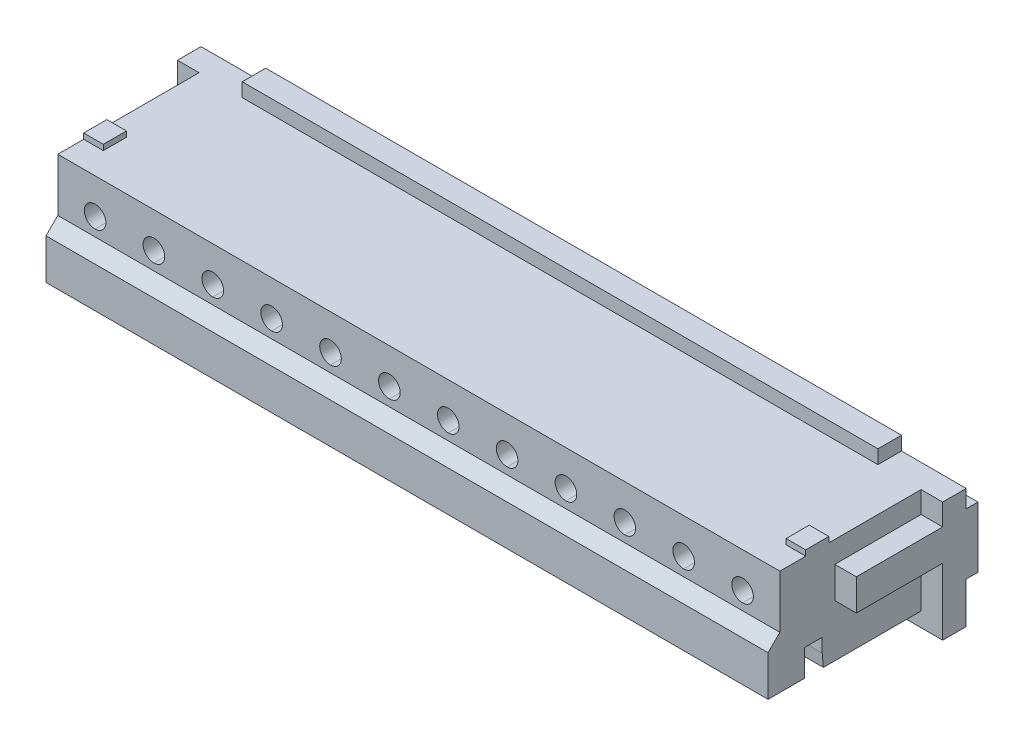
ISO-10303-21;
HEADER;
FILE_DESCRIPTION(('STEP AP214'),'2;1');
FILE_NAME('part.step','',(''),(''),'','','');
FILE_SCHEMA(('AUTOMOTIVE_DESIGN { 1 0 10303 214 1 1 1 1 }'));
ENDSEC;
DATA;
#1=APPLICATION_CONTEXT('core data for automotive mechanical design processes');
#2=APPLICATION_PROTOCOL_DEFINITION('international standard','automotive_design',2000,#1);
#3=PRODUCT_CONTEXT('',#1,'mechanical');
#4=PRODUCT('Part','Part','',(#3));
#5=PRODUCT_RELATED_PRODUCT_CATEGORY('part','',(#4));
#6=PRODUCT_DEFINITION_FORMATION('','',#4);
#7=PRODUCT_DEFINITION_CONTEXT('part definition',#1,'design');
#8=PRODUCT_DEFINITION('design','',#6,#7);
#9=PRODUCT_DEFINITION_SHAPE('','',#8);
#10=(LENGTH_UNIT() NAMED_UNIT(*) SI_UNIT(.MILLI.,.METRE.));
#11=(NAMED_UNIT(*) PLANE_ANGLE_UNIT() SI_UNIT($,.RADIAN.));
#12=(NAMED_UNIT(*) SI_UNIT($,.STERADIAN.) SOLID_ANGLE_UNIT());
#13=UNCERTAINTY_MEASURE_WITH_UNIT(LENGTH_MEASURE(1.E-05),#10,'distance_accuracy_value','');
#14=(GEOMETRIC_REPRESENTATION_CONTEXT(3) GLOBAL_UNCERTAINTY_ASSIGNED_CONTEXT((#13)) GLOBAL_UNIT_ASSIGNED_CONTEXT((#10,
#11,#12)) REPRESENTATION_CONTEXT('',''));
#15=CARTESIAN_POINT('',(0.,0.,0.));
#16=DIRECTION('',(0.,0.,1.));
#17=DIRECTION('',(1.,0.,0.));
#18=AXIS2_PLACEMENT_3D('',#15,#16,#17);
#19=CARTESIAN_POINT('',(1.31,1.45000000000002,-1.35));
#20=DIRECTION('',(0.,-1.,0.));
#21=DIRECTION('',(0.,0.,-1.));
#22=AXIS2_PLACEMENT_3D('',#19,#20,#21);
#23=PLANE('',#22);
#24=DIRECTION('',(0.,0.,-1.));
#25=VECTOR('',#24,1.);
#26=CARTESIAN_POINT('',(0.190000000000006,1.45,-1.35));
#27=LINE('',#26,#25);
#28=CARTESIAN_POINT('',(0.190000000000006,1.45,-1.35));
#29=VERTEX_POINT('',#28);
#30=CARTESIAN_POINT('',(0.190000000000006,1.45,-1.65));
#31=VERTEX_POINT('',#30);
#32=EDGE_CURVE('E1931',#29,#31,#27,.T.);
#33=ORIENTED_EDGE('',*,*,#32,.F.);
#34=DIRECTION('',(-1.,0.,0.));
#35=VECTOR('',#34,1.);
#36=CARTESIAN_POINT('',(1.31,1.45000000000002,-1.35));
#37=LINE('',#36,#35);
#38=CARTESIAN_POINT('',(1.31,1.45000000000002,-1.35));
#39=VERTEX_POINT('',#38);
#40=EDGE_CURVE('E2317',#39,#29,#37,.T.);
#41=ORIENTED_EDGE('',*,*,#40,.F.);
#42=DIRECTION('',(0.,0.,-1.));
#43=VECTOR('',#42,1.);
#44=CARTESIAN_POINT('',(1.31,1.45000000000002,-1.35));
#45=LINE('',#44,#43);
#46=CARTESIAN_POINT('',(1.31,1.45000000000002,-1.65));
#47=VERTEX_POINT('',#46);
#48=EDGE_CURVE('E2478',#39,#47,#45,.T.);
#49=ORIENTED_EDGE('',*,*,#48,.T.);
#50=DIRECTION('',(1.,0.,0.));
#51=VECTOR('',#50,1.);
#52=CARTESIAN_POINT('',(-9.75,1.44999999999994,-1.65));
#53=LINE('',#52,#51);
#54=EDGE_CURVE('E2152',#31,#47,#53,.T.);
#55=ORIENTED_EDGE('',*,*,#54,.F.);
#56=EDGE_LOOP('',(#33,#41,#49,#55));
#57=FACE_BOUND('',#56,.T.);
#58=ADVANCED_FACE('F16',(#57),#23,.F.);
#59=CARTESIAN_POINT('',(-9.75,1.44999999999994,-1.65));
#60=DIRECTION('',(0.,1.,0.));
#61=DIRECTION('',(1.,0.,0.));
#62=AXIS2_PLACEMENT_3D('',#59,#60,#61);
#63=PLANE('',#62);
#64=DIRECTION('',(1.,0.,0.));
#65=VECTOR('',#64,1.);
#66=CARTESIAN_POINT('',(-9.75,1.44999999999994,-1.65));
#67=LINE('',#66,#65);
#68=CARTESIAN_POINT('',(1.69,1.45000000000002,-1.65));
#69=VERTEX_POINT('',#68);
#70=EDGE_CURVE('E2400',#47,#69,#67,.T.);
#71=ORIENTED_EDGE('',*,*,#70,.F.);
#72=DIRECTION('',(0.,0.,-1.));
#73=VECTOR('',#72,1.);
#74=CARTESIAN_POINT('',(1.31,1.45000000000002,-1.35));
#75=LINE('',#74,#73);
#76=CARTESIAN_POINT('',(1.31,1.45000000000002,-1.95));
#77=VERTEX_POINT('',#76);
#78=EDGE_CURVE('E2475',#47,#77,#75,.T.);
#79=ORIENTED_EDGE('',*,*,#78,.T.);
#80=DIRECTION('',(1.,0.,0.));
#81=VECTOR('',#80,1.);
#82=CARTESIAN_POINT('',(-9.75,1.44999999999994,-1.95));
#83=LINE('',#82,#81);
#84=CARTESIAN_POINT('',(1.69,1.45000000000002,-1.95));
#85=VERTEX_POINT('',#84);
#86=EDGE_CURVE('E1705',#77,#85,#83,.T.);
#87=ORIENTED_EDGE('',*,*,#86,.T.);
#88=DIRECTION('',(0.,0.,-1.));
#89=VECTOR('',#88,1.);
#90=CARTESIAN_POINT('',(1.69,1.45000000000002,-1.35));
#91=LINE('',#90,#89);
#92=EDGE_CURVE('E2479',#69,#85,#91,.T.);
#93=ORIENTED_EDGE('',*,*,#92,.F.);
#94=EDGE_LOOP('',(#71,#79,#87,#93));
#95=FACE_BOUND('',#94,.T.);
#96=ADVANCED_FACE('F2725',(#95),#63,.F.);
#97=CARTESIAN_POINT('',(-0.189999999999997,1.45,-1.35));
#98=DIRECTION('',(0.,-1.,0.));
#99=DIRECTION('',(0.,0.,-1.));
#100=AXIS2_PLACEMENT_3D('',#97,#98,#99);
#101=PLANE('',#100);
#102=DIRECTION('',(0.,0.,-1.));
#103=VECTOR('',#102,1.);
#104=CARTESIAN_POINT('',(-1.31,1.45,-1.35));
#105=LINE('',#104,#103);
#106=CARTESIAN_POINT('',(-1.31,1.45,-1.35));
#107=VERTEX_POINT('',#106);
#108=CARTESIAN_POINT('',(-1.31,1.45,-1.65));
#109=VERTEX_POINT('',#108);
#110=EDGE_CURVE('E2348',#107,#109,#105,.T.);
#111=ORIENTED_EDGE('',*,*,#110,.F.);
#112=DIRECTION('',(-1.,0.,0.));
#113=VECTOR('',#112,1.);
#114=CARTESIAN_POINT('',(-0.189999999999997,1.45,-1.35));
#115=LINE('',#114,#113);
#116=CARTESIAN_POINT('',(-0.189999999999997,1.45,-1.35));
#117=VERTEX_POINT('',#116);
#118=EDGE_CURVE('E2365',#117,#107,#115,.T.);
#119=ORIENTED_EDGE('',*,*,#118,.F.);
#120=DIRECTION('',(0.,0.,-1.));
#121=VECTOR('',#120,1.);
#122=CARTESIAN_POINT('',(-0.189999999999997,1.45,-1.35));
#123=LINE('',#122,#121);
#124=CARTESIAN_POINT('',(-0.189999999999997,1.45,-1.65));
#125=VERTEX_POINT('',#124);
#126=EDGE_CURVE('E1709',#117,#125,#123,.T.);
#127=ORIENTED_EDGE('',*,*,#126,.T.);
#128=DIRECTION('',(1.,0.,0.));
#129=VECTOR('',#128,1.);
#130=CARTESIAN_POINT('',(-9.75,1.44999999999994,-1.65));
#131=LINE('',#130,#129);
#132=EDGE_CURVE('E2153',#109,#125,#131,.T.);
#133=ORIENTED_EDGE('',*,*,#132,.F.);
#134=EDGE_LOOP('',(#111,#119,#127,#133));
#135=FACE_BOUND('',#134,.T.);
#136=ADVANCED_FACE('F2915',(#135),#101,.F.);
#137=CARTESIAN_POINT('',(-9.75,1.44999999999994,-1.65));
#138=DIRECTION('',(0.,1.,0.));
#139=DIRECTION('',(1.,0.,0.));
#140=AXIS2_PLACEMENT_3D('',#137,#138,#139);
#141=PLANE('',#140);
#142=DIRECTION('',(1.,0.,0.));
#143=VECTOR('',#142,1.);
#144=CARTESIAN_POINT('',(-9.75,1.44999999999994,-1.65));
#145=LINE('',#144,#143);
#146=CARTESIAN_POINT('',(-4.69,1.44999999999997,-1.65));
#147=VERTEX_POINT('',#146);
#148=CARTESIAN_POINT('',(-4.31,1.44999999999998,-1.65));
#149=VERTEX_POINT('',#148);
#150=EDGE_CURVE('E1603',#147,#149,#145,.T.);
#151=ORIENTED_EDGE('',*,*,#150,.F.);
#152=DIRECTION('',(0.,0.,-1.));
#153=VECTOR('',#152,1.);
#154=CARTESIAN_POINT('',(-4.69,1.44999999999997,-1.35));
#155=LINE('',#154,#153);
#156=CARTESIAN_POINT('',(-4.69,1.44999999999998,-1.95));
#157=VERTEX_POINT('',#156);
#158=EDGE_CURVE('E1810',#147,#157,#155,.T.);
#159=ORIENTED_EDGE('',*,*,#158,.T.);
#160=DIRECTION('',(1.,0.,0.));
#161=VECTOR('',#160,1.);
#162=CARTESIAN_POINT('',(-9.75,1.44999999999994,-1.95));
#163=LINE('',#162,#161);
#164=CARTESIAN_POINT('',(-4.31,1.44999999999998,-1.95));
#165=VERTEX_POINT('',#164);
#166=EDGE_CURVE('E2657',#157,#165,#163,.T.);
#167=ORIENTED_EDGE('',*,*,#166,.T.);
#168=DIRECTION('',(0.,0.,-1.));
#169=VECTOR('',#168,1.);
#170=CARTESIAN_POINT('',(-4.31,1.44999999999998,-1.35));
#171=LINE('',#170,#169);
#172=EDGE_CURVE('E2653',#149,#165,#171,.T.);
#173=ORIENTED_EDGE('',*,*,#172,.F.);
#174=EDGE_LOOP('',(#151,#159,#167,#173));
#175=FACE_BOUND('',#174,.T.);
#176=ADVANCED_FACE('F2880',(#175),#141,.F.);
#177=CARTESIAN_POINT('',(-9.75,1.44999999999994,-1.65));
#178=DIRECTION('',(0.,1.,0.));
#179=DIRECTION('',(1.,0.,0.));
#180=AXIS2_PLACEMENT_3D('',#177,#178,#179);
#181=PLANE('',#180);
#182=DIRECTION('',(1.,0.,0.));
#183=VECTOR('',#182,1.);
#184=CARTESIAN_POINT('',(-9.75,1.44999999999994,-1.65));
#185=LINE('',#184,#183);
#186=CARTESIAN_POINT('',(-3.19,1.44999999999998,-1.65));
#187=VERTEX_POINT('',#186);
#188=CARTESIAN_POINT('',(-2.81,1.44999999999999,-1.65));
#189=VERTEX_POINT('',#188);
#190=EDGE_CURVE('E2382',#187,#189,#185,.T.);
#191=ORIENTED_EDGE('',*,*,#190,.F.);
#192=DIRECTION('',(0.,0.,-1.));
#193=VECTOR('',#192,1.);
#194=CARTESIAN_POINT('',(-3.19,1.44999999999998,-1.35));
#195=LINE('',#194,#193);
#196=CARTESIAN_POINT('',(-3.19,1.44999999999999,-1.95));
#197=VERTEX_POINT('',#196);
#198=EDGE_CURVE('E1481',#187,#197,#195,.T.);
#199=ORIENTED_EDGE('',*,*,#198,.T.);
#200=DIRECTION('',(1.,0.,0.));
#201=VECTOR('',#200,1.);
#202=CARTESIAN_POINT('',(-9.75,1.44999999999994,-1.95));
#203=LINE('',#202,#201);
#204=CARTESIAN_POINT('',(-2.81,1.45,-1.95));
#205=VERTEX_POINT('',#204);
#206=EDGE_CURVE('E1336',#197,#205,#203,.T.);
#207=ORIENTED_EDGE('',*,*,#206,.T.);
#208=DIRECTION('',(0.,0.,-1.));
#209=VECTOR('',#208,1.);
#210=CARTESIAN_POINT('',(-2.81,1.44999999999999,-1.35));
#211=LINE('',#210,#209);
#212=EDGE_CURVE('E1340',#189,#205,#211,.T.);
#213=ORIENTED_EDGE('',*,*,#212,.F.);
#214=EDGE_LOOP('',(#191,#199,#207,#213));
#215=FACE_BOUND('',#214,.T.);
#216=ADVANCED_FACE('F2895',(#215),#181,.F.);
#217=CARTESIAN_POINT('',(-9.75,1.44999999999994,-1.65));
#218=DIRECTION('',(0.,1.,0.));
#219=DIRECTION('',(1.,0.,0.));
#220=AXIS2_PLACEMENT_3D('',#217,#218,#219);
#221=PLANE('',#220);
#222=DIRECTION('',(1.,0.,0.));
#223=VECTOR('',#222,1.);
#224=CARTESIAN_POINT('',(-9.75,1.44999999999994,-1.65));
#225=LINE('',#224,#223);
#226=EDGE_CURVE('E2148',#125,#31,#225,.T.);
#227=ORIENTED_EDGE('',*,*,#226,.F.);
#228=DIRECTION('',(0.,0.,-1.));
#229=VECTOR('',#228,1.);
#230=CARTESIAN_POINT('',(-0.189999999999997,1.45,-1.35));
#231=LINE('',#230,#229);
#232=CARTESIAN_POINT('',(-0.189999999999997,1.45,-1.95));
#233=VERTEX_POINT('',#232);
#234=EDGE_CURVE('E1786',#125,#233,#231,.T.);
#235=ORIENTED_EDGE('',*,*,#234,.T.);
#236=DIRECTION('',(1.,0.,0.));
#237=VECTOR('',#236,1.);
#238=CARTESIAN_POINT('',(-9.75,1.44999999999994,-1.95));
#239=LINE('',#238,#237);
#240=CARTESIAN_POINT('',(0.190000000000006,1.45,-1.95));
#241=VERTEX_POINT('',#240);
#242=EDGE_CURVE('E1576',#233,#241,#239,.T.);
#243=ORIENTED_EDGE('',*,*,#242,.T.);
#244=DIRECTION('',(0.,0.,-1.));
#245=VECTOR('',#244,1.);
#246=CARTESIAN_POINT('',(0.190000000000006,1.45,-1.35));
#247=LINE('',#246,#245);
#248=EDGE_CURVE('E1580',#31,#241,#247,.T.);
#249=ORIENTED_EDGE('',*,*,#248,.F.);
#250=EDGE_LOOP('',(#227,#235,#243,#249));
#251=FACE_BOUND('',#250,.T.);
#252=ADVANCED_FACE('F2731',(#251),#221,.F.);
#253=CARTESIAN_POINT('',(5.81,1.45000000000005,-1.35));
#254=DIRECTION('',(0.,-1.,0.));
#255=DIRECTION('',(0.,0.,-1.));
#256=AXIS2_PLACEMENT_3D('',#253,#254,#255);
#257=PLANE('',#256);
#258=DIRECTION('',(0.,0.,-1.));
#259=VECTOR('',#258,1.);
#260=CARTESIAN_POINT('',(4.69,1.45000000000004,-1.35));
#261=LINE('',#260,#259);
#262=CARTESIAN_POINT('',(4.69,1.45000000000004,-1.35));
#263=VERTEX_POINT('',#262);
#264=CARTESIAN_POINT('',(4.69,1.45000000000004,-1.65));
#265=VERTEX_POINT('',#264);
#266=EDGE_CURVE('E2540',#263,#265,#261,.T.);
#267=ORIENTED_EDGE('',*,*,#266,.F.);
#268=DIRECTION('',(-1.,0.,0.));
#269=VECTOR('',#268,1.);
#270=CARTESIAN_POINT('',(5.81,1.45000000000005,-1.35));
#271=LINE('',#270,#269);
#272=CARTESIAN_POINT('',(5.81,1.45000000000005,-1.35));
#273=VERTEX_POINT('',#272);
#274=EDGE_CURVE('E2023',#273,#263,#271,.T.);
#275=ORIENTED_EDGE('',*,*,#274,.F.);
#276=DIRECTION('',(0.,0.,-1.));
#277=VECTOR('',#276,1.);
#278=CARTESIAN_POINT('',(5.81,1.45000000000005,-1.35));
#279=LINE('',#278,#277);
#280=CARTESIAN_POINT('',(5.81,1.45000000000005,-1.65));
#281=VERTEX_POINT('',#280);
#282=EDGE_CURVE('E2466',#273,#281,#279,.T.);
#283=ORIENTED_EDGE('',*,*,#282,.T.);
#284=DIRECTION('',(1.,0.,0.));
#285=VECTOR('',#284,1.);
#286=CARTESIAN_POINT('',(-9.75,1.44999999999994,-1.65));
#287=LINE('',#286,#285);
#288=EDGE_CURVE('E2420',#265,#281,#287,.T.);
#289=ORIENTED_EDGE('',*,*,#288,.F.);
#290=EDGE_LOOP('',(#267,#275,#283,#289));
#291=FACE_BOUND('',#290,.T.);
#292=ADVANCED_FACE('F2780',(#291),#257,.F.);
#293=CARTESIAN_POINT('',(-4.69,1.44999999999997,-1.35));
#294=DIRECTION('',(0.,-1.,0.));
#295=DIRECTION('',(0.,0.,-1.));
#296=AXIS2_PLACEMENT_3D('',#293,#294,#295);
#297=PLANE('',#296);
#298=DIRECTION('',(0.,0.,-1.));
#299=VECTOR('',#298,1.);
#300=CARTESIAN_POINT('',(-5.81,1.44999999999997,-1.35));
#301=LINE('',#300,#299);
#302=CARTESIAN_POINT('',(-5.81,1.44999999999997,-1.35));
#303=VERTEX_POINT('',#302);
#304=CARTESIAN_POINT('',(-5.81,1.44999999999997,-1.65));
#305=VERTEX_POINT('',#304);
#306=EDGE_CURVE('E1726',#303,#305,#301,.T.);
#307=ORIENTED_EDGE('',*,*,#306,.F.);
#308=DIRECTION('',(-1.,0.,0.));
#309=VECTOR('',#308,1.);
#310=CARTESIAN_POINT('',(-4.69,1.44999999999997,-1.35));
#311=LINE('',#310,#309);
#312=CARTESIAN_POINT('',(-4.69,1.44999999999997,-1.35));
#313=VERTEX_POINT('',#312);
#314=EDGE_CURVE('E1725',#313,#303,#311,.T.);
#315=ORIENTED_EDGE('',*,*,#314,.F.);
#316=DIRECTION('',(0.,0.,-1.));
#317=VECTOR('',#316,1.);
#318=CARTESIAN_POINT('',(-4.69,1.44999999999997,-1.35));
#319=LINE('',#318,#317);
#320=EDGE_CURVE('E1806',#313,#147,#319,.T.);
#321=ORIENTED_EDGE('',*,*,#320,.T.);
#322=DIRECTION('',(1.,0.,0.));
#323=VECTOR('',#322,1.);
#324=CARTESIAN_POINT('',(-9.75,1.44999999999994,-1.65));
#325=LINE('',#324,#323);
#326=EDGE_CURVE('E1599',#305,#147,#325,.T.);
#327=ORIENTED_EDGE('',*,*,#326,.F.);
#328=EDGE_LOOP('',(#307,#315,#321,#327));
#329=FACE_BOUND('',#328,.T.);
#330=ADVANCED_FACE('F2874',(#329),#297,.F.);
#331=CARTESIAN_POINT('',(-3.19,1.44999999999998,-1.35));
#332=DIRECTION('',(0.,-1.,0.));
#333=DIRECTION('',(0.,0.,-1.));
#334=AXIS2_PLACEMENT_3D('',#331,#332,#333);
#335=PLANE('',#334);
#336=DIRECTION('',(0.,0.,-1.));
#337=VECTOR('',#336,1.);
#338=CARTESIAN_POINT('',(-4.31,1.44999999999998,-1.35));
#339=LINE('',#338,#337);
#340=CARTESIAN_POINT('',(-4.31,1.44999999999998,-1.35));
#341=VERTEX_POINT('',#340);
#342=EDGE_CURVE('E2647',#341,#149,#339,.T.);
#343=ORIENTED_EDGE('',*,*,#342,.F.);
#344=DIRECTION('',(-1.,0.,0.));
#345=VECTOR('',#344,1.);
#346=CARTESIAN_POINT('',(-3.19,1.44999999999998,-1.35));
#347=LINE('',#346,#345);
#348=CARTESIAN_POINT('',(-3.19,1.44999999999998,-1.35));
#349=VERTEX_POINT('',#348);
#350=EDGE_CURVE('E1482',#349,#341,#347,.T.);
#351=ORIENTED_EDGE('',*,*,#350,.F.);
#352=DIRECTION('',(0.,0.,-1.));
#353=VECTOR('',#352,1.);
#354=CARTESIAN_POINT('',(-3.19,1.44999999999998,-1.35));
#355=LINE('',#354,#353);
#356=EDGE_CURVE('E1636',#349,#187,#355,.T.);
#357=ORIENTED_EDGE('',*,*,#356,.T.);
#358=DIRECTION('',(1.,0.,0.));
#359=VECTOR('',#358,1.);
#360=CARTESIAN_POINT('',(-9.75,1.44999999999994,-1.65));
#361=LINE('',#360,#359);
#362=EDGE_CURVE('E2378',#149,#187,#361,.T.);
#363=ORIENTED_EDGE('',*,*,#362,.F.);
#364=EDGE_LOOP('',(#343,#351,#357,#363));
#365=FACE_BOUND('',#364,.T.);
#366=ADVANCED_FACE('F2889',(#365),#335,.F.);
#367=CARTESIAN_POINT('',(8.81,1.45000000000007,-1.35));
#368=DIRECTION('',(0.,-1.,0.));
#369=DIRECTION('',(0.,0.,-1.));
#370=AXIS2_PLACEMENT_3D('',#367,#368,#369);
#371=PLANE('',#370);
#372=DIRECTION('',(0.,0.,-1.));
#373=VECTOR('',#372,1.);
#374=CARTESIAN_POINT('',(7.69,1.45000000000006,-1.35));
#375=LINE('',#374,#373);
#376=CARTESIAN_POINT('',(7.69,1.45000000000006,-1.35));
#377=VERTEX_POINT('',#376);
#378=CARTESIAN_POINT('',(7.69,1.45000000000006,-1.65));
#379=VERTEX_POINT('',#378);
#380=EDGE_CURVE('E2421',#377,#379,#375,.T.);
#381=ORIENTED_EDGE('',*,*,#380,.F.);
#382=DIRECTION('',(-1.,0.,0.));
#383=VECTOR('',#382,1.);
#384=CARTESIAN_POINT('',(8.81,1.45000000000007,-1.35));
#385=LINE('',#384,#383);
#386=CARTESIAN_POINT('',(8.81,1.45000000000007,-1.35));
#387=VERTEX_POINT('',#386);
#388=EDGE_CURVE('E1742',#387,#377,#385,.T.);
#389=ORIENTED_EDGE('',*,*,#388,.F.);
#390=DIRECTION('',(0.,0.,-1.));
#391=VECTOR('',#390,1.);
#392=CARTESIAN_POINT('',(8.81,1.45000000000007,-1.35));
#393=LINE('',#392,#391);
#394=CARTESIAN_POINT('',(8.81,1.45000000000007,-1.65));
#395=VERTEX_POINT('',#394);
#396=EDGE_CURVE('E37',#387,#395,#393,.T.);
#397=ORIENTED_EDGE('',*,*,#396,.T.);
#398=DIRECTION('',(1.,0.,0.));
#399=VECTOR('',#398,1.);
#400=CARTESIAN_POINT('',(-9.75,1.44999999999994,-1.65));
#401=LINE('',#400,#399);
#402=EDGE_CURVE('E2446',#379,#395,#401,.T.);
#403=ORIENTED_EDGE('',*,*,#402,.F.);
#404=EDGE_LOOP('',(#381,#389,#397,#403));
#405=FACE_BOUND('',#404,.T.);
#406=ADVANCED_FACE('F2810',(#405),#371,.F.);
#407=CARTESIAN_POINT('',(-9.75,1.44999999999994,-1.65));
#408=DIRECTION('',(0.,1.,0.));
#409=DIRECTION('',(1.,0.,0.));
#410=AXIS2_PLACEMENT_3D('',#407,#408,#409);
#411=PLANE('',#410);
#412=DIRECTION('',(1.,0.,0.));
#413=VECTOR('',#412,1.);
#414=CARTESIAN_POINT('',(-9.75,1.44999999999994,-1.65));
#415=LINE('',#414,#413);
#416=CARTESIAN_POINT('',(-6.19,1.44999999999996,-1.65));
#417=VERTEX_POINT('',#416);
#418=EDGE_CURVE('E1604',#417,#305,#415,.T.);
#419=ORIENTED_EDGE('',*,*,#418,.F.);
#420=DIRECTION('',(0.,0.,-1.));
#421=VECTOR('',#420,1.);
#422=CARTESIAN_POINT('',(-6.19,1.44999999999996,-1.35));
#423=LINE('',#422,#421);
#424=CARTESIAN_POINT('',(-6.19,1.44999999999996,-1.95));
#425=VERTEX_POINT('',#424);
#426=EDGE_CURVE('E1420',#417,#425,#423,.T.);
#427=ORIENTED_EDGE('',*,*,#426,.T.);
#428=DIRECTION('',(1.,0.,0.));
#429=VECTOR('',#428,1.);
#430=CARTESIAN_POINT('',(-9.75,1.44999999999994,-1.95));
#431=LINE('',#430,#429);
#432=CARTESIAN_POINT('',(-5.81,1.44999999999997,-1.95));
#433=VERTEX_POINT('',#432);
#434=EDGE_CURVE('E2624',#425,#433,#431,.T.);
#435=ORIENTED_EDGE('',*,*,#434,.T.);
#436=DIRECTION('',(0.,0.,-1.));
#437=VECTOR('',#436,1.);
#438=CARTESIAN_POINT('',(-5.81,1.44999999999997,-1.35));
#439=LINE('',#438,#437);
#440=EDGE_CURVE('E1721',#305,#433,#439,.T.);
#441=ORIENTED_EDGE('',*,*,#440,.F.);
#442=EDGE_LOOP('',(#419,#427,#435,#441));
#443=FACE_BOUND('',#442,.T.);
#444=ADVANCED_FACE('F2865',(#443),#411,.F.);
#445=CARTESIAN_POINT('',(2.81,1.45000000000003,-1.35));
#446=DIRECTION('',(0.,-1.,0.));
#447=DIRECTION('',(0.,0.,-1.));
#448=AXIS2_PLACEMENT_3D('',#445,#446,#447);
#449=PLANE('',#448);
#450=DIRECTION('',(0.,0.,-1.));
#451=VECTOR('',#450,1.);
#452=CARTESIAN_POINT('',(1.69,1.45000000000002,-1.35));
#453=LINE('',#452,#451);
#454=CARTESIAN_POINT('',(1.69,1.45000000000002,-1.35));
#455=VERTEX_POINT('',#454);
#456=EDGE_CURVE('E1893',#455,#69,#453,.T.);
#457=ORIENTED_EDGE('',*,*,#456,.F.);
#458=DIRECTION('',(-1.,0.,0.));
#459=VECTOR('',#458,1.);
#460=CARTESIAN_POINT('',(2.81,1.45000000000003,-1.35));
#461=LINE('',#460,#459);
#462=CARTESIAN_POINT('',(2.81,1.45000000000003,-1.35));
#463=VERTEX_POINT('',#462);
#464=EDGE_CURVE('E2585',#463,#455,#461,.T.);
#465=ORIENTED_EDGE('',*,*,#464,.F.);
#466=DIRECTION('',(0.,0.,-1.));
#467=VECTOR('',#466,1.);
#468=CARTESIAN_POINT('',(2.81,1.45000000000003,-1.35));
#469=LINE('',#468,#467);
#470=CARTESIAN_POINT('',(2.81,1.45000000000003,-1.65));
#471=VERTEX_POINT('',#470);
#472=EDGE_CURVE('E1152',#463,#471,#469,.T.);
#473=ORIENTED_EDGE('',*,*,#472,.T.);
#474=DIRECTION('',(1.,0.,0.));
#475=VECTOR('',#474,1.);
#476=CARTESIAN_POINT('',(-9.75,1.44999999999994,-1.65));
#477=LINE('',#476,#475);
#478=EDGE_CURVE('E2404',#69,#471,#477,.T.);
#479=ORIENTED_EDGE('',*,*,#478,.F.);
#480=EDGE_LOOP('',(#457,#465,#473,#479));
#481=FACE_BOUND('',#480,.T.);
#482=ADVANCED_FACE('F2756',(#481),#449,.F.);
#483=CARTESIAN_POINT('',(-6.19,1.44999999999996,-1.35));
#484=DIRECTION('',(0.,-1.,0.));
#485=DIRECTION('',(0.,0.,-1.));
#486=AXIS2_PLACEMENT_3D('',#483,#484,#485);
#487=PLANE('',#486);
#488=DIRECTION('',(0.,0.,-1.));
#489=VECTOR('',#488,1.);
#490=CARTESIAN_POINT('',(-7.31,1.44999999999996,-1.35));
#491=LINE('',#490,#489);
#492=CARTESIAN_POINT('',(-7.31,1.44999999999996,-1.35));
#493=VERTEX_POINT('',#492);
#494=CARTESIAN_POINT('',(-7.31,1.44999999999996,-1.65));
#495=VERTEX_POINT('',#494);
#496=EDGE_CURVE('E2338',#493,#495,#491,.T.);
#497=ORIENTED_EDGE('',*,*,#496,.F.);
#498=DIRECTION('',(-1.,0.,0.));
#499=VECTOR('',#498,1.);
#500=CARTESIAN_POINT('',(-6.19,1.44999999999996,-1.35));
#501=LINE('',#500,#499);
#502=CARTESIAN_POINT('',(-6.19,1.44999999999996,-1.35));
#503=VERTEX_POINT('',#502);
#504=EDGE_CURVE('E24',#503,#493,#501,.T.);
#505=ORIENTED_EDGE('',*,*,#504,.F.);
#506=DIRECTION('',(0.,0.,-1.));
#507=VECTOR('',#506,1.);
#508=CARTESIAN_POINT('',(-6.19,1.44999999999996,-1.35));
#509=LINE('',#508,#507);
#510=EDGE_CURVE('E1416',#503,#417,#509,.T.);
#511=ORIENTED_EDGE('',*,*,#510,.T.);
#512=DIRECTION('',(1.,0.,0.));
#513=VECTOR('',#512,1.);
#514=CARTESIAN_POINT('',(-9.75,1.44999999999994,-1.65));
#515=LINE('',#514,#513);
#516=EDGE_CURVE('E1965',#495,#417,#515,.T.);
#517=ORIENTED_EDGE('',*,*,#516,.F.);
#518=EDGE_LOOP('',(#497,#505,#511,#517));
#519=FACE_BOUND('',#518,.T.);
#520=ADVANCED_FACE('F2858',(#519),#487,.F.);
#521=CARTESIAN_POINT('',(-9.75,1.44999999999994,-1.65));
#522=DIRECTION('',(0.,1.,0.));
#523=DIRECTION('',(1.,0.,0.));
#524=AXIS2_PLACEMENT_3D('',#521,#522,#523);
#525=PLANE('',#524);
#526=DIRECTION('',(1.,0.,0.));
#527=VECTOR('',#526,1.);
#528=CARTESIAN_POINT('',(-9.75,1.44999999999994,-1.65));
#529=LINE('',#528,#527);
#530=CARTESIAN_POINT('',(-1.69,1.45,-1.65));
#531=VERTEX_POINT('',#530);
#532=EDGE_CURVE('E2390',#531,#109,#529,.T.);
#533=ORIENTED_EDGE('',*,*,#532,.F.);
#534=DIRECTION('',(0.,0.,-1.));
#535=VECTOR('',#534,1.);
#536=CARTESIAN_POINT('',(-1.69,1.45,-1.35));
#537=LINE('',#536,#535);
#538=CARTESIAN_POINT('',(-1.69,1.45,-1.95));
#539=VERTEX_POINT('',#538);
#540=EDGE_CURVE('E2509',#531,#539,#537,.T.);
#541=ORIENTED_EDGE('',*,*,#540,.T.);
#542=DIRECTION('',(1.,0.,0.));
#543=VECTOR('',#542,1.);
#544=CARTESIAN_POINT('',(-9.75,1.44999999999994,-1.95));
#545=LINE('',#544,#543);
#546=CARTESIAN_POINT('',(-1.31,1.45,-1.95));
#547=VERTEX_POINT('',#546);
#548=EDGE_CURVE('E1624',#539,#547,#545,.T.);
#549=ORIENTED_EDGE('',*,*,#548,.T.);
#550=DIRECTION('',(0.,0.,-1.));
#551=VECTOR('',#550,1.);
#552=CARTESIAN_POINT('',(-1.31,1.45,-1.35));
#553=LINE('',#552,#551);
#554=EDGE_CURVE('E2343',#109,#547,#553,.T.);
#555=ORIENTED_EDGE('',*,*,#554,.F.);
#556=EDGE_LOOP('',(#533,#541,#549,#555));
#557=FACE_BOUND('',#556,.T.);
#558=ADVANCED_FACE('F2906',(#557),#525,.F.);
#559=CARTESIAN_POINT('',(-1.69,1.45,-1.35));
#560=DIRECTION('',(0.,-1.,0.));
#561=DIRECTION('',(0.,0.,-1.));
#562=AXIS2_PLACEMENT_3D('',#559,#560,#561);
#563=PLANE('',#562);
#564=DIRECTION('',(0.,0.,-1.));
#565=VECTOR('',#564,1.);
#566=CARTESIAN_POINT('',(-2.81,1.44999999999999,-1.35));
#567=LINE('',#566,#565);
#568=CARTESIAN_POINT('',(-2.81,1.44999999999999,-1.35));
#569=VERTEX_POINT('',#568);
#570=EDGE_CURVE('E1950',#569,#189,#567,.T.);
#571=ORIENTED_EDGE('',*,*,#570,.F.);
#572=DIRECTION('',(-1.,0.,0.));
#573=VECTOR('',#572,1.);
#574=CARTESIAN_POINT('',(-1.69,1.45,-1.35));
#575=LINE('',#574,#573);
#576=CARTESIAN_POINT('',(-1.69,1.45,-1.35));
#577=VERTEX_POINT('',#576);
#578=EDGE_CURVE('E10',#577,#569,#575,.T.);
#579=ORIENTED_EDGE('',*,*,#578,.F.);
#580=DIRECTION('',(0.,0.,-1.));
#581=VECTOR('',#580,1.);
#582=CARTESIAN_POINT('',(-1.69,1.45,-1.35));
#583=LINE('',#582,#581);
#584=EDGE_CURVE('E1625',#577,#531,#583,.T.);
#585=ORIENTED_EDGE('',*,*,#584,.T.);
#586=DIRECTION('',(1.,0.,0.));
#587=VECTOR('',#586,1.);
#588=CARTESIAN_POINT('',(-9.75,1.44999999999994,-1.65));
#589=LINE('',#588,#587);
#590=EDGE_CURVE('E2386',#189,#531,#589,.T.);
#591=ORIENTED_EDGE('',*,*,#590,.F.);
#592=EDGE_LOOP('',(#571,#579,#585,#591));
#593=FACE_BOUND('',#592,.T.);
#594=ADVANCED_FACE('F2899',(#593),#563,.F.);
#595=CARTESIAN_POINT('',(-9.75,1.44999999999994,-1.65));
#596=DIRECTION('',(0.,1.,0.));
#597=DIRECTION('',(1.,0.,0.));
#598=AXIS2_PLACEMENT_3D('',#595,#596,#597);
#599=PLANE('',#598);
#600=DIRECTION('',(1.,0.,0.));
#601=VECTOR('',#600,1.);
#602=CARTESIAN_POINT('',(-9.75,1.44999999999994,-1.65));
#603=LINE('',#602,#601);
#604=CARTESIAN_POINT('',(6.19,1.45000000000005,-1.65));
#605=VERTEX_POINT('',#604);
#606=EDGE_CURVE('E2429',#281,#605,#603,.T.);
#607=ORIENTED_EDGE('',*,*,#606,.F.);
#608=DIRECTION('',(0.,0.,-1.));
#609=VECTOR('',#608,1.);
#610=CARTESIAN_POINT('',(5.81,1.45000000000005,-1.35));
#611=LINE('',#610,#609);
#612=CARTESIAN_POINT('',(5.81,1.45000000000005,-1.95));
#613=VERTEX_POINT('',#612);
#614=EDGE_CURVE('E2462',#281,#613,#611,.T.);
#615=ORIENTED_EDGE('',*,*,#614,.T.);
#616=DIRECTION('',(1.,0.,0.));
#617=VECTOR('',#616,1.);
#618=CARTESIAN_POINT('',(-9.75,1.44999999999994,-1.95));
#619=LINE('',#618,#617);
#620=CARTESIAN_POINT('',(6.19,1.45000000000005,-1.95));
#621=VERTEX_POINT('',#620);
#622=EDGE_CURVE('E2491',#613,#621,#619,.T.);
#623=ORIENTED_EDGE('',*,*,#622,.T.);
#624=DIRECTION('',(0.,0.,-1.));
#625=VECTOR('',#624,1.);
#626=CARTESIAN_POINT('',(6.19,1.45000000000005,-1.35));
#627=LINE('',#626,#625);
#628=EDGE_CURVE('E2299',#605,#621,#627,.T.);
#629=ORIENTED_EDGE('',*,*,#628,.F.);
#630=EDGE_LOOP('',(#607,#615,#623,#629));
#631=FACE_BOUND('',#630,.T.);
#632=ADVANCED_FACE('F2787',(#631),#599,.F.);
#633=CARTESIAN_POINT('',(-7.69,1.44999999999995,-1.35));
#634=DIRECTION('',(0.,-1.,0.));
#635=DIRECTION('',(0.,0.,-1.));
#636=AXIS2_PLACEMENT_3D('',#633,#634,#635);
#637=PLANE('',#636);
#638=DIRECTION('',(0.,0.,-1.));
#639=VECTOR('',#638,1.);
#640=CARTESIAN_POINT('',(-8.81,1.44999999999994,-1.35));
#641=LINE('',#640,#639);
#642=CARTESIAN_POINT('',(-8.81,1.44999999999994,-1.35));
#643=VERTEX_POINT('',#642);
#644=CARTESIAN_POINT('',(-8.81,1.44999999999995,-1.65));
#645=VERTEX_POINT('',#644);
#646=EDGE_CURVE('E2634',#643,#645,#641,.T.);
#647=ORIENTED_EDGE('',*,*,#646,.F.);
#648=DIRECTION('',(-1.,0.,0.));
#649=VECTOR('',#648,1.);
#650=CARTESIAN_POINT('',(-7.69,1.44999999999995,-1.35));
#651=LINE('',#650,#649);
#652=CARTESIAN_POINT('',(-7.69,1.44999999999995,-1.35));
#653=VERTEX_POINT('',#652);
#654=EDGE_CURVE('E2627',#653,#643,#651,.T.);
#655=ORIENTED_EDGE('',*,*,#654,.F.);
#656=DIRECTION('',(0.,0.,-1.));
#657=VECTOR('',#656,1.);
#658=CARTESIAN_POINT('',(-7.69,1.44999999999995,-1.35));
#659=LINE('',#658,#657);
#660=CARTESIAN_POINT('',(-7.69,1.44999999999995,-1.65));
#661=VERTEX_POINT('',#660);
#662=EDGE_CURVE('E2430',#653,#661,#659,.T.);
#663=ORIENTED_EDGE('',*,*,#662,.T.);
#664=DIRECTION('',(1.,0.,0.));
#665=VECTOR('',#664,1.);
#666=CARTESIAN_POINT('',(-9.75,1.44999999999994,-1.65));
#667=LINE('',#666,#665);
#668=EDGE_CURVE('E1966',#645,#661,#667,.T.);
#669=ORIENTED_EDGE('',*,*,#668,.F.);
#670=EDGE_LOOP('',(#647,#655,#663,#669));
#671=FACE_BOUND('',#670,.T.);
#672=ADVANCED_FACE('F2845',(#671),#637,.F.);
#673=CARTESIAN_POINT('',(-9.75,1.44999999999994,-1.65));
#674=DIRECTION('',(0.,1.,0.));
#675=DIRECTION('',(1.,0.,0.));
#676=AXIS2_PLACEMENT_3D('',#673,#674,#675);
#677=PLANE('',#676);
#678=DIRECTION('',(1.,0.,0.));
#679=VECTOR('',#678,1.);
#680=CARTESIAN_POINT('',(-9.75,1.44999999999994,-1.65));
#681=LINE('',#680,#679);
#682=EDGE_CURVE('E1961',#661,#495,#681,.T.);
#683=ORIENTED_EDGE('',*,*,#682,.F.);
#684=DIRECTION('',(0.,0.,-1.));
#685=VECTOR('',#684,1.);
#686=CARTESIAN_POINT('',(-7.69,1.44999999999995,-1.35));
#687=LINE('',#686,#685);
#688=CARTESIAN_POINT('',(-7.69,1.44999999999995,-1.95));
#689=VERTEX_POINT('',#688);
#690=EDGE_CURVE('E2434',#661,#689,#687,.T.);
#691=ORIENTED_EDGE('',*,*,#690,.T.);
#692=DIRECTION('',(1.,0.,0.));
#693=VECTOR('',#692,1.);
#694=CARTESIAN_POINT('',(-9.75,1.44999999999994,-1.95));
#695=LINE('',#694,#693);
#696=CARTESIAN_POINT('',(-7.31,1.44999999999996,-1.95));
#697=VERTEX_POINT('',#696);
#698=EDGE_CURVE('E2337',#689,#697,#695,.T.);
#699=ORIENTED_EDGE('',*,*,#698,.T.);
#700=DIRECTION('',(0.,0.,-1.));
#701=VECTOR('',#700,1.);
#702=CARTESIAN_POINT('',(-7.31,1.44999999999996,-1.35));
#703=LINE('',#702,#701);
#704=EDGE_CURVE('E2333',#495,#697,#703,.T.);
#705=ORIENTED_EDGE('',*,*,#704,.F.);
#706=EDGE_LOOP('',(#683,#691,#699,#705));
#707=FACE_BOUND('',#706,.T.);
#708=ADVANCED_FACE('F2853',(#707),#677,.F.);
#709=CARTESIAN_POINT('',(4.31,1.45000000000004,-1.35));
#710=DIRECTION('',(0.,-1.,0.));
#711=DIRECTION('',(0.,0.,-1.));
#712=AXIS2_PLACEMENT_3D('',#709,#710,#711);
#713=PLANE('',#712);
#714=DIRECTION('',(0.,0.,-1.));
#715=VECTOR('',#714,1.);
#716=CARTESIAN_POINT('',(3.19,1.45000000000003,-1.35));
#717=LINE('',#716,#715);
#718=CARTESIAN_POINT('',(3.19,1.45000000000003,-1.35));
#719=VERTEX_POINT('',#718);
#720=CARTESIAN_POINT('',(3.19,1.45000000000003,-1.65));
#721=VERTEX_POINT('',#720);
#722=EDGE_CURVE('E1546',#719,#721,#717,.T.);
#723=ORIENTED_EDGE('',*,*,#722,.F.);
#724=DIRECTION('',(-1.,0.,0.));
#725=VECTOR('',#724,1.);
#726=CARTESIAN_POINT('',(4.31,1.45000000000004,-1.35));
#727=LINE('',#726,#725);
#728=CARTESIAN_POINT('',(4.31,1.45000000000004,-1.35));
#729=VERTEX_POINT('',#728);
#730=EDGE_CURVE('E1772',#729,#719,#727,.T.);
#731=ORIENTED_EDGE('',*,*,#730,.F.);
#732=DIRECTION('',(0.,0.,-1.));
#733=VECTOR('',#732,1.);
#734=CARTESIAN_POINT('',(4.31,1.45000000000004,-1.35));
#735=LINE('',#734,#733);
#736=CARTESIAN_POINT('',(4.31,1.45000000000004,-1.65));
#737=VERTEX_POINT('',#736);
#738=EDGE_CURVE('E2474',#729,#737,#735,.T.);
#739=ORIENTED_EDGE('',*,*,#738,.T.);
#740=DIRECTION('',(1.,0.,0.));
#741=VECTOR('',#740,1.);
#742=CARTESIAN_POINT('',(-9.75,1.44999999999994,-1.65));
#743=LINE('',#742,#741);
#744=EDGE_CURVE('E2412',#721,#737,#743,.T.);
#745=ORIENTED_EDGE('',*,*,#744,.F.);
#746=EDGE_LOOP('',(#723,#731,#739,#745));
#747=FACE_BOUND('',#746,.T.);
#748=ADVANCED_FACE('F2769',(#747),#713,.F.);
#749=CARTESIAN_POINT('',(-9.75,1.44999999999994,-1.65));
#750=DIRECTION('',(0.,1.,0.));
#751=DIRECTION('',(1.,0.,0.));
#752=AXIS2_PLACEMENT_3D('',#749,#750,#751);
#753=PLANE('',#752);
#754=DIRECTION('',(1.,0.,0.));
#755=VECTOR('',#754,1.);
#756=CARTESIAN_POINT('',(-9.75,1.44999999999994,-1.65));
#757=LINE('',#756,#755);
#758=EDGE_CURVE('E2416',#737,#265,#757,.T.);
#759=ORIENTED_EDGE('',*,*,#758,.F.);
#760=DIRECTION('',(0.,0.,-1.));
#761=VECTOR('',#760,1.);
#762=CARTESIAN_POINT('',(4.31,1.45000000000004,-1.35));
#763=LINE('',#762,#761);
#764=CARTESIAN_POINT('',(4.31,1.45000000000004,-1.95));
#765=VERTEX_POINT('',#764);
#766=EDGE_CURVE('E2147',#737,#765,#763,.T.);
#767=ORIENTED_EDGE('',*,*,#766,.T.);
#768=DIRECTION('',(1.,0.,0.));
#769=VECTOR('',#768,1.);
#770=CARTESIAN_POINT('',(-9.75,1.44999999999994,-1.95));
#771=LINE('',#770,#769);
#772=CARTESIAN_POINT('',(4.69,1.45000000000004,-1.95));
#773=VERTEX_POINT('',#772);
#774=EDGE_CURVE('E2470',#765,#773,#771,.T.);
#775=ORIENTED_EDGE('',*,*,#774,.T.);
#776=DIRECTION('',(0.,0.,-1.));
#777=VECTOR('',#776,1.);
#778=CARTESIAN_POINT('',(4.69,1.45000000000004,-1.35));
#779=LINE('',#778,#777);
#780=EDGE_CURVE('E2027',#265,#773,#779,.T.);
#781=ORIENTED_EDGE('',*,*,#780,.F.);
#782=EDGE_LOOP('',(#759,#767,#775,#781));
#783=FACE_BOUND('',#782,.T.);
#784=ADVANCED_FACE('F2775',(#783),#753,.F.);
#785=CARTESIAN_POINT('',(-9.75,1.44999999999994,-1.65));
#786=DIRECTION('',(0.,1.,0.));
#787=DIRECTION('',(1.,0.,0.));
#788=AXIS2_PLACEMENT_3D('',#785,#786,#787);
#789=PLANE('',#788);
#790=DIRECTION('',(1.,0.,0.));
#791=VECTOR('',#790,1.);
#792=CARTESIAN_POINT('',(-9.75,1.44999999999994,-1.65));
#793=LINE('',#792,#791);
#794=CARTESIAN_POINT('',(7.31,1.45000000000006,-1.65));
#795=VERTEX_POINT('',#794);
#796=EDGE_CURVE('E2442',#795,#379,#793,.T.);
#797=ORIENTED_EDGE('',*,*,#796,.F.);
#798=DIRECTION('',(0.,0.,-1.));
#799=VECTOR('',#798,1.);
#800=CARTESIAN_POINT('',(7.31,1.45000000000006,-1.35));
#801=LINE('',#800,#799);
#802=CARTESIAN_POINT('',(7.31,1.45000000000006,-1.95));
#803=VERTEX_POINT('',#802);
#804=EDGE_CURVE('E2600',#795,#803,#801,.T.);
#805=ORIENTED_EDGE('',*,*,#804,.T.);
#806=DIRECTION('',(1.,0.,0.));
#807=VECTOR('',#806,1.);
#808=CARTESIAN_POINT('',(-9.75,1.44999999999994,-1.95));
#809=LINE('',#808,#807);
#810=CARTESIAN_POINT('',(7.69,1.45000000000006,-1.95));
#811=VERTEX_POINT('',#810);
#812=EDGE_CURVE('E1559',#803,#811,#809,.T.);
#813=ORIENTED_EDGE('',*,*,#812,.T.);
#814=DIRECTION('',(0.,0.,-1.));
#815=VECTOR('',#814,1.);
#816=CARTESIAN_POINT('',(7.69,1.45000000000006,-1.35));
#817=LINE('',#816,#815);
#818=EDGE_CURVE('E1563',#379,#811,#817,.T.);
#819=ORIENTED_EDGE('',*,*,#818,.F.);
#820=EDGE_LOOP('',(#797,#805,#813,#819));
#821=FACE_BOUND('',#820,.T.);
#822=ADVANCED_FACE('F2802',(#821),#789,.F.);
#823=CARTESIAN_POINT('',(-9.75,1.44999999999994,-1.65));
#824=DIRECTION('',(0.,1.,0.));
#825=DIRECTION('',(1.,0.,0.));
#826=AXIS2_PLACEMENT_3D('',#823,#824,#825);
#827=PLANE('',#826);
#828=DIRECTION('',(1.,0.,0.));
#829=VECTOR('',#828,1.);
#830=CARTESIAN_POINT('',(-9.75,1.44999999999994,-1.65));
#831=LINE('',#830,#829);
#832=EDGE_CURVE('E2408',#471,#721,#831,.T.);
#833=ORIENTED_EDGE('',*,*,#832,.F.);
#834=DIRECTION('',(0.,0.,-1.));
#835=VECTOR('',#834,1.);
#836=CARTESIAN_POINT('',(2.81,1.45000000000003,-1.35));
#837=LINE('',#836,#835);
#838=CARTESIAN_POINT('',(2.81,1.45000000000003,-1.95));
#839=VERTEX_POINT('',#838);
#840=EDGE_CURVE('E1156',#471,#839,#837,.T.);
#841=ORIENTED_EDGE('',*,*,#840,.T.);
#842=DIRECTION('',(1.,0.,0.));
#843=VECTOR('',#842,1.);
#844=CARTESIAN_POINT('',(-9.75,1.44999999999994,-1.95));
#845=LINE('',#844,#843);
#846=CARTESIAN_POINT('',(3.19,1.45000000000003,-1.95));
#847=VERTEX_POINT('',#846);
#848=EDGE_CURVE('E1155',#839,#847,#845,.T.);
#849=ORIENTED_EDGE('',*,*,#848,.T.);
#850=DIRECTION('',(0.,0.,-1.));
#851=VECTOR('',#850,1.);
#852=CARTESIAN_POINT('',(3.19,1.45000000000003,-1.35));
#853=LINE('',#852,#851);
#854=EDGE_CURVE('E1550',#721,#847,#853,.T.);
#855=ORIENTED_EDGE('',*,*,#854,.F.);
#856=EDGE_LOOP('',(#833,#841,#849,#855));
#857=FACE_BOUND('',#856,.T.);
#858=ADVANCED_FACE('F2761',(#857),#827,.F.);
#859=CARTESIAN_POINT('',(7.31,1.45000000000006,-1.35));
#860=DIRECTION('',(0.,-1.,0.));
#861=DIRECTION('',(0.,0.,-1.));
#862=AXIS2_PLACEMENT_3D('',#859,#860,#861);
#863=PLANE('',#862);
#864=DIRECTION('',(0.,0.,-1.));
#865=VECTOR('',#864,1.);
#866=CARTESIAN_POINT('',(6.19,1.45000000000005,-1.35));
#867=LINE('',#866,#865);
#868=CARTESIAN_POINT('',(6.19,1.45000000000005,-1.35));
#869=VERTEX_POINT('',#868);
#870=EDGE_CURVE('E2295',#869,#605,#867,.T.);
#871=ORIENTED_EDGE('',*,*,#870,.F.);
#872=DIRECTION('',(-1.,0.,0.));
#873=VECTOR('',#872,1.);
#874=CARTESIAN_POINT('',(7.31,1.45000000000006,-1.35));
#875=LINE('',#874,#873);
#876=CARTESIAN_POINT('',(7.31,1.45000000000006,-1.35));
#877=VERTEX_POINT('',#876);
#878=EDGE_CURVE('E2611',#877,#869,#875,.T.);
#879=ORIENTED_EDGE('',*,*,#878,.F.);
#880=DIRECTION('',(0.,0.,-1.));
#881=VECTOR('',#880,1.);
#882=CARTESIAN_POINT('',(7.31,1.45000000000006,-1.35));
#883=LINE('',#882,#881);
#884=EDGE_CURVE('E2604',#877,#795,#883,.T.);
#885=ORIENTED_EDGE('',*,*,#884,.T.);
#886=DIRECTION('',(1.,0.,0.));
#887=VECTOR('',#886,1.);
#888=CARTESIAN_POINT('',(-9.75,1.44999999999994,-1.65));
#889=LINE('',#888,#887);
#890=EDGE_CURVE('E2438',#605,#795,#889,.T.);
#891=ORIENTED_EDGE('',*,*,#890,.F.);
#892=EDGE_LOOP('',(#871,#879,#885,#891));
#893=FACE_BOUND('',#892,.T.);
#894=ADVANCED_FACE('F2796',(#893),#863,.F.);
#895=CARTESIAN_POINT('',(-1.69,1.45,-1.35));
#896=DIRECTION('',(0.,0.,-1.));
#897=DIRECTION('',(-1.,0.,0.));
#898=AXIS2_PLACEMENT_3D('',#895,#896,#897);
#899=PLANE('',#898);
#900=DIRECTION('',(0.,-1.,0.));
#901=VECTOR('',#900,1.);
#902=CARTESIAN_POINT('',(-1.69,3.,-1.35));
#903=LINE('',#902,#901);
#904=CARTESIAN_POINT('',(-1.69,3.,-1.35));
#905=VERTEX_POINT('',#904);
#906=EDGE_CURVE('E1621',#905,#577,#903,.T.);
#907=ORIENTED_EDGE('',*,*,#906,.T.);
#908=ORIENTED_EDGE('',*,*,#578,.T.);
#909=DIRECTION('',(0.,1.,0.));
#910=VECTOR('',#909,1.);
#911=CARTESIAN_POINT('',(-2.81,3.,-1.35));
#912=LINE('',#911,#910);
#913=CARTESIAN_POINT('',(-2.81,3.,-1.35));
#914=VERTEX_POINT('',#913);
#915=EDGE_CURVE('E2581',#569,#914,#912,.T.);
#916=ORIENTED_EDGE('',*,*,#915,.T.);
#917=DIRECTION('',(1.,0.,0.));
#918=VECTOR('',#917,1.);
#919=CARTESIAN_POINT('',(-1.69,3.,-1.35));
#920=LINE('',#919,#918);
#921=EDGE_CURVE('E1189',#914,#905,#920,.T.);
#922=ORIENTED_EDGE('',*,*,#921,.T.);
#923=EDGE_LOOP('',(#907,#908,#916,#922));
#924=FACE_BOUND('',#923,.T.);
#925=ADVANCED_FACE('F3113',(#924),#899,.T.);
#926=CARTESIAN_POINT('',(-6.19,1.44999999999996,-1.35));
#927=DIRECTION('',(0.,0.,-1.));
#928=DIRECTION('',(-1.,0.,0.));
#929=AXIS2_PLACEMENT_3D('',#926,#927,#928);
#930=PLANE('',#929);
#931=DIRECTION('',(0.,-1.,0.));
#932=VECTOR('',#931,1.);
#933=CARTESIAN_POINT('',(-6.19,2.99999999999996,-1.35));
#934=LINE('',#933,#932);
#935=CARTESIAN_POINT('',(-6.19,2.99999999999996,-1.35));
#936=VERTEX_POINT('',#935);
#937=EDGE_CURVE('E1419',#936,#503,#934,.T.);
#938=ORIENTED_EDGE('',*,*,#937,.T.);
#939=ORIENTED_EDGE('',*,*,#504,.T.);
#940=DIRECTION('',(0.,1.,0.));
#941=VECTOR('',#940,1.);
#942=CARTESIAN_POINT('',(-7.31,2.99999999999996,-1.35));
#943=LINE('',#942,#941);
#944=CARTESIAN_POINT('',(-7.31,2.99999999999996,-1.35));
#945=VERTEX_POINT('',#944);
#946=EDGE_CURVE('E2532',#493,#945,#943,.T.);
#947=ORIENTED_EDGE('',*,*,#946,.T.);
#948=DIRECTION('',(1.,0.,0.));
#949=VECTOR('',#948,1.);
#950=CARTESIAN_POINT('',(-6.19,2.99999999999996,-1.35));
#951=LINE('',#950,#949);
#952=EDGE_CURVE('E2303',#945,#936,#951,.T.);
#953=ORIENTED_EDGE('',*,*,#952,.T.);
#954=EDGE_LOOP('',(#938,#939,#947,#953));
#955=FACE_BOUND('',#954,.T.);
#956=ADVANCED_FACE('F3116',(#955),#930,.T.);
#957=CARTESIAN_POINT('',(1.31,1.45000000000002,-1.35));
#958=DIRECTION('',(0.,0.,-1.));
#959=DIRECTION('',(-1.,0.,0.));
#960=AXIS2_PLACEMENT_3D('',#957,#958,#959);
#961=PLANE('',#960);
#962=DIRECTION('',(0.,-1.,0.));
#963=VECTOR('',#962,1.);
#964=CARTESIAN_POINT('',(1.31,3.,-1.35));
#965=LINE('',#964,#963);
#966=CARTESIAN_POINT('',(1.31,3.,-1.35));
#967=VERTEX_POINT('',#966);
#968=EDGE_CURVE('E2324',#967,#39,#965,.T.);
#969=ORIENTED_EDGE('',*,*,#968,.T.);
#970=ORIENTED_EDGE('',*,*,#40,.T.);
#971=DIRECTION('',(0.,1.,0.));
#972=VECTOR('',#971,1.);
#973=CARTESIAN_POINT('',(0.189999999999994,3.,-1.35));
#974=LINE('',#973,#972);
#975=CARTESIAN_POINT('',(0.189999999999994,3.,-1.35));
#976=VERTEX_POINT('',#975);
#977=EDGE_CURVE('E2663',#29,#976,#974,.T.);
#978=ORIENTED_EDGE('',*,*,#977,.T.);
#979=DIRECTION('',(1.,0.,0.));
#980=VECTOR('',#979,1.);
#981=CARTESIAN_POINT('',(1.31,3.,-1.35));
#982=LINE('',#981,#980);
#983=EDGE_CURVE('E2310',#976,#967,#982,.T.);
#984=ORIENTED_EDGE('',*,*,#983,.T.);
#985=EDGE_LOOP('',(#969,#970,#978,#984));
#986=FACE_BOUND('',#985,.T.);
#987=ADVANCED_FACE('F2696',(#986),#961,.T.);
#988=CARTESIAN_POINT('',(8.81,3.00000000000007,-1.35));
#989=DIRECTION('',(1.,0.,0.));
#990=DIRECTION('',(0.,1.,0.));
#991=AXIS2_PLACEMENT_3D('',#988,#989,#990);
#992=PLANE('',#991);
#993=DIRECTION('',(0.,-1.,0.));
#994=VECTOR('',#993,1.);
#995=CARTESIAN_POINT('',(8.81,3.00000000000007,-1.95));
#996=LINE('',#995,#994);
#997=CARTESIAN_POINT('',(8.81,3.00000000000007,-1.95));
#998=VERTEX_POINT('',#997);
#999=CARTESIAN_POINT('',(8.81,1.45000000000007,-1.95));
#1000=VERTEX_POINT('',#999);
#1001=EDGE_CURVE('E1830',#998,#1000,#996,.T.);
#1002=ORIENTED_EDGE('',*,*,#1001,.T.);
#1003=DIRECTION('',(0.,0.,-1.));
#1004=VECTOR('',#1003,1.);
#1005=CARTESIAN_POINT('',(8.81,1.45000000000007,-1.35));
#1006=LINE('',#1005,#1004);
#1007=EDGE_CURVE('E2453',#395,#1000,#1006,.T.);
#1008=ORIENTED_EDGE('',*,*,#1007,.F.);
#1009=ORIENTED_EDGE('',*,*,#396,.F.);
#1010=DIRECTION('',(0.,-1.,0.));
#1011=VECTOR('',#1010,1.);
#1012=CARTESIAN_POINT('',(8.81,3.00000000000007,-1.35));
#1013=LINE('',#1012,#1011);
#1014=CARTESIAN_POINT('',(8.81,3.00000000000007,-1.35));
#1015=VERTEX_POINT('',#1014);
#1016=EDGE_CURVE('E1339',#1015,#387,#1013,.T.);
#1017=ORIENTED_EDGE('',*,*,#1016,.F.);
#1018=DIRECTION('',(0.,0.,-1.));
#1019=VECTOR('',#1018,1.);
#1020=CARTESIAN_POINT('',(8.81,3.00000000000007,-1.35));
#1021=LINE('',#1020,#1019);
#1022=CARTESIAN_POINT('',(8.81,3.00000000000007,-1.65));
#1023=VERTEX_POINT('',#1022);
#1024=EDGE_CURVE('E2284',#1015,#1023,#1021,.T.);
#1025=ORIENTED_EDGE('',*,*,#1024,.T.);
#1026=DIRECTION('',(0.,0.,-1.));
#1027=VECTOR('',#1026,1.);
#1028=CARTESIAN_POINT('',(8.81,3.00000000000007,-1.35));
#1029=LINE('',#1028,#1027);
#1030=EDGE_CURVE('E1910',#1023,#998,#1029,.T.);
#1031=ORIENTED_EDGE('',*,*,#1030,.T.);
#1032=EDGE_LOOP('',(#1002,#1008,#1009,#1017,#1025,#1031));
#1033=FACE_BOUND('',#1032,.T.);
#1034=ADVANCED_FACE('F2812',(#1033),#992,.F.);
#1035=CARTESIAN_POINT('',(8.81,1.45000000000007,-1.35));
#1036=DIRECTION('',(0.,0.,-1.));
#1037=DIRECTION('',(-1.,0.,0.));
#1038=AXIS2_PLACEMENT_3D('',#1035,#1036,#1037);
#1039=PLANE('',#1038);
#1040=ORIENTED_EDGE('',*,*,#1016,.T.);
#1041=ORIENTED_EDGE('',*,*,#388,.T.);
#1042=DIRECTION('',(0.,1.,0.));
#1043=VECTOR('',#1042,1.);
#1044=CARTESIAN_POINT('',(7.69,3.00000000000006,-1.35));
#1045=LINE('',#1044,#1043);
#1046=CARTESIAN_POINT('',(7.69,3.00000000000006,-1.35));
#1047=VERTEX_POINT('',#1046);
#1048=EDGE_CURVE('E2425',#377,#1047,#1045,.T.);
#1049=ORIENTED_EDGE('',*,*,#1048,.T.);
#1050=DIRECTION('',(1.,0.,0.));
#1051=VECTOR('',#1050,1.);
#1052=CARTESIAN_POINT('',(8.81,3.00000000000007,-1.35));
#1053=LINE('',#1052,#1051);
#1054=EDGE_CURVE('E2288',#1047,#1015,#1053,.T.);
#1055=ORIENTED_EDGE('',*,*,#1054,.T.);
#1056=EDGE_LOOP('',(#1040,#1041,#1049,#1055));
#1057=FACE_BOUND('',#1056,.T.);
#1058=ADVANCED_FACE('F3124',(#1057),#1039,.T.);
#1059=CARTESIAN_POINT('',(-9.75,1.44999999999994,-1.95));
#1060=DIRECTION('',(0.,0.,1.));
#1061=DIRECTION('',(0.,-1.,0.));
#1062=AXIS2_PLACEMENT_3D('',#1059,#1060,#1061);
#1063=PLANE('',#1062);
#1064=ORIENTED_EDGE('',*,*,#206,.F.);
#1065=DIRECTION('',(0.,-1.,0.));
#1066=VECTOR('',#1065,1.);
#1067=CARTESIAN_POINT('',(-3.19,3.,-1.95));
#1068=LINE('',#1067,#1066);
#1069=CARTESIAN_POINT('',(-3.19,3.,-1.95));
#1070=VERTEX_POINT('',#1069);
#1071=EDGE_CURVE('E1477',#1070,#197,#1068,.T.);
#1072=ORIENTED_EDGE('',*,*,#1071,.F.);
#1073=DIRECTION('',(1.,0.,0.));
#1074=VECTOR('',#1073,1.);
#1075=CARTESIAN_POINT('',(-9.75,2.99999999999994,-1.95));
#1076=LINE('',#1075,#1074);
#1077=CARTESIAN_POINT('',(-2.81,3.,-1.95));
#1078=VERTEX_POINT('',#1077);
#1079=EDGE_CURVE('E1534',#1070,#1078,#1076,.T.);
#1080=ORIENTED_EDGE('',*,*,#1079,.T.);
#1081=DIRECTION('',(0.,1.,0.));
#1082=VECTOR('',#1081,1.);
#1083=CARTESIAN_POINT('',(-2.81,3.,-1.95));
#1084=LINE('',#1083,#1082);
#1085=EDGE_CURVE('E2584',#205,#1078,#1084,.T.);
#1086=ORIENTED_EDGE('',*,*,#1085,.F.);
#1087=EDGE_LOOP('',(#1064,#1072,#1080,#1086));
#1088=FACE_BOUND('',#1087,.T.);
#1089=ADVANCED_FACE('F3127',(#1088),#1063,.F.);
#1090=CARTESIAN_POINT('',(-2.81,3.,-1.35));
#1091=DIRECTION('',(-1.,0.,0.));
#1092=DIRECTION('',(0.,1.,0.));
#1093=AXIS2_PLACEMENT_3D('',#1090,#1091,#1092);
#1094=PLANE('',#1093);
#1095=ORIENTED_EDGE('',*,*,#1085,.T.);
#1096=DIRECTION('',(0.,0.,-1.));
#1097=VECTOR('',#1096,1.);
#1098=CARTESIAN_POINT('',(-2.81,3.,-1.35));
#1099=LINE('',#1098,#1097);
#1100=CARTESIAN_POINT('',(-2.81,3.,-1.65));
#1101=VERTEX_POINT('',#1100);
#1102=EDGE_CURVE('E2280',#1101,#1078,#1099,.T.);
#1103=ORIENTED_EDGE('',*,*,#1102,.F.);
#1104=DIRECTION('',(0.,0.,-1.));
#1105=VECTOR('',#1104,1.);
#1106=CARTESIAN_POINT('',(-2.81,3.,-1.35));
#1107=LINE('',#1106,#1105);
#1108=EDGE_CURVE('E2342',#914,#1101,#1107,.T.);
#1109=ORIENTED_EDGE('',*,*,#1108,.F.);
#1110=ORIENTED_EDGE('',*,*,#915,.F.);
#1111=ORIENTED_EDGE('',*,*,#570,.T.);
#1112=ORIENTED_EDGE('',*,*,#212,.T.);
#1113=EDGE_LOOP('',(#1095,#1103,#1109,#1110,#1111,#1112));
#1114=FACE_BOUND('',#1113,.T.);
#1115=ADVANCED_FACE('F2938',(#1114),#1094,.F.);
#1116=CARTESIAN_POINT('',(-3.19,3.,-1.35));
#1117=DIRECTION('',(1.,0.,0.));
#1118=DIRECTION('',(0.,1.,0.));
#1119=AXIS2_PLACEMENT_3D('',#1116,#1117,#1118);
#1120=PLANE('',#1119);
#1121=ORIENTED_EDGE('',*,*,#1071,.T.);
#1122=ORIENTED_EDGE('',*,*,#198,.F.);
#1123=ORIENTED_EDGE('',*,*,#356,.F.);
#1124=DIRECTION('',(0.,-1.,0.));
#1125=VECTOR('',#1124,1.);
#1126=CARTESIAN_POINT('',(-3.19,3.,-1.35));
#1127=LINE('',#1126,#1125);
#1128=CARTESIAN_POINT('',(-3.19,3.,-1.35));
#1129=VERTEX_POINT('',#1128);
#1130=EDGE_CURVE('E2329',#1129,#349,#1127,.T.);
#1131=ORIENTED_EDGE('',*,*,#1130,.F.);
#1132=DIRECTION('',(0.,0.,-1.));
#1133=VECTOR('',#1132,1.);
#1134=CARTESIAN_POINT('',(-3.19,3.,-1.35));
#1135=LINE('',#1134,#1133);
#1136=CARTESIAN_POINT('',(-3.19,3.,-1.65));
#1137=VERTEX_POINT('',#1136);
#1138=EDGE_CURVE('E2263',#1129,#1137,#1135,.T.);
#1139=ORIENTED_EDGE('',*,*,#1138,.T.);
#1140=DIRECTION('',(0.,0.,-1.));
#1141=VECTOR('',#1140,1.);
#1142=CARTESIAN_POINT('',(-3.19,3.,-1.35));
#1143=LINE('',#1142,#1141);
#1144=EDGE_CURVE('E1538',#1137,#1070,#1143,.T.);
#1145=ORIENTED_EDGE('',*,*,#1144,.T.);
#1146=EDGE_LOOP('',(#1121,#1122,#1123,#1131,#1139,#1145));
#1147=FACE_BOUND('',#1146,.T.);
#1148=ADVANCED_FACE('F2893',(#1147),#1120,.F.);
#1149=CARTESIAN_POINT('',(-3.19,1.44999999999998,-1.35));
#1150=DIRECTION('',(0.,0.,-1.));
#1151=DIRECTION('',(-1.,0.,0.));
#1152=AXIS2_PLACEMENT_3D('',#1149,#1150,#1151);
#1153=PLANE('',#1152);
#1154=ORIENTED_EDGE('',*,*,#1130,.T.);
#1155=ORIENTED_EDGE('',*,*,#350,.T.);
#1156=DIRECTION('',(0.,1.,0.));
#1157=VECTOR('',#1156,1.);
#1158=CARTESIAN_POINT('',(-4.31,3.,-1.35));
#1159=LINE('',#1158,#1157);
#1160=CARTESIAN_POINT('',(-4.31,3.,-1.35));
#1161=VERTEX_POINT('',#1160);
#1162=EDGE_CURVE('E2080',#341,#1161,#1159,.T.);
#1163=ORIENTED_EDGE('',*,*,#1162,.T.);
#1164=DIRECTION('',(1.,0.,0.));
#1165=VECTOR('',#1164,1.);
#1166=CARTESIAN_POINT('',(-3.19,3.,-1.35));
#1167=LINE('',#1166,#1165);
#1168=EDGE_CURVE('E2271',#1161,#1129,#1167,.T.);
#1169=ORIENTED_EDGE('',*,*,#1168,.T.);
#1170=EDGE_LOOP('',(#1154,#1155,#1163,#1169));
#1171=FACE_BOUND('',#1170,.T.);
#1172=ADVANCED_FACE('F3138',(#1171),#1153,.T.);
#1173=CARTESIAN_POINT('',(-9.75,1.44999999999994,-1.95));
#1174=DIRECTION('',(0.,0.,1.));
#1175=DIRECTION('',(0.,-1.,0.));
#1176=AXIS2_PLACEMENT_3D('',#1173,#1174,#1175);
#1177=PLANE('',#1176);
#1178=ORIENTED_EDGE('',*,*,#848,.F.);
#1179=DIRECTION('',(0.,-1.,0.));
#1180=VECTOR('',#1179,1.);
#1181=CARTESIAN_POINT('',(2.81,3.,-1.95));
#1182=LINE('',#1181,#1180);
#1183=CARTESIAN_POINT('',(2.81,3.,-1.95));
#1184=VERTEX_POINT('',#1183);
#1185=EDGE_CURVE('E2588',#1184,#839,#1182,.T.);
#1186=ORIENTED_EDGE('',*,*,#1185,.F.);
#1187=DIRECTION('',(1.,0.,0.));
#1188=VECTOR('',#1187,1.);
#1189=CARTESIAN_POINT('',(-9.75,2.99999999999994,-1.95));
#1190=LINE('',#1189,#1188);
#1191=CARTESIAN_POINT('',(3.19,3.,-1.95));
#1192=VERTEX_POINT('',#1191);
#1193=EDGE_CURVE('E1591',#1184,#1192,#1190,.T.);
#1194=ORIENTED_EDGE('',*,*,#1193,.T.);
#1195=DIRECTION('',(0.,1.,0.));
#1196=VECTOR('',#1195,1.);
#1197=CARTESIAN_POINT('',(3.19,3.,-1.95));
#1198=LINE('',#1197,#1196);
#1199=EDGE_CURVE('E1551',#847,#1192,#1198,.T.);
#1200=ORIENTED_EDGE('',*,*,#1199,.F.);
#1201=EDGE_LOOP('',(#1178,#1186,#1194,#1200));
#1202=FACE_BOUND('',#1201,.T.);
#1203=ADVANCED_FACE('F3068',(#1202),#1177,.F.);
#1204=CARTESIAN_POINT('',(2.81,3.,-1.35));
#1205=DIRECTION('',(1.,0.,0.));
#1206=DIRECTION('',(0.,1.,0.));
#1207=AXIS2_PLACEMENT_3D('',#1204,#1205,#1206);
#1208=PLANE('',#1207);
#1209=ORIENTED_EDGE('',*,*,#1185,.T.);
#1210=ORIENTED_EDGE('',*,*,#840,.F.);
#1211=ORIENTED_EDGE('',*,*,#472,.F.);
#1212=DIRECTION('',(0.,-1.,0.));
#1213=VECTOR('',#1212,1.);
#1214=CARTESIAN_POINT('',(2.81,3.,-1.35));
#1215=LINE('',#1214,#1213);
#1216=CARTESIAN_POINT('',(2.81,3.,-1.35));
#1217=VERTEX_POINT('',#1216);
#1218=EDGE_CURVE('E1579',#1217,#463,#1215,.T.);
#1219=ORIENTED_EDGE('',*,*,#1218,.F.);
#1220=DIRECTION('',(0.,0.,-1.));
#1221=VECTOR('',#1220,1.);
#1222=CARTESIAN_POINT('',(2.81,3.,-1.35));
#1223=LINE('',#1222,#1221);
#1224=CARTESIAN_POINT('',(2.81,3.,-1.65));
#1225=VERTEX_POINT('',#1224);
#1226=EDGE_CURVE('E2239',#1217,#1225,#1223,.T.);
#1227=ORIENTED_EDGE('',*,*,#1226,.T.);
#1228=DIRECTION('',(0.,0.,-1.));
#1229=VECTOR('',#1228,1.);
#1230=CARTESIAN_POINT('',(2.81,3.,-1.35));
#1231=LINE('',#1230,#1229);
#1232=EDGE_CURVE('E1595',#1225,#1184,#1231,.T.);
#1233=ORIENTED_EDGE('',*,*,#1232,.T.);
#1234=EDGE_LOOP('',(#1209,#1210,#1211,#1219,#1227,#1233));
#1235=FACE_BOUND('',#1234,.T.);
#1236=ADVANCED_FACE('F3057',(#1235),#1208,.F.);
#1237=CARTESIAN_POINT('',(2.81,1.45000000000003,-1.35));
#1238=DIRECTION('',(0.,0.,-1.));
#1239=DIRECTION('',(-1.,0.,0.));
#1240=AXIS2_PLACEMENT_3D('',#1237,#1238,#1239);
#1241=PLANE('',#1240);
#1242=ORIENTED_EDGE('',*,*,#1218,.T.);
#1243=ORIENTED_EDGE('',*,*,#464,.T.);
#1244=DIRECTION('',(0.,1.,0.));
#1245=VECTOR('',#1244,1.);
#1246=CARTESIAN_POINT('',(1.69,3.,-1.35));
#1247=LINE('',#1246,#1245);
#1248=CARTESIAN_POINT('',(1.69,3.,-1.35));
#1249=VERTEX_POINT('',#1248);
#1250=EDGE_CURVE('E1202',#455,#1249,#1247,.T.);
#1251=ORIENTED_EDGE('',*,*,#1250,.T.);
#1252=DIRECTION('',(1.,0.,0.));
#1253=VECTOR('',#1252,1.);
#1254=CARTESIAN_POINT('',(2.81,3.,-1.35));
#1255=LINE('',#1254,#1253);
#1256=EDGE_CURVE('E2243',#1249,#1217,#1255,.T.);
#1257=ORIENTED_EDGE('',*,*,#1256,.T.);
#1258=EDGE_LOOP('',(#1242,#1243,#1251,#1257));
#1259=FACE_BOUND('',#1258,.T.);
#1260=ADVANCED_FACE('F3059',(#1259),#1241,.T.);
#1261=CARTESIAN_POINT('',(-9.75,1.44999999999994,-1.95));
#1262=DIRECTION('',(0.,0.,1.));
#1263=DIRECTION('',(0.,-1.,0.));
#1264=AXIS2_PLACEMENT_3D('',#1261,#1262,#1263);
#1265=PLANE('',#1264);
#1266=ORIENTED_EDGE('',*,*,#242,.F.);
#1267=DIRECTION('',(0.,-1.,0.));
#1268=VECTOR('',#1267,1.);
#1269=CARTESIAN_POINT('',(-0.190000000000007,3.,-1.95));
#1270=LINE('',#1269,#1268);
#1271=CARTESIAN_POINT('',(-0.190000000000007,3.,-1.95));
#1272=VERTEX_POINT('',#1271);
#1273=EDGE_CURVE('E1790',#1272,#233,#1270,.T.);
#1274=ORIENTED_EDGE('',*,*,#1273,.F.);
#1275=DIRECTION('',(1.,0.,0.));
#1276=VECTOR('',#1275,1.);
#1277=CARTESIAN_POINT('',(-9.75,2.99999999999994,-1.95));
#1278=LINE('',#1277,#1276);
#1279=CARTESIAN_POINT('',(0.189999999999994,3.,-1.95));
#1280=VERTEX_POINT('',#1279);
#1281=EDGE_CURVE('E2063',#1272,#1280,#1278,.T.);
#1282=ORIENTED_EDGE('',*,*,#1281,.T.);
#1283=DIRECTION('',(0.,1.,0.));
#1284=VECTOR('',#1283,1.);
#1285=CARTESIAN_POINT('',(0.189999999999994,3.,-1.95));
#1286=LINE('',#1285,#1284);
#1287=EDGE_CURVE('E2660',#241,#1280,#1286,.T.);
#1288=ORIENTED_EDGE('',*,*,#1287,.F.);
#1289=EDGE_LOOP('',(#1266,#1274,#1282,#1288));
#1290=FACE_BOUND('',#1289,.T.);
#1291=ADVANCED_FACE('F2735',(#1290),#1265,.F.);
#1292=CARTESIAN_POINT('',(0.189999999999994,3.,-1.35));
#1293=DIRECTION('',(-1.,0.,0.));
#1294=DIRECTION('',(0.,1.,0.));
#1295=AXIS2_PLACEMENT_3D('',#1292,#1293,#1294);
#1296=PLANE('',#1295);
#1297=ORIENTED_EDGE('',*,*,#1287,.T.);
#1298=DIRECTION('',(0.,0.,-1.));
#1299=VECTOR('',#1298,1.);
#1300=CARTESIAN_POINT('',(0.189999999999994,3.,-1.35));
#1301=LINE('',#1300,#1299);
#1302=CARTESIAN_POINT('',(0.189999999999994,3.,-1.65));
#1303=VERTEX_POINT('',#1302);
#1304=EDGE_CURVE('E2235',#1303,#1280,#1301,.T.);
#1305=ORIENTED_EDGE('',*,*,#1304,.F.);
#1306=DIRECTION('',(0.,0.,-1.));
#1307=VECTOR('',#1306,1.);
#1308=CARTESIAN_POINT('',(0.189999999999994,3.,-1.35));
#1309=LINE('',#1308,#1307);
#1310=EDGE_CURVE('E2314',#976,#1303,#1309,.T.);
#1311=ORIENTED_EDGE('',*,*,#1310,.F.);
#1312=ORIENTED_EDGE('',*,*,#977,.F.);
#1313=ORIENTED_EDGE('',*,*,#32,.T.);
#1314=ORIENTED_EDGE('',*,*,#248,.T.);
#1315=EDGE_LOOP('',(#1297,#1305,#1311,#1312,#1313,#1314));
#1316=FACE_BOUND('',#1315,.T.);
#1317=ADVANCED_FACE('F2703',(#1316),#1296,.F.);
#1318=CARTESIAN_POINT('',(-9.75,1.44999999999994,-1.95));
#1319=DIRECTION('',(0.,0.,1.));
#1320=DIRECTION('',(0.,-1.,0.));
#1321=AXIS2_PLACEMENT_3D('',#1318,#1319,#1320);
#1322=PLANE('',#1321);
#1323=ORIENTED_EDGE('',*,*,#166,.F.);
#1324=DIRECTION('',(0.,-1.,0.));
#1325=VECTOR('',#1324,1.);
#1326=CARTESIAN_POINT('',(-4.69,3.,-1.95));
#1327=LINE('',#1326,#1325);
#1328=CARTESIAN_POINT('',(-4.69,3.,-1.95));
#1329=VERTEX_POINT('',#1328);
#1330=EDGE_CURVE('E2563',#1329,#157,#1327,.T.);
#1331=ORIENTED_EDGE('',*,*,#1330,.F.);
#1332=DIRECTION('',(1.,0.,0.));
#1333=VECTOR('',#1332,1.);
#1334=CARTESIAN_POINT('',(-9.75,2.99999999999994,-1.95));
#1335=LINE('',#1334,#1333);
#1336=CARTESIAN_POINT('',(-4.31,3.,-1.95));
#1337=VERTEX_POINT('',#1336);
#1338=EDGE_CURVE('E1842',#1329,#1337,#1335,.T.);
#1339=ORIENTED_EDGE('',*,*,#1338,.T.);
#1340=DIRECTION('',(0.,1.,0.));
#1341=VECTOR('',#1340,1.);
#1342=CARTESIAN_POINT('',(-4.31,3.,-1.95));
#1343=LINE('',#1342,#1341);
#1344=EDGE_CURVE('E1562',#165,#1337,#1343,.T.);
#1345=ORIENTED_EDGE('',*,*,#1344,.F.);
#1346=EDGE_LOOP('',(#1323,#1331,#1339,#1345));
#1347=FACE_BOUND('',#1346,.T.);
#1348=ADVANCED_FACE('F3181',(#1347),#1322,.F.);
#1349=CARTESIAN_POINT('',(-4.31,3.,-1.35));
#1350=DIRECTION('',(-1.,0.,0.));
#1351=DIRECTION('',(0.,1.,0.));
#1352=AXIS2_PLACEMENT_3D('',#1349,#1350,#1351);
#1353=PLANE('',#1352);
#1354=ORIENTED_EDGE('',*,*,#1344,.T.);
#1355=DIRECTION('',(0.,0.,-1.));
#1356=VECTOR('',#1355,1.);
#1357=CARTESIAN_POINT('',(-4.31,3.,-1.35));
#1358=LINE('',#1357,#1356);
#1359=CARTESIAN_POINT('',(-4.31,3.,-1.65));
#1360=VERTEX_POINT('',#1359);
#1361=EDGE_CURVE('E2059',#1360,#1337,#1358,.T.);
#1362=ORIENTED_EDGE('',*,*,#1361,.F.);
#1363=DIRECTION('',(0.,0.,-1.));
#1364=VECTOR('',#1363,1.);
#1365=CARTESIAN_POINT('',(-4.31,3.,-1.35));
#1366=LINE('',#1365,#1364);
#1367=EDGE_CURVE('E1539',#1161,#1360,#1366,.T.);
#1368=ORIENTED_EDGE('',*,*,#1367,.F.);
#1369=ORIENTED_EDGE('',*,*,#1162,.F.);
#1370=ORIENTED_EDGE('',*,*,#342,.T.);
#1371=ORIENTED_EDGE('',*,*,#172,.T.);
#1372=EDGE_LOOP('',(#1354,#1362,#1368,#1369,#1370,#1371));
#1373=FACE_BOUND('',#1372,.T.);
#1374=ADVANCED_FACE('F2885',(#1373),#1353,.F.);
#1375=CARTESIAN_POINT('',(-9.75,1.44999999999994,-1.95));
#1376=DIRECTION('',(0.,0.,1.));
#1377=DIRECTION('',(0.,-1.,0.));
#1378=AXIS2_PLACEMENT_3D('',#1375,#1376,#1377);
#1379=PLANE('',#1378);
#1380=ORIENTED_EDGE('',*,*,#812,.F.);
#1381=DIRECTION('',(0.,-1.,0.));
#1382=VECTOR('',#1381,1.);
#1383=CARTESIAN_POINT('',(7.31,3.00000000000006,-1.95));
#1384=LINE('',#1383,#1382);
#1385=CARTESIAN_POINT('',(7.31,3.00000000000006,-1.95));
#1386=VERTEX_POINT('',#1385);
#1387=EDGE_CURVE('E2473',#1386,#803,#1384,.T.);
#1388=ORIENTED_EDGE('',*,*,#1387,.F.);
#1389=DIRECTION('',(1.,0.,0.));
#1390=VECTOR('',#1389,1.);
#1391=CARTESIAN_POINT('',(-9.75,2.99999999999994,-1.95));
#1392=LINE('',#1391,#1390);
#1393=CARTESIAN_POINT('',(7.69,3.00000000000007,-1.95));
#1394=VERTEX_POINT('',#1393);
#1395=EDGE_CURVE('E2215',#1386,#1394,#1392,.T.);
#1396=ORIENTED_EDGE('',*,*,#1395,.T.);
#1397=DIRECTION('',(0.,1.,0.));
#1398=VECTOR('',#1397,1.);
#1399=CARTESIAN_POINT('',(7.69,3.00000000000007,-1.95));
#1400=LINE('',#1399,#1398);
#1401=EDGE_CURVE('E2637',#811,#1394,#1400,.T.);
#1402=ORIENTED_EDGE('',*,*,#1401,.F.);
#1403=EDGE_LOOP('',(#1380,#1388,#1396,#1402));
#1404=FACE_BOUND('',#1403,.T.);
#1405=ADVANCED_FACE('F3201',(#1404),#1379,.F.);
#1406=CARTESIAN_POINT('',(7.69,3.00000000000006,-1.35));
#1407=DIRECTION('',(-1.,0.,0.));
#1408=DIRECTION('',(0.,1.,0.));
#1409=AXIS2_PLACEMENT_3D('',#1406,#1407,#1408);
#1410=PLANE('',#1409);
#1411=ORIENTED_EDGE('',*,*,#1401,.T.);
#1412=DIRECTION('',(0.,0.,-1.));
#1413=VECTOR('',#1412,1.);
#1414=CARTESIAN_POINT('',(7.69,3.00000000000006,-1.35));
#1415=LINE('',#1414,#1413);
#1416=CARTESIAN_POINT('',(7.69,3.00000000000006,-1.65));
#1417=VERTEX_POINT('',#1416);
#1418=EDGE_CURVE('E1838',#1417,#1394,#1415,.T.);
#1419=ORIENTED_EDGE('',*,*,#1418,.F.);
#1420=DIRECTION('',(0.,0.,-1.));
#1421=VECTOR('',#1420,1.);
#1422=CARTESIAN_POINT('',(7.69,3.00000000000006,-1.35));
#1423=LINE('',#1422,#1421);
#1424=EDGE_CURVE('E2292',#1047,#1417,#1423,.T.);
#1425=ORIENTED_EDGE('',*,*,#1424,.F.);
#1426=ORIENTED_EDGE('',*,*,#1048,.F.);
#1427=ORIENTED_EDGE('',*,*,#380,.T.);
#1428=ORIENTED_EDGE('',*,*,#818,.T.);
#1429=EDGE_LOOP('',(#1411,#1419,#1425,#1426,#1427,#1428));
#1430=FACE_BOUND('',#1429,.T.);
#1431=ADVANCED_FACE('F2807',(#1430),#1410,.F.);
#1432=CARTESIAN_POINT('',(-8.81,2.99999999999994,-1.35));
#1433=DIRECTION('',(-1.,0.,0.));
#1434=DIRECTION('',(0.,1.,0.));
#1435=AXIS2_PLACEMENT_3D('',#1432,#1433,#1434);
#1436=PLANE('',#1435);
#1437=DIRECTION('',(0.,1.,0.));
#1438=VECTOR('',#1437,1.);
#1439=CARTESIAN_POINT('',(-8.81,2.99999999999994,-1.95));
#1440=LINE('',#1439,#1438);
#1441=CARTESIAN_POINT('',(-8.81,1.44999999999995,-1.95));
#1442=VERTEX_POINT('',#1441);
#1443=CARTESIAN_POINT('',(-8.81,2.99999999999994,-1.95));
#1444=VERTEX_POINT('',#1443);
#1445=EDGE_CURVE('E2264',#1442,#1444,#1440,.T.);
#1446=ORIENTED_EDGE('',*,*,#1445,.T.);
#1447=DIRECTION('',(0.,0.,-1.));
#1448=VECTOR('',#1447,1.);
#1449=CARTESIAN_POINT('',(-8.81,2.99999999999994,-1.35));
#1450=LINE('',#1449,#1448);
#1451=CARTESIAN_POINT('',(-8.81,2.99999999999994,-1.65));
#1452=VERTEX_POINT('',#1451);
#1453=EDGE_CURVE('E2041',#1452,#1444,#1450,.T.);
#1454=ORIENTED_EDGE('',*,*,#1453,.F.);
#1455=DIRECTION('',(0.,0.,-1.));
#1456=VECTOR('',#1455,1.);
#1457=CARTESIAN_POINT('',(-8.81,2.99999999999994,-1.35));
#1458=LINE('',#1457,#1456);
#1459=CARTESIAN_POINT('',(-8.81,2.99999999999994,-1.35));
#1460=VERTEX_POINT('',#1459);
#1461=EDGE_CURVE('E2211',#1460,#1452,#1458,.T.);
#1462=ORIENTED_EDGE('',*,*,#1461,.F.);
#1463=DIRECTION('',(0.,1.,0.));
#1464=VECTOR('',#1463,1.);
#1465=CARTESIAN_POINT('',(-8.81,2.99999999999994,-1.35));
#1466=LINE('',#1465,#1464);
#1467=EDGE_CURVE('E2631',#643,#1460,#1466,.T.);
#1468=ORIENTED_EDGE('',*,*,#1467,.F.);
#1469=ORIENTED_EDGE('',*,*,#646,.T.);
#1470=DIRECTION('',(0.,0.,-1.));
#1471=VECTOR('',#1470,1.);
#1472=CARTESIAN_POINT('',(-8.81,1.44999999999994,-1.35));
#1473=LINE('',#1472,#1471);
#1474=EDGE_CURVE('E2355',#645,#1442,#1473,.T.);
#1475=ORIENTED_EDGE('',*,*,#1474,.T.);
#1476=EDGE_LOOP('',(#1446,#1454,#1462,#1468,#1469,#1475));
#1477=FACE_BOUND('',#1476,.T.);
#1478=ADVANCED_FACE('F2841',(#1477),#1436,.F.);
#1479=CARTESIAN_POINT('',(-7.69,1.44999999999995,-1.35));
#1480=DIRECTION('',(0.,0.,-1.));
#1481=DIRECTION('',(-1.,0.,0.));
#1482=AXIS2_PLACEMENT_3D('',#1479,#1480,#1481);
#1483=PLANE('',#1482);
#1484=DIRECTION('',(0.,-1.,0.));
#1485=VECTOR('',#1484,1.);
#1486=CARTESIAN_POINT('',(-7.69,2.99999999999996,-1.35));
#1487=LINE('',#1486,#1485);
#1488=CARTESIAN_POINT('',(-7.69,2.99999999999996,-1.35));
#1489=VERTEX_POINT('',#1488);
#1490=EDGE_CURVE('E2433',#1489,#653,#1487,.T.);
#1491=ORIENTED_EDGE('',*,*,#1490,.T.);
#1492=ORIENTED_EDGE('',*,*,#654,.T.);
#1493=ORIENTED_EDGE('',*,*,#1467,.T.);
#1494=DIRECTION('',(1.,0.,0.));
#1495=VECTOR('',#1494,1.);
#1496=CARTESIAN_POINT('',(-7.69,2.99999999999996,-1.35));
#1497=LINE('',#1496,#1495);
#1498=EDGE_CURVE('E2207',#1460,#1489,#1497,.T.);
#1499=ORIENTED_EDGE('',*,*,#1498,.T.);
#1500=EDGE_LOOP('',(#1491,#1492,#1493,#1499));
#1501=FACE_BOUND('',#1500,.T.);
#1502=ADVANCED_FACE('F3232',(#1501),#1483,.T.);
#1503=CARTESIAN_POINT('',(-9.75,1.44999999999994,-1.95));
#1504=DIRECTION('',(0.,0.,1.));
#1505=DIRECTION('',(0.,-1.,0.));
#1506=AXIS2_PLACEMENT_3D('',#1503,#1504,#1505);
#1507=PLANE('',#1506);
#1508=ORIENTED_EDGE('',*,*,#434,.F.);
#1509=DIRECTION('',(0.,-1.,0.));
#1510=VECTOR('',#1509,1.);
#1511=CARTESIAN_POINT('',(-6.19,2.99999999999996,-1.95));
#1512=LINE('',#1511,#1510);
#1513=CARTESIAN_POINT('',(-6.19,2.99999999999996,-1.95));
#1514=VERTEX_POINT('',#1513);
#1515=EDGE_CURVE('E2614',#1514,#425,#1512,.T.);
#1516=ORIENTED_EDGE('',*,*,#1515,.F.);
#1517=DIRECTION('',(1.,0.,0.));
#1518=VECTOR('',#1517,1.);
#1519=CARTESIAN_POINT('',(-9.75,2.99999999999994,-1.95));
#1520=LINE('',#1519,#1518);
#1521=CARTESIAN_POINT('',(-5.81,3.,-1.95));
#1522=VERTEX_POINT('',#1521);
#1523=EDGE_CURVE('E2192',#1514,#1522,#1520,.T.);
#1524=ORIENTED_EDGE('',*,*,#1523,.T.);
#1525=DIRECTION('',(0.,1.,0.));
#1526=VECTOR('',#1525,1.);
#1527=CARTESIAN_POINT('',(-5.81,3.,-1.95));
#1528=LINE('',#1527,#1526);
#1529=EDGE_CURVE('E1862',#433,#1522,#1528,.T.);
#1530=ORIENTED_EDGE('',*,*,#1529,.F.);
#1531=EDGE_LOOP('',(#1508,#1516,#1524,#1530));
#1532=FACE_BOUND('',#1531,.T.);
#1533=ADVANCED_FACE('F3242',(#1532),#1507,.F.);
#1534=CARTESIAN_POINT('',(-6.19,2.99999999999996,-1.35));
#1535=DIRECTION('',(1.,0.,0.));
#1536=DIRECTION('',(0.,1.,0.));
#1537=AXIS2_PLACEMENT_3D('',#1534,#1535,#1536);
#1538=PLANE('',#1537);
#1539=ORIENTED_EDGE('',*,*,#1515,.T.);
#1540=ORIENTED_EDGE('',*,*,#426,.F.);
#1541=ORIENTED_EDGE('',*,*,#510,.F.);
#1542=ORIENTED_EDGE('',*,*,#937,.F.);
#1543=DIRECTION('',(0.,0.,-1.));
#1544=VECTOR('',#1543,1.);
#1545=CARTESIAN_POINT('',(-6.19,2.99999999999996,-1.35));
#1546=LINE('',#1545,#1544);
#1547=CARTESIAN_POINT('',(-6.19,2.99999999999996,-1.65));
#1548=VERTEX_POINT('',#1547);
#1549=EDGE_CURVE('E2307',#936,#1548,#1546,.T.);
#1550=ORIENTED_EDGE('',*,*,#1549,.T.);
#1551=DIRECTION('',(0.,0.,-1.));
#1552=VECTOR('',#1551,1.);
#1553=CARTESIAN_POINT('',(-6.19,2.99999999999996,-1.35));
#1554=LINE('',#1553,#1552);
#1555=EDGE_CURVE('E2196',#1548,#1514,#1554,.T.);
#1556=ORIENTED_EDGE('',*,*,#1555,.T.);
#1557=EDGE_LOOP('',(#1539,#1540,#1541,#1542,#1550,#1556));
#1558=FACE_BOUND('',#1557,.T.);
#1559=ADVANCED_FACE('F2863',(#1558),#1538,.F.);
#1560=CARTESIAN_POINT('',(7.31,1.45000000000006,-1.35));
#1561=DIRECTION('',(0.,0.,-1.));
#1562=DIRECTION('',(-1.,0.,0.));
#1563=AXIS2_PLACEMENT_3D('',#1560,#1561,#1562);
#1564=PLANE('',#1563);
#1565=DIRECTION('',(0.,-1.,0.));
#1566=VECTOR('',#1565,1.);
#1567=CARTESIAN_POINT('',(7.31,3.00000000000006,-1.35));
#1568=LINE('',#1567,#1566);
#1569=CARTESIAN_POINT('',(7.31,3.00000000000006,-1.35));
#1570=VERTEX_POINT('',#1569);
#1571=EDGE_CURVE('E2607',#1570,#877,#1568,.T.);
#1572=ORIENTED_EDGE('',*,*,#1571,.T.);
#1573=ORIENTED_EDGE('',*,*,#878,.T.);
#1574=DIRECTION('',(0.,1.,0.));
#1575=VECTOR('',#1574,1.);
#1576=CARTESIAN_POINT('',(6.19,3.00000000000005,-1.35));
#1577=LINE('',#1576,#1575);
#1578=CARTESIAN_POINT('',(6.19,3.00000000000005,-1.35));
#1579=VERTEX_POINT('',#1578);
#1580=EDGE_CURVE('E2300',#869,#1579,#1577,.T.);
#1581=ORIENTED_EDGE('',*,*,#1580,.T.);
#1582=DIRECTION('',(1.,0.,0.));
#1583=VECTOR('',#1582,1.);
#1584=CARTESIAN_POINT('',(7.31,3.00000000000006,-1.35));
#1585=LINE('',#1584,#1583);
#1586=EDGE_CURVE('E1309',#1579,#1570,#1585,.T.);
#1587=ORIENTED_EDGE('',*,*,#1586,.T.);
#1588=EDGE_LOOP('',(#1572,#1573,#1581,#1587));
#1589=FACE_BOUND('',#1588,.T.);
#1590=ADVANCED_FACE('F3263',(#1589),#1564,.T.);
#1591=CARTESIAN_POINT('',(7.31,3.00000000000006,-1.35));
#1592=DIRECTION('',(1.,0.,0.));
#1593=DIRECTION('',(0.,1.,0.));
#1594=AXIS2_PLACEMENT_3D('',#1591,#1592,#1593);
#1595=PLANE('',#1594);
#1596=ORIENTED_EDGE('',*,*,#1387,.T.);
#1597=ORIENTED_EDGE('',*,*,#804,.F.);
#1598=ORIENTED_EDGE('',*,*,#884,.F.);
#1599=ORIENTED_EDGE('',*,*,#1571,.F.);
#1600=DIRECTION('',(0.,0.,-1.));
#1601=VECTOR('',#1600,1.);
#1602=CARTESIAN_POINT('',(7.31,3.00000000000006,-1.35));
#1603=LINE('',#1602,#1601);
#1604=CARTESIAN_POINT('',(7.31,3.00000000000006,-1.65));
#1605=VERTEX_POINT('',#1604);
#1606=EDGE_CURVE('E1314',#1570,#1605,#1603,.T.);
#1607=ORIENTED_EDGE('',*,*,#1606,.T.);
#1608=DIRECTION('',(0.,0.,-1.));
#1609=VECTOR('',#1608,1.);
#1610=CARTESIAN_POINT('',(7.31,3.00000000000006,-1.35));
#1611=LINE('',#1610,#1609);
#1612=EDGE_CURVE('E1843',#1605,#1386,#1611,.T.);
#1613=ORIENTED_EDGE('',*,*,#1612,.T.);
#1614=EDGE_LOOP('',(#1596,#1597,#1598,#1599,#1607,#1613));
#1615=FACE_BOUND('',#1614,.T.);
#1616=ADVANCED_FACE('F3028',(#1615),#1595,.F.);
#1617=CARTESIAN_POINT('',(-9.75,1.44999999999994,-1.95));
#1618=DIRECTION('',(0.,0.,1.));
#1619=DIRECTION('',(0.,-1.,0.));
#1620=AXIS2_PLACEMENT_3D('',#1617,#1618,#1619);
#1621=PLANE('',#1620);
#1622=ORIENTED_EDGE('',*,*,#774,.F.);
#1623=DIRECTION('',(0.,-1.,0.));
#1624=VECTOR('',#1623,1.);
#1625=CARTESIAN_POINT('',(4.31,3.00000000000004,-1.95));
#1626=LINE('',#1625,#1624);
#1627=CARTESIAN_POINT('',(4.31,3.00000000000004,-1.95));
#1628=VERTEX_POINT('',#1627);
#1629=EDGE_CURVE('E2143',#1628,#765,#1626,.T.);
#1630=ORIENTED_EDGE('',*,*,#1629,.F.);
#1631=DIRECTION('',(1.,0.,0.));
#1632=VECTOR('',#1631,1.);
#1633=CARTESIAN_POINT('',(-9.75,2.99999999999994,-1.95));
#1634=LINE('',#1633,#1632);
#1635=CARTESIAN_POINT('',(4.69,3.00000000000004,-1.95));
#1636=VERTEX_POINT('',#1635);
#1637=EDGE_CURVE('E1341',#1628,#1636,#1634,.T.);
#1638=ORIENTED_EDGE('',*,*,#1637,.T.);
#1639=DIRECTION('',(0.,1.,0.));
#1640=VECTOR('',#1639,1.);
#1641=CARTESIAN_POINT('',(4.69,3.00000000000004,-1.95));
#1642=LINE('',#1641,#1640);
#1643=EDGE_CURVE('E2320',#773,#1636,#1642,.T.);
#1644=ORIENTED_EDGE('',*,*,#1643,.F.);
#1645=EDGE_LOOP('',(#1622,#1630,#1638,#1644));
#1646=FACE_BOUND('',#1645,.T.);
#1647=ADVANCED_FACE('F3285',(#1646),#1621,.F.);
#1648=CARTESIAN_POINT('',(4.31,3.00000000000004,-1.35));
#1649=DIRECTION('',(1.,0.,0.));
#1650=DIRECTION('',(0.,1.,0.));
#1651=AXIS2_PLACEMENT_3D('',#1648,#1649,#1650);
#1652=PLANE('',#1651);
#1653=ORIENTED_EDGE('',*,*,#1629,.T.);
#1654=ORIENTED_EDGE('',*,*,#766,.F.);
#1655=ORIENTED_EDGE('',*,*,#738,.F.);
#1656=DIRECTION('',(0.,-1.,0.));
#1657=VECTOR('',#1656,1.);
#1658=CARTESIAN_POINT('',(4.31,3.00000000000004,-1.35));
#1659=LINE('',#1658,#1657);
#1660=CARTESIAN_POINT('',(4.31,3.00000000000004,-1.35));
#1661=VERTEX_POINT('',#1660);
#1662=EDGE_CURVE('E1768',#1661,#729,#1659,.T.);
#1663=ORIENTED_EDGE('',*,*,#1662,.F.);
#1664=DIRECTION('',(0.,0.,-1.));
#1665=VECTOR('',#1664,1.);
#1666=CARTESIAN_POINT('',(4.31,3.00000000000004,-1.35));
#1667=LINE('',#1666,#1665);
#1668=CARTESIAN_POINT('',(4.31,3.00000000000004,-1.65));
#1669=VERTEX_POINT('',#1668);
#1670=EDGE_CURVE('E2169',#1661,#1669,#1667,.T.);
#1671=ORIENTED_EDGE('',*,*,#1670,.T.);
#1672=DIRECTION('',(0.,0.,-1.));
#1673=VECTOR('',#1672,1.);
#1674=CARTESIAN_POINT('',(4.31,3.00000000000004,-1.35));
#1675=LINE('',#1674,#1673);
#1676=EDGE_CURVE('E1345',#1669,#1628,#1675,.T.);
#1677=ORIENTED_EDGE('',*,*,#1676,.T.);
#1678=EDGE_LOOP('',(#1653,#1654,#1655,#1663,#1671,#1677));
#1679=FACE_BOUND('',#1678,.T.);
#1680=ADVANCED_FACE('F2773',(#1679),#1652,.F.);
#1681=CARTESIAN_POINT('',(3.19,3.,-1.35));
#1682=DIRECTION('',(-1.,0.,0.));
#1683=DIRECTION('',(0.,1.,0.));
#1684=AXIS2_PLACEMENT_3D('',#1681,#1682,#1683);
#1685=PLANE('',#1684);
#1686=ORIENTED_EDGE('',*,*,#1199,.T.);
#1687=DIRECTION('',(0.,0.,-1.));
#1688=VECTOR('',#1687,1.);
#1689=CARTESIAN_POINT('',(3.19,3.,-1.35));
#1690=LINE('',#1689,#1688);
#1691=CARTESIAN_POINT('',(3.19,3.,-1.65));
#1692=VERTEX_POINT('',#1691);
#1693=EDGE_CURVE('E2037',#1692,#1192,#1690,.T.);
#1694=ORIENTED_EDGE('',*,*,#1693,.F.);
#1695=DIRECTION('',(0.,0.,-1.));
#1696=VECTOR('',#1695,1.);
#1697=CARTESIAN_POINT('',(3.19,3.,-1.35));
#1698=LINE('',#1697,#1696);
#1699=CARTESIAN_POINT('',(3.19,3.,-1.35));
#1700=VERTEX_POINT('',#1699);
#1701=EDGE_CURVE('E1346',#1700,#1692,#1698,.T.);
#1702=ORIENTED_EDGE('',*,*,#1701,.F.);
#1703=DIRECTION('',(0.,1.,0.));
#1704=VECTOR('',#1703,1.);
#1705=CARTESIAN_POINT('',(3.19,3.,-1.35));
#1706=LINE('',#1705,#1704);
#1707=EDGE_CURVE('E2494',#719,#1700,#1706,.T.);
#1708=ORIENTED_EDGE('',*,*,#1707,.F.);
#1709=ORIENTED_EDGE('',*,*,#722,.T.);
#1710=ORIENTED_EDGE('',*,*,#854,.T.);
#1711=EDGE_LOOP('',(#1686,#1694,#1702,#1708,#1709,#1710));
#1712=FACE_BOUND('',#1711,.T.);
#1713=ADVANCED_FACE('F2765',(#1712),#1685,.F.);
#1714=CARTESIAN_POINT('',(4.31,1.45000000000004,-1.35));
#1715=DIRECTION('',(0.,0.,-1.));
#1716=DIRECTION('',(-1.,0.,0.));
#1717=AXIS2_PLACEMENT_3D('',#1714,#1715,#1716);
#1718=PLANE('',#1717);
#1719=ORIENTED_EDGE('',*,*,#1662,.T.);
#1720=ORIENTED_EDGE('',*,*,#730,.T.);
#1721=ORIENTED_EDGE('',*,*,#1707,.T.);
#1722=DIRECTION('',(1.,0.,0.));
#1723=VECTOR('',#1722,1.);
#1724=CARTESIAN_POINT('',(4.31,3.00000000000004,-1.35));
#1725=LINE('',#1724,#1723);
#1726=EDGE_CURVE('E2173',#1700,#1661,#1725,.T.);
#1727=ORIENTED_EDGE('',*,*,#1726,.T.);
#1728=EDGE_LOOP('',(#1719,#1720,#1721,#1727));
#1729=FACE_BOUND('',#1728,.T.);
#1730=ADVANCED_FACE('F3317',(#1729),#1718,.T.);
#1731=CARTESIAN_POINT('',(-4.69,1.44999999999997,-1.35));
#1732=DIRECTION('',(0.,0.,-1.));
#1733=DIRECTION('',(-1.,0.,0.));
#1734=AXIS2_PLACEMENT_3D('',#1731,#1732,#1733);
#1735=PLANE('',#1734);
#1736=DIRECTION('',(0.,-1.,0.));
#1737=VECTOR('',#1736,1.);
#1738=CARTESIAN_POINT('',(-4.69,3.,-1.35));
#1739=LINE('',#1738,#1737);
#1740=CARTESIAN_POINT('',(-4.69,3.,-1.35));
#1741=VERTEX_POINT('',#1740);
#1742=EDGE_CURVE('E1809',#1741,#313,#1739,.T.);
#1743=ORIENTED_EDGE('',*,*,#1742,.T.);
#1744=ORIENTED_EDGE('',*,*,#314,.T.);
#1745=DIRECTION('',(0.,1.,0.));
#1746=VECTOR('',#1745,1.);
#1747=CARTESIAN_POINT('',(-5.81,2.99999999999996,-1.35));
#1748=LINE('',#1747,#1746);
#1749=CARTESIAN_POINT('',(-5.81,2.99999999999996,-1.35));
#1750=VERTEX_POINT('',#1749);
#1751=EDGE_CURVE('E2250',#303,#1750,#1748,.T.);
#1752=ORIENTED_EDGE('',*,*,#1751,.T.);
#1753=DIRECTION('',(1.,0.,0.));
#1754=VECTOR('',#1753,1.);
#1755=CARTESIAN_POINT('',(-4.69,3.,-1.35));
#1756=LINE('',#1755,#1754);
#1757=EDGE_CURVE('E2161',#1750,#1741,#1756,.T.);
#1758=ORIENTED_EDGE('',*,*,#1757,.T.);
#1759=EDGE_LOOP('',(#1743,#1744,#1752,#1758));
#1760=FACE_BOUND('',#1759,.T.);
#1761=ADVANCED_FACE('F3328',(#1760),#1735,.T.);
#1762=CARTESIAN_POINT('',(-5.81,2.99999999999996,-1.35));
#1763=DIRECTION('',(-1.,0.,0.));
#1764=DIRECTION('',(0.,1.,0.));
#1765=AXIS2_PLACEMENT_3D('',#1762,#1763,#1764);
#1766=PLANE('',#1765);
#1767=ORIENTED_EDGE('',*,*,#1529,.T.);
#1768=DIRECTION('',(0.,0.,-1.));
#1769=VECTOR('',#1768,1.);
#1770=CARTESIAN_POINT('',(-5.81,2.99999999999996,-1.35));
#1771=LINE('',#1770,#1769);
#1772=CARTESIAN_POINT('',(-5.81,2.99999999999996,-1.65));
#1773=VERTEX_POINT('',#1772);
#1774=EDGE_CURVE('E2200',#1773,#1522,#1771,.T.);
#1775=ORIENTED_EDGE('',*,*,#1774,.F.);
#1776=DIRECTION('',(0.,0.,-1.));
#1777=VECTOR('',#1776,1.);
#1778=CARTESIAN_POINT('',(-5.81,2.99999999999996,-1.35));
#1779=LINE('',#1778,#1777);
#1780=EDGE_CURVE('E2165',#1750,#1773,#1779,.T.);
#1781=ORIENTED_EDGE('',*,*,#1780,.F.);
#1782=ORIENTED_EDGE('',*,*,#1751,.F.);
#1783=ORIENTED_EDGE('',*,*,#306,.T.);
#1784=ORIENTED_EDGE('',*,*,#440,.T.);
#1785=EDGE_LOOP('',(#1767,#1775,#1781,#1782,#1783,#1784));
#1786=FACE_BOUND('',#1785,.T.);
#1787=ADVANCED_FACE('F2871',(#1786),#1766,.F.);
#1788=CARTESIAN_POINT('',(-4.69,3.,-1.35));
#1789=DIRECTION('',(1.,0.,0.));
#1790=DIRECTION('',(0.,1.,0.));
#1791=AXIS2_PLACEMENT_3D('',#1788,#1789,#1790);
#1792=PLANE('',#1791);
#1793=ORIENTED_EDGE('',*,*,#1330,.T.);
#1794=ORIENTED_EDGE('',*,*,#158,.F.);
#1795=ORIENTED_EDGE('',*,*,#320,.F.);
#1796=ORIENTED_EDGE('',*,*,#1742,.F.);
#1797=DIRECTION('',(0.,0.,-1.));
#1798=VECTOR('',#1797,1.);
#1799=CARTESIAN_POINT('',(-4.69,3.,-1.35));
#1800=LINE('',#1799,#1798);
#1801=CARTESIAN_POINT('',(-4.69,3.,-1.65));
#1802=VERTEX_POINT('',#1801);
#1803=EDGE_CURVE('E2157',#1741,#1802,#1800,.T.);
#1804=ORIENTED_EDGE('',*,*,#1803,.T.);
#1805=DIRECTION('',(0.,0.,-1.));
#1806=VECTOR('',#1805,1.);
#1807=CARTESIAN_POINT('',(-4.69,3.,-1.35));
#1808=LINE('',#1807,#1806);
#1809=EDGE_CURVE('E2064',#1802,#1329,#1808,.T.);
#1810=ORIENTED_EDGE('',*,*,#1809,.T.);
#1811=EDGE_LOOP('',(#1793,#1794,#1795,#1796,#1804,#1810));
#1812=FACE_BOUND('',#1811,.T.);
#1813=ADVANCED_FACE('F2956',(#1812),#1792,.F.);
#1814=CARTESIAN_POINT('',(-7.69,2.99999999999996,-1.35));
#1815=DIRECTION('',(1.,0.,0.));
#1816=DIRECTION('',(0.,1.,0.));
#1817=AXIS2_PLACEMENT_3D('',#1814,#1815,#1816);
#1818=PLANE('',#1817);
#1819=DIRECTION('',(0.,-1.,0.));
#1820=VECTOR('',#1819,1.);
#1821=CARTESIAN_POINT('',(-7.69,2.99999999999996,-1.95));
#1822=LINE('',#1821,#1820);
#1823=CARTESIAN_POINT('',(-7.69,2.99999999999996,-1.95));
#1824=VERTEX_POINT('',#1823);
#1825=EDGE_CURVE('E2554',#1824,#689,#1822,.T.);
#1826=ORIENTED_EDGE('',*,*,#1825,.T.);
#1827=ORIENTED_EDGE('',*,*,#690,.F.);
#1828=ORIENTED_EDGE('',*,*,#662,.F.);
#1829=ORIENTED_EDGE('',*,*,#1490,.F.);
#1830=DIRECTION('',(0.,0.,-1.));
#1831=VECTOR('',#1830,1.);
#1832=CARTESIAN_POINT('',(-7.69,2.99999999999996,-1.35));
#1833=LINE('',#1832,#1831);
#1834=CARTESIAN_POINT('',(-7.69,2.99999999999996,-1.65));
#1835=VERTEX_POINT('',#1834);
#1836=EDGE_CURVE('E2204',#1489,#1835,#1833,.T.);
#1837=ORIENTED_EDGE('',*,*,#1836,.T.);
#1838=DIRECTION('',(0.,0.,-1.));
#1839=VECTOR('',#1838,1.);
#1840=CARTESIAN_POINT('',(-7.69,2.99999999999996,-1.35));
#1841=LINE('',#1840,#1839);
#1842=EDGE_CURVE('E2138',#1835,#1824,#1841,.T.);
#1843=ORIENTED_EDGE('',*,*,#1842,.T.);
#1844=EDGE_LOOP('',(#1826,#1827,#1828,#1829,#1837,#1843));
#1845=FACE_BOUND('',#1844,.T.);
#1846=ADVANCED_FACE('F2850',(#1845),#1818,.F.);
#1847=CARTESIAN_POINT('',(-9.75,1.44999999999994,-1.95));
#1848=DIRECTION('',(0.,0.,1.));
#1849=DIRECTION('',(0.,-1.,0.));
#1850=AXIS2_PLACEMENT_3D('',#1847,#1848,#1849);
#1851=PLANE('',#1850);
#1852=ORIENTED_EDGE('',*,*,#698,.F.);
#1853=ORIENTED_EDGE('',*,*,#1825,.F.);
#1854=DIRECTION('',(1.,0.,0.));
#1855=VECTOR('',#1854,1.);
#1856=CARTESIAN_POINT('',(-9.75,2.99999999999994,-1.95));
#1857=LINE('',#1856,#1855);
#1858=CARTESIAN_POINT('',(-7.31,2.99999999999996,-1.95));
#1859=VERTEX_POINT('',#1858);
#1860=EDGE_CURVE('E2134',#1824,#1859,#1857,.T.);
#1861=ORIENTED_EDGE('',*,*,#1860,.T.);
#1862=DIRECTION('',(0.,1.,0.));
#1863=VECTOR('',#1862,1.);
#1864=CARTESIAN_POINT('',(-7.31,2.99999999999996,-1.95));
#1865=LINE('',#1864,#1863);
#1866=EDGE_CURVE('E2026',#697,#1859,#1865,.T.);
#1867=ORIENTED_EDGE('',*,*,#1866,.F.);
#1868=EDGE_LOOP('',(#1852,#1853,#1861,#1867));
#1869=FACE_BOUND('',#1868,.T.);
#1870=ADVANCED_FACE('F3370',(#1869),#1851,.F.);
#1871=CARTESIAN_POINT('',(-7.31,2.99999999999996,-1.35));
#1872=DIRECTION('',(-1.,0.,0.));
#1873=DIRECTION('',(0.,1.,0.));
#1874=AXIS2_PLACEMENT_3D('',#1871,#1872,#1873);
#1875=PLANE('',#1874);
#1876=ORIENTED_EDGE('',*,*,#1866,.T.);
#1877=DIRECTION('',(0.,0.,-1.));
#1878=VECTOR('',#1877,1.);
#1879=CARTESIAN_POINT('',(-7.31,2.99999999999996,-1.35));
#1880=LINE('',#1879,#1878);
#1881=CARTESIAN_POINT('',(-7.31,2.99999999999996,-1.65));
#1882=VERTEX_POINT('',#1881);
#1883=EDGE_CURVE('E2142',#1882,#1859,#1880,.T.);
#1884=ORIENTED_EDGE('',*,*,#1883,.F.);
#1885=DIRECTION('',(0.,0.,-1.));
#1886=VECTOR('',#1885,1.);
#1887=CARTESIAN_POINT('',(-7.31,2.99999999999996,-1.35));
#1888=LINE('',#1887,#1886);
#1889=EDGE_CURVE('E1190',#945,#1882,#1888,.T.);
#1890=ORIENTED_EDGE('',*,*,#1889,.F.);
#1891=ORIENTED_EDGE('',*,*,#946,.F.);
#1892=ORIENTED_EDGE('',*,*,#496,.T.);
#1893=ORIENTED_EDGE('',*,*,#704,.T.);
#1894=EDGE_LOOP('',(#1876,#1884,#1890,#1891,#1892,#1893));
#1895=FACE_BOUND('',#1894,.T.);
#1896=ADVANCED_FACE('F2974',(#1895),#1875,.F.);
#1897=CARTESIAN_POINT('',(5.81,1.45000000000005,-1.35));
#1898=DIRECTION('',(0.,0.,-1.));
#1899=DIRECTION('',(-1.,0.,0.));
#1900=AXIS2_PLACEMENT_3D('',#1897,#1898,#1899);
#1901=PLANE('',#1900);
#1902=DIRECTION('',(0.,-1.,0.));
#1903=VECTOR('',#1902,1.);
#1904=CARTESIAN_POINT('',(5.81,3.00000000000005,-1.35));
#1905=LINE('',#1904,#1903);
#1906=CARTESIAN_POINT('',(5.81,3.00000000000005,-1.35));
#1907=VERTEX_POINT('',#1906);
#1908=EDGE_CURVE('E2469',#1907,#273,#1905,.T.);
#1909=ORIENTED_EDGE('',*,*,#1908,.T.);
#1910=ORIENTED_EDGE('',*,*,#274,.T.);
#1911=DIRECTION('',(0.,1.,0.));
#1912=VECTOR('',#1911,1.);
#1913=CARTESIAN_POINT('',(4.69,3.00000000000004,-1.35));
#1914=LINE('',#1913,#1912);
#1915=CARTESIAN_POINT('',(4.69,3.00000000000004,-1.35));
#1916=VERTEX_POINT('',#1915);
#1917=EDGE_CURVE('E2323',#263,#1916,#1914,.T.);
#1918=ORIENTED_EDGE('',*,*,#1917,.T.);
#1919=DIRECTION('',(1.,0.,0.));
#1920=VECTOR('',#1919,1.);
#1921=CARTESIAN_POINT('',(5.81,3.00000000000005,-1.35));
#1922=LINE('',#1921,#1920);
#1923=EDGE_CURVE('E2126',#1916,#1907,#1922,.T.);
#1924=ORIENTED_EDGE('',*,*,#1923,.T.);
#1925=EDGE_LOOP('',(#1909,#1910,#1918,#1924));
#1926=FACE_BOUND('',#1925,.T.);
#1927=ADVANCED_FACE('F3393',(#1926),#1901,.T.);
#1928=CARTESIAN_POINT('',(4.69,3.00000000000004,-1.35));
#1929=DIRECTION('',(-1.,0.,0.));
#1930=DIRECTION('',(0.,1.,0.));
#1931=AXIS2_PLACEMENT_3D('',#1928,#1929,#1930);
#1932=PLANE('',#1931);
#1933=ORIENTED_EDGE('',*,*,#1643,.T.);
#1934=DIRECTION('',(0.,0.,-1.));
#1935=VECTOR('',#1934,1.);
#1936=CARTESIAN_POINT('',(4.69,3.00000000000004,-1.35));
#1937=LINE('',#1936,#1935);
#1938=CARTESIAN_POINT('',(4.69,3.00000000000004,-1.65));
#1939=VERTEX_POINT('',#1938);
#1940=EDGE_CURVE('E2183',#1939,#1636,#1937,.T.);
#1941=ORIENTED_EDGE('',*,*,#1940,.F.);
#1942=DIRECTION('',(0.,0.,-1.));
#1943=VECTOR('',#1942,1.);
#1944=CARTESIAN_POINT('',(4.69,3.00000000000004,-1.35));
#1945=LINE('',#1944,#1943);
#1946=EDGE_CURVE('E2130',#1916,#1939,#1945,.T.);
#1947=ORIENTED_EDGE('',*,*,#1946,.F.);
#1948=ORIENTED_EDGE('',*,*,#1917,.F.);
#1949=ORIENTED_EDGE('',*,*,#266,.T.);
#1950=ORIENTED_EDGE('',*,*,#780,.T.);
#1951=EDGE_LOOP('',(#1933,#1941,#1947,#1948,#1949,#1950));
#1952=FACE_BOUND('',#1951,.T.);
#1953=ADVANCED_FACE('F3404',(#1952),#1932,.F.);
#1954=CARTESIAN_POINT('',(1.31,3.,-1.35));
#1955=DIRECTION('',(1.,0.,0.));
#1956=DIRECTION('',(0.,1.,0.));
#1957=AXIS2_PLACEMENT_3D('',#1954,#1955,#1956);
#1958=PLANE('',#1957);
#1959=DIRECTION('',(0.,-1.,0.));
#1960=VECTOR('',#1959,1.);
#1961=CARTESIAN_POINT('',(1.31,3.,-1.95));
#1962=LINE('',#1961,#1960);
#1963=CARTESIAN_POINT('',(1.31,3.,-1.95));
#1964=VERTEX_POINT('',#1963);
#1965=EDGE_CURVE('E1203',#1964,#77,#1962,.T.);
#1966=ORIENTED_EDGE('',*,*,#1965,.T.);
#1967=ORIENTED_EDGE('',*,*,#78,.F.);
#1968=ORIENTED_EDGE('',*,*,#48,.F.);
#1969=ORIENTED_EDGE('',*,*,#968,.F.);
#1970=DIRECTION('',(0.,0.,-1.));
#1971=VECTOR('',#1970,1.);
#1972=CARTESIAN_POINT('',(1.31,3.,-1.35));
#1973=LINE('',#1972,#1971);
#1974=CARTESIAN_POINT('',(1.31,3.,-1.65));
#1975=VERTEX_POINT('',#1974);
#1976=EDGE_CURVE('E1914',#967,#1975,#1973,.T.);
#1977=ORIENTED_EDGE('',*,*,#1976,.T.);
#1978=DIRECTION('',(0.,0.,-1.));
#1979=VECTOR('',#1978,1.);
#1980=CARTESIAN_POINT('',(1.31,3.,-1.35));
#1981=LINE('',#1980,#1979);
#1982=EDGE_CURVE('E2115',#1975,#1964,#1981,.T.);
#1983=ORIENTED_EDGE('',*,*,#1982,.T.);
#1984=EDGE_LOOP('',(#1966,#1967,#1968,#1969,#1977,#1983));
#1985=FACE_BOUND('',#1984,.T.);
#1986=ADVANCED_FACE('F2713',(#1985),#1958,.F.);
#1987=CARTESIAN_POINT('',(1.69,3.,-1.35));
#1988=DIRECTION('',(-1.,0.,0.));
#1989=DIRECTION('',(0.,1.,0.));
#1990=AXIS2_PLACEMENT_3D('',#1987,#1988,#1989);
#1991=PLANE('',#1990);
#1992=DIRECTION('',(0.,1.,0.));
#1993=VECTOR('',#1992,1.);
#1994=CARTESIAN_POINT('',(1.69,3.,-1.95));
#1995=LINE('',#1994,#1993);
#1996=CARTESIAN_POINT('',(1.69,3.,-1.95));
#1997=VERTEX_POINT('',#1996);
#1998=EDGE_CURVE('E1199',#85,#1997,#1995,.T.);
#1999=ORIENTED_EDGE('',*,*,#1998,.T.);
#2000=DIRECTION('',(0.,0.,-1.));
#2001=VECTOR('',#2000,1.);
#2002=CARTESIAN_POINT('',(1.69,3.,-1.35));
#2003=LINE('',#2002,#2001);
#2004=CARTESIAN_POINT('',(1.69,3.,-1.65));
#2005=VERTEX_POINT('',#2004);
#2006=EDGE_CURVE('E2119',#2005,#1997,#2003,.T.);
#2007=ORIENTED_EDGE('',*,*,#2006,.F.);
#2008=DIRECTION('',(0.,0.,-1.));
#2009=VECTOR('',#2008,1.);
#2010=CARTESIAN_POINT('',(1.69,3.,-1.35));
#2011=LINE('',#2010,#2009);
#2012=EDGE_CURVE('E1596',#1249,#2005,#2011,.T.);
#2013=ORIENTED_EDGE('',*,*,#2012,.F.);
#2014=ORIENTED_EDGE('',*,*,#1250,.F.);
#2015=ORIENTED_EDGE('',*,*,#456,.T.);
#2016=ORIENTED_EDGE('',*,*,#92,.T.);
#2017=EDGE_LOOP('',(#1999,#2007,#2013,#2014,#2015,#2016));
#2018=FACE_BOUND('',#2017,.T.);
#2019=ADVANCED_FACE('F2751',(#2018),#1991,.F.);
#2020=CARTESIAN_POINT('',(-9.75,1.44999999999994,-1.95));
#2021=DIRECTION('',(0.,0.,1.));
#2022=DIRECTION('',(0.,-1.,0.));
#2023=AXIS2_PLACEMENT_3D('',#2020,#2021,#2022);
#2024=PLANE('',#2023);
#2025=ORIENTED_EDGE('',*,*,#86,.F.);
#2026=ORIENTED_EDGE('',*,*,#1965,.F.);
#2027=DIRECTION('',(1.,0.,0.));
#2028=VECTOR('',#2027,1.);
#2029=CARTESIAN_POINT('',(-9.75,2.99999999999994,-1.95));
#2030=LINE('',#2029,#2028);
#2031=EDGE_CURVE('E2111',#1964,#1997,#2030,.T.);
#2032=ORIENTED_EDGE('',*,*,#2031,.T.);
#2033=ORIENTED_EDGE('',*,*,#1998,.F.);
#2034=EDGE_LOOP('',(#2025,#2026,#2032,#2033));
#2035=FACE_BOUND('',#2034,.T.);
#2036=ADVANCED_FACE('F2721',(#2035),#2024,.F.);
#2037=CARTESIAN_POINT('',(-0.190000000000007,3.,-1.35));
#2038=DIRECTION('',(1.,0.,0.));
#2039=DIRECTION('',(0.,1.,0.));
#2040=AXIS2_PLACEMENT_3D('',#2037,#2038,#2039);
#2041=PLANE('',#2040);
#2042=ORIENTED_EDGE('',*,*,#1273,.T.);
#2043=ORIENTED_EDGE('',*,*,#234,.F.);
#2044=ORIENTED_EDGE('',*,*,#126,.F.);
#2045=DIRECTION('',(0.,-1.,0.));
#2046=VECTOR('',#2045,1.);
#2047=CARTESIAN_POINT('',(-0.190000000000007,3.,-1.35));
#2048=LINE('',#2047,#2046);
#2049=CARTESIAN_POINT('',(-0.190000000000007,3.,-1.35));
#2050=VERTEX_POINT('',#2049);
#2051=EDGE_CURVE('E2517',#2050,#117,#2048,.T.);
#2052=ORIENTED_EDGE('',*,*,#2051,.F.);
#2053=DIRECTION('',(0.,0.,-1.));
#2054=VECTOR('',#2053,1.);
#2055=CARTESIAN_POINT('',(-0.190000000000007,3.,-1.35));
#2056=LINE('',#2055,#2054);
#2057=CARTESIAN_POINT('',(-0.190000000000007,3.,-1.65));
#2058=VERTEX_POINT('',#2057);
#2059=EDGE_CURVE('E2100',#2050,#2058,#2056,.T.);
#2060=ORIENTED_EDGE('',*,*,#2059,.T.);
#2061=DIRECTION('',(0.,0.,-1.));
#2062=VECTOR('',#2061,1.);
#2063=CARTESIAN_POINT('',(-0.190000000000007,3.,-1.35));
#2064=LINE('',#2063,#2062);
#2065=EDGE_CURVE('E2231',#2058,#1272,#2064,.T.);
#2066=ORIENTED_EDGE('',*,*,#2065,.T.);
#2067=EDGE_LOOP('',(#2042,#2043,#2044,#2052,#2060,#2066));
#2068=FACE_BOUND('',#2067,.T.);
#2069=ADVANCED_FACE('F2917',(#2068),#2041,.F.);
#2070=CARTESIAN_POINT('',(-0.189999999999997,1.45,-1.35));
#2071=DIRECTION('',(0.,0.,-1.));
#2072=DIRECTION('',(-1.,0.,0.));
#2073=AXIS2_PLACEMENT_3D('',#2070,#2071,#2072);
#2074=PLANE('',#2073);
#2075=ORIENTED_EDGE('',*,*,#2051,.T.);
#2076=ORIENTED_EDGE('',*,*,#118,.T.);
#2077=DIRECTION('',(0.,1.,0.));
#2078=VECTOR('',#2077,1.);
#2079=CARTESIAN_POINT('',(-1.31,3.,-1.35));
#2080=LINE('',#2079,#2078);
#2081=CARTESIAN_POINT('',(-1.31,3.,-1.35));
#2082=VERTEX_POINT('',#2081);
#2083=EDGE_CURVE('E2500',#107,#2082,#2080,.T.);
#2084=ORIENTED_EDGE('',*,*,#2083,.T.);
#2085=DIRECTION('',(1.,0.,0.));
#2086=VECTOR('',#2085,1.);
#2087=CARTESIAN_POINT('',(-0.190000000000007,3.,-1.35));
#2088=LINE('',#2087,#2086);
#2089=EDGE_CURVE('E2104',#2082,#2050,#2088,.T.);
#2090=ORIENTED_EDGE('',*,*,#2089,.T.);
#2091=EDGE_LOOP('',(#2075,#2076,#2084,#2090));
#2092=FACE_BOUND('',#2091,.T.);
#2093=ADVANCED_FACE('F3455',(#2092),#2074,.T.);
#2094=CARTESIAN_POINT('',(-9.75,1.44999999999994,-1.95));
#2095=DIRECTION('',(0.,0.,1.));
#2096=DIRECTION('',(0.,-1.,0.));
#2097=AXIS2_PLACEMENT_3D('',#2094,#2095,#2096);
#2098=PLANE('',#2097);
#2099=ORIENTED_EDGE('',*,*,#548,.F.);
#2100=DIRECTION('',(0.,-1.,0.));
#2101=VECTOR('',#2100,1.);
#2102=CARTESIAN_POINT('',(-1.69,3.,-1.95));
#2103=LINE('',#2102,#2101);
#2104=CARTESIAN_POINT('',(-1.69,3.,-1.95));
#2105=VERTEX_POINT('',#2104);
#2106=EDGE_CURVE('E2347',#2105,#539,#2103,.T.);
#2107=ORIENTED_EDGE('',*,*,#2106,.F.);
#2108=DIRECTION('',(1.,0.,0.));
#2109=VECTOR('',#2108,1.);
#2110=CARTESIAN_POINT('',(-9.75,2.99999999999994,-1.95));
#2111=LINE('',#2110,#2109);
#2112=CARTESIAN_POINT('',(-1.31,3.,-1.95));
#2113=VERTEX_POINT('',#2112);
#2114=EDGE_CURVE('E2088',#2105,#2113,#2111,.T.);
#2115=ORIENTED_EDGE('',*,*,#2114,.T.);
#2116=DIRECTION('',(0.,1.,0.));
#2117=VECTOR('',#2116,1.);
#2118=CARTESIAN_POINT('',(-1.31,3.,-1.95));
#2119=LINE('',#2118,#2117);
#2120=EDGE_CURVE('E2497',#547,#2113,#2119,.T.);
#2121=ORIENTED_EDGE('',*,*,#2120,.F.);
#2122=EDGE_LOOP('',(#2099,#2107,#2115,#2121));
#2123=FACE_BOUND('',#2122,.T.);
#2124=ADVANCED_FACE('F3465',(#2123),#2098,.F.);
#2125=CARTESIAN_POINT('',(-1.69,3.,-1.35));
#2126=DIRECTION('',(1.,0.,0.));
#2127=DIRECTION('',(0.,1.,0.));
#2128=AXIS2_PLACEMENT_3D('',#2125,#2126,#2127);
#2129=PLANE('',#2128);
#2130=ORIENTED_EDGE('',*,*,#2106,.T.);
#2131=ORIENTED_EDGE('',*,*,#540,.F.);
#2132=ORIENTED_EDGE('',*,*,#584,.F.);
#2133=ORIENTED_EDGE('',*,*,#906,.F.);
#2134=DIRECTION('',(0.,0.,-1.));
#2135=VECTOR('',#2134,1.);
#2136=CARTESIAN_POINT('',(-1.69,3.,-1.35));
#2137=LINE('',#2136,#2135);
#2138=CARTESIAN_POINT('',(-1.69,3.,-1.65));
#2139=VERTEX_POINT('',#2138);
#2140=EDGE_CURVE('E1186',#905,#2139,#2137,.T.);
#2141=ORIENTED_EDGE('',*,*,#2140,.T.);
#2142=DIRECTION('',(0.,0.,-1.));
#2143=VECTOR('',#2142,1.);
#2144=CARTESIAN_POINT('',(-1.69,3.,-1.35));
#2145=LINE('',#2144,#2143);
#2146=EDGE_CURVE('E2092',#2139,#2105,#2145,.T.);
#2147=ORIENTED_EDGE('',*,*,#2146,.T.);
#2148=EDGE_LOOP('',(#2130,#2131,#2132,#2133,#2141,#2147));
#2149=FACE_BOUND('',#2148,.T.);
#2150=ADVANCED_FACE('F2904',(#2149),#2129,.F.);
#2151=CARTESIAN_POINT('',(-1.31,3.,-1.35));
#2152=DIRECTION('',(-1.,0.,0.));
#2153=DIRECTION('',(0.,1.,0.));
#2154=AXIS2_PLACEMENT_3D('',#2151,#2152,#2153);
#2155=PLANE('',#2154);
#2156=ORIENTED_EDGE('',*,*,#2120,.T.);
#2157=DIRECTION('',(0.,0.,-1.));
#2158=VECTOR('',#2157,1.);
#2159=CARTESIAN_POINT('',(-1.31,3.,-1.35));
#2160=LINE('',#2159,#2158);
#2161=CARTESIAN_POINT('',(-1.31,3.,-1.65));
#2162=VERTEX_POINT('',#2161);
#2163=EDGE_CURVE('E2096',#2162,#2113,#2160,.T.);
#2164=ORIENTED_EDGE('',*,*,#2163,.F.);
#2165=DIRECTION('',(0.,0.,-1.));
#2166=VECTOR('',#2165,1.);
#2167=CARTESIAN_POINT('',(-1.31,3.,-1.35));
#2168=LINE('',#2167,#2166);
#2169=EDGE_CURVE('E2108',#2082,#2162,#2168,.T.);
#2170=ORIENTED_EDGE('',*,*,#2169,.F.);
#2171=ORIENTED_EDGE('',*,*,#2083,.F.);
#2172=ORIENTED_EDGE('',*,*,#110,.T.);
#2173=ORIENTED_EDGE('',*,*,#554,.T.);
#2174=EDGE_LOOP('',(#2156,#2164,#2170,#2171,#2172,#2173));
#2175=FACE_BOUND('',#2174,.T.);
#2176=ADVANCED_FACE('F2911',(#2175),#2155,.F.);
#2177=CARTESIAN_POINT('',(-9.75,1.44999999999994,-1.95));
#2178=DIRECTION('',(0.,0.,1.));
#2179=DIRECTION('',(0.,-1.,0.));
#2180=AXIS2_PLACEMENT_3D('',#2177,#2178,#2179);
#2181=PLANE('',#2180);
#2182=ORIENTED_EDGE('',*,*,#622,.F.);
#2183=DIRECTION('',(0.,-1.,0.));
#2184=VECTOR('',#2183,1.);
#2185=CARTESIAN_POINT('',(5.81,3.00000000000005,-1.95));
#2186=LINE('',#2185,#2184);
#2187=CARTESIAN_POINT('',(5.81,3.00000000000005,-1.95));
#2188=VERTEX_POINT('',#2187);
#2189=EDGE_CURVE('E1833',#2188,#613,#2186,.T.);
#2190=ORIENTED_EDGE('',*,*,#2189,.F.);
#2191=DIRECTION('',(1.,0.,0.));
#2192=VECTOR('',#2191,1.);
#2193=CARTESIAN_POINT('',(-9.75,2.99999999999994,-1.95));
#2194=LINE('',#2193,#2192);
#2195=CARTESIAN_POINT('',(6.19,3.00000000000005,-1.95));
#2196=VERTEX_POINT('',#2195);
#2197=EDGE_CURVE('E2073',#2188,#2196,#2194,.T.);
#2198=ORIENTED_EDGE('',*,*,#2197,.T.);
#2199=DIRECTION('',(0.,1.,0.));
#2200=VECTOR('',#2199,1.);
#2201=CARTESIAN_POINT('',(6.19,3.00000000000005,-1.95));
#2202=LINE('',#2201,#2200);
#2203=EDGE_CURVE('E2483',#621,#2196,#2202,.T.);
#2204=ORIENTED_EDGE('',*,*,#2203,.F.);
#2205=EDGE_LOOP('',(#2182,#2190,#2198,#2204));
#2206=FACE_BOUND('',#2205,.T.);
#2207=ADVANCED_FACE('F3498',(#2206),#2181,.F.);
#2208=CARTESIAN_POINT('',(6.19,3.00000000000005,-1.35));
#2209=DIRECTION('',(-1.,0.,0.));
#2210=DIRECTION('',(0.,1.,0.));
#2211=AXIS2_PLACEMENT_3D('',#2208,#2209,#2210);
#2212=PLANE('',#2211);
#2213=ORIENTED_EDGE('',*,*,#2203,.T.);
#2214=DIRECTION('',(0.,0.,-1.));
#2215=VECTOR('',#2214,1.);
#2216=CARTESIAN_POINT('',(6.19,3.00000000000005,-1.35));
#2217=LINE('',#2216,#2215);
#2218=CARTESIAN_POINT('',(6.19,3.00000000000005,-1.65));
#2219=VERTEX_POINT('',#2218);
#2220=EDGE_CURVE('E2084',#2219,#2196,#2217,.T.);
#2221=ORIENTED_EDGE('',*,*,#2220,.F.);
#2222=DIRECTION('',(0.,0.,-1.));
#2223=VECTOR('',#2222,1.);
#2224=CARTESIAN_POINT('',(6.19,3.00000000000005,-1.35));
#2225=LINE('',#2224,#2223);
#2226=EDGE_CURVE('E1313',#1579,#2219,#2225,.T.);
#2227=ORIENTED_EDGE('',*,*,#2226,.F.);
#2228=ORIENTED_EDGE('',*,*,#1580,.F.);
#2229=ORIENTED_EDGE('',*,*,#870,.T.);
#2230=ORIENTED_EDGE('',*,*,#628,.T.);
#2231=EDGE_LOOP('',(#2213,#2221,#2227,#2228,#2229,#2230));
#2232=FACE_BOUND('',#2231,.T.);
#2233=ADVANCED_FACE('F2793',(#2232),#2212,.F.);
#2234=CARTESIAN_POINT('',(5.81,3.00000000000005,-1.35));
#2235=DIRECTION('',(1.,0.,0.));
#2236=DIRECTION('',(0.,1.,0.));
#2237=AXIS2_PLACEMENT_3D('',#2234,#2235,#2236);
#2238=PLANE('',#2237);
#2239=ORIENTED_EDGE('',*,*,#2189,.T.);
#2240=ORIENTED_EDGE('',*,*,#614,.F.);
#2241=ORIENTED_EDGE('',*,*,#282,.F.);
#2242=ORIENTED_EDGE('',*,*,#1908,.F.);
#2243=DIRECTION('',(0.,0.,-1.));
#2244=VECTOR('',#2243,1.);
#2245=CARTESIAN_POINT('',(5.81,3.00000000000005,-1.35));
#2246=LINE('',#2245,#2244);
#2247=CARTESIAN_POINT('',(5.81,3.00000000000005,-1.65));
#2248=VERTEX_POINT('',#2247);
#2249=EDGE_CURVE('E2123',#1907,#2248,#2246,.T.);
#2250=ORIENTED_EDGE('',*,*,#2249,.T.);
#2251=DIRECTION('',(0.,0.,-1.));
#2252=VECTOR('',#2251,1.);
#2253=CARTESIAN_POINT('',(5.81,3.00000000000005,-1.35));
#2254=LINE('',#2253,#2252);
#2255=EDGE_CURVE('E2077',#2248,#2188,#2254,.T.);
#2256=ORIENTED_EDGE('',*,*,#2255,.T.);
#2257=EDGE_LOOP('',(#2239,#2240,#2241,#2242,#2250,#2256));
#2258=FACE_BOUND('',#2257,.T.);
#2259=ADVANCED_FACE('F2785',(#2258),#2238,.F.);
#2260=CARTESIAN_POINT('',(-9.75,1.44999999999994,-1.95));
#2261=DIRECTION('',(0.,0.,1.));
#2262=DIRECTION('',(0.,-1.,0.));
#2263=AXIS2_PLACEMENT_3D('',#2260,#2261,#2262);
#2264=PLANE('',#2263);
#2265=DIRECTION('',(1.,0.,0.));
#2266=VECTOR('',#2265,1.);
#2267=CARTESIAN_POINT('',(-9.75,1.44999999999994,-1.95));
#2268=LINE('',#2267,#2266);
#2269=CARTESIAN_POINT('',(9.75,1.45000000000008,-1.95));
#2270=VERTEX_POINT('',#2269);
#2271=EDGE_CURVE('E1834',#1000,#2270,#2268,.T.);
#2272=ORIENTED_EDGE('',*,*,#2271,.F.);
#2273=ORIENTED_EDGE('',*,*,#1001,.F.);
#2274=DIRECTION('',(1.,0.,0.));
#2275=VECTOR('',#2274,1.);
#2276=CARTESIAN_POINT('',(-9.75,2.99999999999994,-1.95));
#2277=LINE('',#2276,#2275);
#2278=CARTESIAN_POINT('',(9.75,3.00000000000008,-1.95));
#2279=VERTEX_POINT('',#2278);
#2280=EDGE_CURVE('E1915',#998,#2279,#2277,.T.);
#2281=ORIENTED_EDGE('',*,*,#2280,.T.);
#2282=DIRECTION('',(0.,-1.,0.));
#2283=VECTOR('',#2282,1.);
#2284=CARTESIAN_POINT('',(9.75,1.45000000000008,-1.95));
#2285=LINE('',#2284,#2283);
#2286=EDGE_CURVE('E1971',#2279,#2270,#2285,.T.);
#2287=ORIENTED_EDGE('',*,*,#2286,.T.);
#2288=EDGE_LOOP('',(#2272,#2273,#2281,#2287));
#2289=FACE_BOUND('',#2288,.T.);
#2290=ADVANCED_FACE('F3528',(#2289),#2264,.F.);
#2291=CARTESIAN_POINT('',(-9.75,1.44999999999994,-1.65));
#2292=DIRECTION('',(0.,1.,0.));
#2293=DIRECTION('',(1.,0.,0.));
#2294=AXIS2_PLACEMENT_3D('',#2291,#2292,#2293);
#2295=PLANE('',#2294);
#2296=DIRECTION('',(1.,0.,0.));
#2297=VECTOR('',#2296,1.);
#2298=CARTESIAN_POINT('',(-9.75,1.44999999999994,-1.65));
#2299=LINE('',#2298,#2297);
#2300=CARTESIAN_POINT('',(9.75,1.45000000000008,-1.65));
#2301=VERTEX_POINT('',#2300);
#2302=EDGE_CURVE('E2450',#395,#2301,#2299,.T.);
#2303=ORIENTED_EDGE('',*,*,#2302,.F.);
#2304=ORIENTED_EDGE('',*,*,#1007,.T.);
#2305=ORIENTED_EDGE('',*,*,#2271,.T.);
#2306=DIRECTION('',(0.,0.,1.));
#2307=VECTOR('',#2306,1.);
#2308=CARTESIAN_POINT('',(9.75,1.45000000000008,-1.65));
#2309=LINE('',#2308,#2307);
#2310=EDGE_CURVE('E1967',#2270,#2301,#2309,.T.);
#2311=ORIENTED_EDGE('',*,*,#2310,.T.);
#2312=EDGE_LOOP('',(#2303,#2304,#2305,#2311));
#2313=FACE_BOUND('',#2312,.T.);
#2314=ADVANCED_FACE('F2815',(#2313),#2295,.F.);
#2315=CARTESIAN_POINT('',(-9.75,0.39999999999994,-1.65));
#2316=DIRECTION('',(0.,0.,1.));
#2317=DIRECTION('',(0.,-1.,0.));
#2318=AXIS2_PLACEMENT_3D('',#2315,#2316,#2317);
#2319=PLANE('',#2318);
#2320=DIRECTION('',(0.,-1.,0.));
#2321=VECTOR('',#2320,1.);
#2322=CARTESIAN_POINT('',(9.75,0.400000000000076,-1.65));
#2323=LINE('',#2322,#2321);
#2324=CARTESIAN_POINT('',(9.75,0.400000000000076,-1.65));
#2325=VERTEX_POINT('',#2324);
#2326=EDGE_CURVE('E1972',#2301,#2325,#2323,.T.);
#2327=ORIENTED_EDGE('',*,*,#2326,.T.);
#2328=DIRECTION('',(1.,0.,0.));
#2329=VECTOR('',#2328,1.);
#2330=CARTESIAN_POINT('',(-9.75,0.39999999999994,-1.65));
#2331=LINE('',#2330,#2329);
#2332=CARTESIAN_POINT('',(-9.75,0.39999999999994,-1.65));
#2333=VERTEX_POINT('',#2332);
#2334=EDGE_CURVE('E2070',#2333,#2325,#2331,.T.);
#2335=ORIENTED_EDGE('',*,*,#2334,.F.);
#2336=DIRECTION('',(0.,-1.,0.));
#2337=VECTOR('',#2336,1.);
#2338=CARTESIAN_POINT('',(-9.75,0.39999999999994,-1.65));
#2339=LINE('',#2338,#2337);
#2340=CARTESIAN_POINT('',(-9.75,1.44999999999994,-1.65));
#2341=VERTEX_POINT('',#2340);
#2342=EDGE_CURVE('E2008',#2341,#2333,#2339,.T.);
#2343=ORIENTED_EDGE('',*,*,#2342,.F.);
#2344=DIRECTION('',(1.,0.,0.));
#2345=VECTOR('',#2344,1.);
#2346=CARTESIAN_POINT('',(-9.75,1.44999999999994,-1.65));
#2347=LINE('',#2346,#2345);
#2348=EDGE_CURVE('E2267',#2341,#645,#2347,.T.);
#2349=ORIENTED_EDGE('',*,*,#2348,.T.);
#2350=ORIENTED_EDGE('',*,*,#668,.T.);
#2351=ORIENTED_EDGE('',*,*,#682,.T.);
#2352=ORIENTED_EDGE('',*,*,#516,.T.);
#2353=ORIENTED_EDGE('',*,*,#418,.T.);
#2354=ORIENTED_EDGE('',*,*,#326,.T.);
#2355=ORIENTED_EDGE('',*,*,#150,.T.);
#2356=ORIENTED_EDGE('',*,*,#362,.T.);
#2357=ORIENTED_EDGE('',*,*,#190,.T.);
#2358=ORIENTED_EDGE('',*,*,#590,.T.);
#2359=ORIENTED_EDGE('',*,*,#532,.T.);
#2360=ORIENTED_EDGE('',*,*,#132,.T.);
#2361=ORIENTED_EDGE('',*,*,#226,.T.);
#2362=ORIENTED_EDGE('',*,*,#54,.T.);
#2363=ORIENTED_EDGE('',*,*,#70,.T.);
#2364=ORIENTED_EDGE('',*,*,#478,.T.);
#2365=ORIENTED_EDGE('',*,*,#832,.T.);
#2366=ORIENTED_EDGE('',*,*,#744,.T.);
#2367=ORIENTED_EDGE('',*,*,#758,.T.);
#2368=ORIENTED_EDGE('',*,*,#288,.T.);
#2369=ORIENTED_EDGE('',*,*,#606,.T.);
#2370=ORIENTED_EDGE('',*,*,#890,.T.);
#2371=ORIENTED_EDGE('',*,*,#796,.T.);
#2372=ORIENTED_EDGE('',*,*,#402,.T.);
#2373=ORIENTED_EDGE('',*,*,#2302,.T.);
#2374=EDGE_LOOP('',(#2327,#2335,#2343,#2349,#2350,#2351,#2352,#2353,#2354,#2355,#2356,#2357,
#2358,#2359,#2360,#2361,#2362,#2363,#2364,#2365,#2366,#2367,#2368,#2369,#2370,#2371,#2372,#2373));
#2375=FACE_BOUND('',#2374,.T.);
#2376=ADVANCED_FACE('F2727',(#2375),#2319,.F.);
#2377=CARTESIAN_POINT('',(-9.75,1.44999999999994,-1.95));
#2378=DIRECTION('',(0.,0.,1.));
#2379=DIRECTION('',(0.,-1.,0.));
#2380=AXIS2_PLACEMENT_3D('',#2377,#2378,#2379);
#2381=PLANE('',#2380);
#2382=DIRECTION('',(1.,0.,0.));
#2383=VECTOR('',#2382,1.);
#2384=CARTESIAN_POINT('',(-9.75,2.99999999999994,-1.95));
#2385=LINE('',#2384,#2383);
#2386=CARTESIAN_POINT('',(-9.75,2.99999999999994,-1.95));
#2387=VERTEX_POINT('',#2386);
#2388=EDGE_CURVE('E2259',#2387,#1444,#2385,.T.);
#2389=ORIENTED_EDGE('',*,*,#2388,.T.);
#2390=ORIENTED_EDGE('',*,*,#1445,.F.);
#2391=DIRECTION('',(1.,0.,0.));
#2392=VECTOR('',#2391,1.);
#2393=CARTESIAN_POINT('',(-9.75,1.44999999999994,-1.95));
#2394=LINE('',#2393,#2392);
#2395=CARTESIAN_POINT('',(-9.75,1.44999999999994,-1.95));
#2396=VERTEX_POINT('',#2395);
#2397=EDGE_CURVE('E2351',#2396,#1442,#2394,.T.);
#2398=ORIENTED_EDGE('',*,*,#2397,.F.);
#2399=DIRECTION('',(0.,-1.,0.));
#2400=VECTOR('',#2399,1.);
#2401=CARTESIAN_POINT('',(-9.75,1.44999999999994,-1.95));
#2402=LINE('',#2401,#2400);
#2403=EDGE_CURVE('E2000',#2387,#2396,#2402,.T.);
#2404=ORIENTED_EDGE('',*,*,#2403,.F.);
#2405=EDGE_LOOP('',(#2389,#2390,#2398,#2404));
#2406=FACE_BOUND('',#2405,.T.);
#2407=ADVANCED_FACE('F3560',(#2406),#2381,.F.);
#2408=CARTESIAN_POINT('',(-9.75,1.44999999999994,-1.65));
#2409=DIRECTION('',(0.,1.,0.));
#2410=DIRECTION('',(1.,0.,0.));
#2411=AXIS2_PLACEMENT_3D('',#2408,#2409,#2410);
#2412=PLANE('',#2411);
#2413=ORIENTED_EDGE('',*,*,#2397,.T.);
#2414=ORIENTED_EDGE('',*,*,#1474,.F.);
#2415=ORIENTED_EDGE('',*,*,#2348,.F.);
#2416=DIRECTION('',(0.,0.,1.));
#2417=VECTOR('',#2416,1.);
#2418=CARTESIAN_POINT('',(-9.75,1.44999999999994,-1.65));
#2419=LINE('',#2418,#2417);
#2420=EDGE_CURVE('E2004',#2396,#2341,#2419,.T.);
#2421=ORIENTED_EDGE('',*,*,#2420,.F.);
#2422=EDGE_LOOP('',(#2413,#2414,#2415,#2421));
#2423=FACE_BOUND('',#2422,.T.);
#2424=ADVANCED_FACE('F2839',(#2423),#2412,.F.);
#2425=CARTESIAN_POINT('',(-1.69,3.,-1.35));
#2426=DIRECTION('',(0.,1.,0.));
#2427=DIRECTION('',(1.,0.,0.));
#2428=AXIS2_PLACEMENT_3D('',#2425,#2426,#2427);
#2429=PLANE('',#2428);
#2430=ORIENTED_EDGE('',*,*,#2140,.F.);
#2431=ORIENTED_EDGE('',*,*,#921,.F.);
#2432=ORIENTED_EDGE('',*,*,#1108,.T.);
#2433=DIRECTION('',(-1.,0.,0.));
#2434=VECTOR('',#2433,1.);
#2435=CARTESIAN_POINT('',(-9.75,2.99999999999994,-1.65));
#2436=LINE('',#2435,#2434);
#2437=EDGE_CURVE('E1927',#2139,#1101,#2436,.T.);
#2438=ORIENTED_EDGE('',*,*,#2437,.F.);
#2439=EDGE_LOOP('',(#2430,#2431,#2432,#2438));
#2440=FACE_BOUND('',#2439,.T.);
#2441=ADVANCED_FACE('F2933',(#2440),#2429,.F.);
#2442=CARTESIAN_POINT('',(-6.19,2.99999999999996,-1.35));
#2443=DIRECTION('',(0.,1.,0.));
#2444=DIRECTION('',(1.,0.,0.));
#2445=AXIS2_PLACEMENT_3D('',#2442,#2443,#2444);
#2446=PLANE('',#2445);
#2447=ORIENTED_EDGE('',*,*,#1549,.F.);
#2448=ORIENTED_EDGE('',*,*,#952,.F.);
#2449=ORIENTED_EDGE('',*,*,#1889,.T.);
#2450=DIRECTION('',(-1.,0.,0.));
#2451=VECTOR('',#2450,1.);
#2452=CARTESIAN_POINT('',(-9.75,2.99999999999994,-1.65));
#2453=LINE('',#2452,#2451);
#2454=EDGE_CURVE('E1425',#1548,#1882,#2453,.T.);
#2455=ORIENTED_EDGE('',*,*,#2454,.F.);
#2456=EDGE_LOOP('',(#2447,#2448,#2449,#2455));
#2457=FACE_BOUND('',#2456,.T.);
#2458=ADVANCED_FACE('F2969',(#2457),#2446,.F.);
#2459=CARTESIAN_POINT('',(-9.75,3.79999999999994,-1.65));
#2460=DIRECTION('',(0.,-1.,0.));
#2461=DIRECTION('',(0.,0.,-1.));
#2462=AXIS2_PLACEMENT_3D('',#2459,#2460,#2461);
#2463=PLANE('',#2462);
#2464=DIRECTION('',(0.,0.,-1.));
#2465=VECTOR('',#2464,1.);
#2466=CARTESIAN_POINT('',(8.1,3.80000000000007,-1.65));
#2467=LINE('',#2466,#2465);
#2468=CARTESIAN_POINT('',(8.1,3.80000000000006,-1.05));
#2469=VERTEX_POINT('',#2468);
#2470=CARTESIAN_POINT('',(8.1,3.80000000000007,-1.65));
#2471=VERTEX_POINT('',#2470);
#2472=EDGE_CURVE('E1983',#2469,#2471,#2467,.T.);
#2473=ORIENTED_EDGE('',*,*,#2472,.T.);
#2474=DIRECTION('',(1.,0.,0.));
#2475=VECTOR('',#2474,1.);
#2476=CARTESIAN_POINT('',(-9.75,3.79999999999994,-1.65));
#2477=LINE('',#2476,#2475);
#2478=CARTESIAN_POINT('',(-8.1,3.79999999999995,-1.65));
#2479=VERTEX_POINT('',#2478);
#2480=EDGE_CURVE('E1960',#2479,#2471,#2477,.T.);
#2481=ORIENTED_EDGE('',*,*,#2480,.F.);
#2482=DIRECTION('',(0.,0.,-1.));
#2483=VECTOR('',#2482,1.);
#2484=CARTESIAN_POINT('',(-8.1,3.79999999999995,-1.65));
#2485=LINE('',#2484,#2483);
#2486=CARTESIAN_POINT('',(-8.1,3.79999999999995,-1.05));
#2487=VERTEX_POINT('',#2486);
#2488=EDGE_CURVE('E1973',#2487,#2479,#2485,.T.);
#2489=ORIENTED_EDGE('',*,*,#2488,.F.);
#2490=DIRECTION('',(1.,0.,0.));
#2491=VECTOR('',#2490,1.);
#2492=CARTESIAN_POINT('',(-9.75,3.79999999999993,-1.05));
#2493=LINE('',#2492,#2491);
#2494=EDGE_CURVE('E1647',#2487,#2469,#2493,.T.);
#2495=ORIENTED_EDGE('',*,*,#2494,.T.);
#2496=EDGE_LOOP('',(#2473,#2481,#2489,#2495));
#2497=FACE_BOUND('',#2496,.T.);
#2498=ADVANCED_FACE('F3001',(#2497),#2463,.F.);
#2499=CARTESIAN_POINT('',(1.31,3.,-1.35));
#2500=DIRECTION('',(0.,1.,0.));
#2501=DIRECTION('',(1.,0.,0.));
#2502=AXIS2_PLACEMENT_3D('',#2499,#2500,#2501);
#2503=PLANE('',#2502);
#2504=ORIENTED_EDGE('',*,*,#1976,.F.);
#2505=ORIENTED_EDGE('',*,*,#983,.F.);
#2506=ORIENTED_EDGE('',*,*,#1310,.T.);
#2507=DIRECTION('',(-1.,0.,0.));
#2508=VECTOR('',#2507,1.);
#2509=CARTESIAN_POINT('',(-9.75,2.99999999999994,-1.65));
#2510=LINE('',#2509,#2508);
#2511=EDGE_CURVE('E1905',#1975,#1303,#2510,.T.);
#2512=ORIENTED_EDGE('',*,*,#2511,.F.);
#2513=EDGE_LOOP('',(#2504,#2505,#2506,#2512));
#2514=FACE_BOUND('',#2513,.T.);
#2515=ADVANCED_FACE('F2709',(#2514),#2503,.F.);
#2516=CARTESIAN_POINT('',(-9.75,2.99999999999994,-1.95));
#2517=DIRECTION('',(0.,-1.,0.));
#2518=DIRECTION('',(0.,0.,-1.));
#2519=AXIS2_PLACEMENT_3D('',#2516,#2517,#2518);
#2520=PLANE('',#2519);
#2521=ORIENTED_EDGE('',*,*,#2280,.F.);
#2522=ORIENTED_EDGE('',*,*,#1030,.F.);
#2523=DIRECTION('',(1.,0.,0.));
#2524=VECTOR('',#2523,1.);
#2525=CARTESIAN_POINT('',(-9.75,2.99999999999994,-1.65));
#2526=LINE('',#2525,#2524);
#2527=CARTESIAN_POINT('',(9.75,3.00000000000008,-1.65));
#2528=VERTEX_POINT('',#2527);
#2529=EDGE_CURVE('E1360',#1023,#2528,#2526,.T.);
#2530=ORIENTED_EDGE('',*,*,#2529,.T.);
#2531=DIRECTION('',(0.,0.,-1.));
#2532=VECTOR('',#2531,1.);
#2533=CARTESIAN_POINT('',(9.75,3.00000000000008,-1.95));
#2534=LINE('',#2533,#2532);
#2535=EDGE_CURVE('E1651',#2528,#2279,#2534,.T.);
#2536=ORIENTED_EDGE('',*,*,#2535,.T.);
#2537=EDGE_LOOP('',(#2521,#2522,#2530,#2536));
#2538=FACE_BOUND('',#2537,.T.);
#2539=ADVANCED_FACE('F3014',(#2538),#2520,.F.);
#2540=CARTESIAN_POINT('',(8.81,3.00000000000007,-1.35));
#2541=DIRECTION('',(0.,1.,0.));
#2542=DIRECTION('',(1.,0.,0.));
#2543=AXIS2_PLACEMENT_3D('',#2540,#2541,#2542);
#2544=PLANE('',#2543);
#2545=ORIENTED_EDGE('',*,*,#1024,.F.);
#2546=ORIENTED_EDGE('',*,*,#1054,.F.);
#2547=ORIENTED_EDGE('',*,*,#1424,.T.);
#2548=DIRECTION('',(1.,0.,0.));
#2549=VECTOR('',#2548,1.);
#2550=CARTESIAN_POINT('',(-9.75,2.99999999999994,-1.65));
#2551=LINE('',#2550,#2549);
#2552=EDGE_CURVE('E1364',#1417,#1023,#2551,.T.);
#2553=ORIENTED_EDGE('',*,*,#2552,.T.);
#2554=EDGE_LOOP('',(#2545,#2546,#2547,#2553));
#2555=FACE_BOUND('',#2554,.T.);
#2556=ADVANCED_FACE('F3018',(#2555),#2544,.F.);
#2557=CARTESIAN_POINT('',(-9.75,2.99999999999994,-1.95));
#2558=DIRECTION('',(0.,-1.,0.));
#2559=DIRECTION('',(0.,0.,-1.));
#2560=AXIS2_PLACEMENT_3D('',#2557,#2558,#2559);
#2561=PLANE('',#2560);
#2562=ORIENTED_EDGE('',*,*,#1079,.F.);
#2563=ORIENTED_EDGE('',*,*,#1144,.F.);
#2564=DIRECTION('',(1.,0.,0.));
#2565=VECTOR('',#2564,1.);
#2566=CARTESIAN_POINT('',(-9.75,2.99999999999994,-1.65));
#2567=LINE('',#2566,#2565);
#2568=EDGE_CURVE('E1277',#1137,#1101,#2567,.T.);
#2569=ORIENTED_EDGE('',*,*,#2568,.T.);
#2570=ORIENTED_EDGE('',*,*,#1102,.T.);
#2571=EDGE_LOOP('',(#2562,#2563,#2569,#2570));
#2572=FACE_BOUND('',#2571,.T.);
#2573=ADVANCED_FACE('F2942',(#2572),#2561,.F.);
#2574=CARTESIAN_POINT('',(-3.19,3.,-1.35));
#2575=DIRECTION('',(0.,1.,0.));
#2576=DIRECTION('',(1.,0.,0.));
#2577=AXIS2_PLACEMENT_3D('',#2574,#2575,#2576);
#2578=PLANE('',#2577);
#2579=ORIENTED_EDGE('',*,*,#1138,.F.);
#2580=ORIENTED_EDGE('',*,*,#1168,.F.);
#2581=ORIENTED_EDGE('',*,*,#1367,.T.);
#2582=DIRECTION('',(-1.,0.,0.));
#2583=VECTOR('',#2582,1.);
#2584=CARTESIAN_POINT('',(-9.75,2.99999999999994,-1.65));
#2585=LINE('',#2584,#2583);
#2586=EDGE_CURVE('E1272',#1137,#1360,#2585,.T.);
#2587=ORIENTED_EDGE('',*,*,#2586,.F.);
#2588=EDGE_LOOP('',(#2579,#2580,#2581,#2587));
#2589=FACE_BOUND('',#2588,.T.);
#2590=ADVANCED_FACE('F2947',(#2589),#2578,.F.);
#2591=CARTESIAN_POINT('',(-9.75,2.99999999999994,-1.95));
#2592=DIRECTION('',(0.,-1.,0.));
#2593=DIRECTION('',(0.,0.,-1.));
#2594=AXIS2_PLACEMENT_3D('',#2591,#2592,#2593);
#2595=PLANE('',#2594);
#2596=DIRECTION('',(1.,0.,0.));
#2597=VECTOR('',#2596,1.);
#2598=CARTESIAN_POINT('',(-9.75,2.99999999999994,-1.65));
#2599=LINE('',#2598,#2597);
#2600=CARTESIAN_POINT('',(-9.75,2.99999999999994,-1.65));
#2601=VERTEX_POINT('',#2600);
#2602=EDGE_CURVE('E1215',#2601,#1452,#2599,.T.);
#2603=ORIENTED_EDGE('',*,*,#2602,.T.);
#2604=ORIENTED_EDGE('',*,*,#1453,.T.);
#2605=ORIENTED_EDGE('',*,*,#2388,.F.);
#2606=DIRECTION('',(0.,0.,-1.));
#2607=VECTOR('',#2606,1.);
#2608=CARTESIAN_POINT('',(-9.75,2.99999999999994,-1.95));
#2609=LINE('',#2608,#2607);
#2610=EDGE_CURVE('E1996',#2601,#2387,#2609,.T.);
#2611=ORIENTED_EDGE('',*,*,#2610,.F.);
#2612=EDGE_LOOP('',(#2603,#2604,#2605,#2611));
#2613=FACE_BOUND('',#2612,.T.);
#2614=ADVANCED_FACE('F2987',(#2613),#2595,.F.);
#2615=CARTESIAN_POINT('',(-9.75,2.99999999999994,-1.95));
#2616=DIRECTION('',(0.,-1.,0.));
#2617=DIRECTION('',(0.,0.,-1.));
#2618=AXIS2_PLACEMENT_3D('',#2615,#2616,#2617);
#2619=PLANE('',#2618);
#2620=ORIENTED_EDGE('',*,*,#1193,.F.);
#2621=ORIENTED_EDGE('',*,*,#1232,.F.);
#2622=DIRECTION('',(1.,0.,0.));
#2623=VECTOR('',#2622,1.);
#2624=CARTESIAN_POINT('',(-9.75,2.99999999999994,-1.65));
#2625=LINE('',#2624,#2623);
#2626=EDGE_CURVE('E1890',#1225,#1692,#2625,.T.);
#2627=ORIENTED_EDGE('',*,*,#2626,.T.);
#2628=ORIENTED_EDGE('',*,*,#1693,.T.);
#2629=EDGE_LOOP('',(#2620,#2621,#2627,#2628));
#2630=FACE_BOUND('',#2629,.T.);
#2631=ADVANCED_FACE('F3055',(#2630),#2619,.F.);
#2632=CARTESIAN_POINT('',(2.81,3.,-1.35));
#2633=DIRECTION('',(0.,1.,0.));
#2634=DIRECTION('',(1.,0.,0.));
#2635=AXIS2_PLACEMENT_3D('',#2632,#2633,#2634);
#2636=PLANE('',#2635);
#2637=ORIENTED_EDGE('',*,*,#1226,.F.);
#2638=ORIENTED_EDGE('',*,*,#1256,.F.);
#2639=ORIENTED_EDGE('',*,*,#2012,.T.);
#2640=DIRECTION('',(-1.,0.,0.));
#2641=VECTOR('',#2640,1.);
#2642=CARTESIAN_POINT('',(-9.75,2.99999999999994,-1.65));
#2643=LINE('',#2642,#2641);
#2644=EDGE_CURVE('E1897',#1225,#2005,#2643,.T.);
#2645=ORIENTED_EDGE('',*,*,#2644,.F.);
#2646=EDGE_LOOP('',(#2637,#2638,#2639,#2645));
#2647=FACE_BOUND('',#2646,.T.);
#2648=ADVANCED_FACE('F2746',(#2647),#2636,.F.);
#2649=CARTESIAN_POINT('',(-9.75,2.99999999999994,-1.95));
#2650=DIRECTION('',(0.,-1.,0.));
#2651=DIRECTION('',(0.,0.,-1.));
#2652=AXIS2_PLACEMENT_3D('',#2649,#2650,#2651);
#2653=PLANE('',#2652);
#2654=ORIENTED_EDGE('',*,*,#1281,.F.);
#2655=ORIENTED_EDGE('',*,*,#2065,.F.);
#2656=DIRECTION('',(1.,0.,0.));
#2657=VECTOR('',#2656,1.);
#2658=CARTESIAN_POINT('',(-9.75,2.99999999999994,-1.65));
#2659=LINE('',#2658,#2657);
#2660=EDGE_CURVE('E1909',#2058,#1303,#2659,.T.);
#2661=ORIENTED_EDGE('',*,*,#2660,.T.);
#2662=ORIENTED_EDGE('',*,*,#1304,.T.);
#2663=EDGE_LOOP('',(#2654,#2655,#2661,#2662));
#2664=FACE_BOUND('',#2663,.T.);
#2665=ADVANCED_FACE('F2738',(#2664),#2653,.F.);
#2666=CARTESIAN_POINT('',(-9.75,2.99999999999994,-1.95));
#2667=DIRECTION('',(0.,-1.,0.));
#2668=DIRECTION('',(0.,0.,-1.));
#2669=AXIS2_PLACEMENT_3D('',#2666,#2667,#2668);
#2670=PLANE('',#2669);
#2671=ORIENTED_EDGE('',*,*,#1338,.F.);
#2672=ORIENTED_EDGE('',*,*,#1809,.F.);
#2673=DIRECTION('',(1.,0.,0.));
#2674=VECTOR('',#2673,1.);
#2675=CARTESIAN_POINT('',(-9.75,2.99999999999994,-1.65));
#2676=LINE('',#2675,#2674);
#2677=EDGE_CURVE('E1276',#1802,#1360,#2676,.T.);
#2678=ORIENTED_EDGE('',*,*,#2677,.T.);
#2679=ORIENTED_EDGE('',*,*,#1361,.T.);
#2680=EDGE_LOOP('',(#2671,#2672,#2678,#2679));
#2681=FACE_BOUND('',#2680,.T.);
#2682=ADVANCED_FACE('F2952',(#2681),#2670,.F.);
#2683=CARTESIAN_POINT('',(-9.75,2.99999999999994,-1.95));
#2684=DIRECTION('',(0.,-1.,0.));
#2685=DIRECTION('',(0.,0.,-1.));
#2686=AXIS2_PLACEMENT_3D('',#2683,#2684,#2685);
#2687=PLANE('',#2686);
#2688=ORIENTED_EDGE('',*,*,#1395,.F.);
#2689=ORIENTED_EDGE('',*,*,#1612,.F.);
#2690=DIRECTION('',(1.,0.,0.));
#2691=VECTOR('',#2690,1.);
#2692=CARTESIAN_POINT('',(-9.75,2.99999999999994,-1.65));
#2693=LINE('',#2692,#2691);
#2694=EDGE_CURVE('E1642',#1605,#1417,#2693,.T.);
#2695=ORIENTED_EDGE('',*,*,#2694,.T.);
#2696=ORIENTED_EDGE('',*,*,#1418,.T.);
#2697=EDGE_LOOP('',(#2688,#2689,#2695,#2696));
#2698=FACE_BOUND('',#2697,.T.);
#2699=ADVANCED_FACE('F3025',(#2698),#2687,.F.);
#2700=CARTESIAN_POINT('',(-7.69,2.99999999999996,-1.35));
#2701=DIRECTION('',(0.,1.,0.));
#2702=DIRECTION('',(1.,0.,0.));
#2703=AXIS2_PLACEMENT_3D('',#2700,#2701,#2702);
#2704=PLANE('',#2703);
#2705=ORIENTED_EDGE('',*,*,#1836,.F.);
#2706=ORIENTED_EDGE('',*,*,#1498,.F.);
#2707=ORIENTED_EDGE('',*,*,#1461,.T.);
#2708=DIRECTION('',(-1.,0.,0.));
#2709=VECTOR('',#2708,1.);
#2710=CARTESIAN_POINT('',(-9.75,2.99999999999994,-1.65));
#2711=LINE('',#2710,#2709);
#2712=EDGE_CURVE('E1212',#1835,#1452,#2711,.T.);
#2713=ORIENTED_EDGE('',*,*,#2712,.F.);
#2714=EDGE_LOOP('',(#2705,#2706,#2707,#2713));
#2715=FACE_BOUND('',#2714,.T.);
#2716=ADVANCED_FACE('F2984',(#2715),#2704,.F.);
#2717=CARTESIAN_POINT('',(-9.75,2.99999999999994,-1.95));
#2718=DIRECTION('',(0.,-1.,0.));
#2719=DIRECTION('',(0.,0.,-1.));
#2720=AXIS2_PLACEMENT_3D('',#2717,#2718,#2719);
#2721=PLANE('',#2720);
#2722=ORIENTED_EDGE('',*,*,#1523,.F.);
#2723=ORIENTED_EDGE('',*,*,#1555,.F.);
#2724=DIRECTION('',(1.,0.,0.));
#2725=VECTOR('',#2724,1.);
#2726=CARTESIAN_POINT('',(-9.75,2.99999999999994,-1.65));
#2727=LINE('',#2726,#2725);
#2728=EDGE_CURVE('E1421',#1548,#1773,#2727,.T.);
#2729=ORIENTED_EDGE('',*,*,#2728,.T.);
#2730=ORIENTED_EDGE('',*,*,#1774,.T.);
#2731=EDGE_LOOP('',(#2722,#2723,#2729,#2730));
#2732=FACE_BOUND('',#2731,.T.);
#2733=ADVANCED_FACE('F2966',(#2732),#2721,.F.);
#2734=CARTESIAN_POINT('',(7.31,3.00000000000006,-1.35));
#2735=DIRECTION('',(0.,1.,0.));
#2736=DIRECTION('',(1.,0.,0.));
#2737=AXIS2_PLACEMENT_3D('',#2734,#2735,#2736);
#2738=PLANE('',#2737);
#2739=ORIENTED_EDGE('',*,*,#1606,.F.);
#2740=ORIENTED_EDGE('',*,*,#1586,.F.);
#2741=ORIENTED_EDGE('',*,*,#2226,.T.);
#2742=DIRECTION('',(-1.,0.,0.));
#2743=VECTOR('',#2742,1.);
#2744=CARTESIAN_POINT('',(-9.75,2.99999999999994,-1.65));
#2745=LINE('',#2744,#2743);
#2746=EDGE_CURVE('E1637',#1605,#2219,#2745,.T.);
#2747=ORIENTED_EDGE('',*,*,#2746,.F.);
#2748=EDGE_LOOP('',(#2739,#2740,#2741,#2747));
#2749=FACE_BOUND('',#2748,.T.);
#2750=ADVANCED_FACE('F3031',(#2749),#2738,.F.);
#2751=CARTESIAN_POINT('',(-9.75,2.99999999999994,-1.95));
#2752=DIRECTION('',(0.,-1.,0.));
#2753=DIRECTION('',(0.,0.,-1.));
#2754=AXIS2_PLACEMENT_3D('',#2751,#2752,#2753);
#2755=PLANE('',#2754);
#2756=ORIENTED_EDGE('',*,*,#1637,.F.);
#2757=ORIENTED_EDGE('',*,*,#1676,.F.);
#2758=DIRECTION('',(1.,0.,0.));
#2759=VECTOR('',#2758,1.);
#2760=CARTESIAN_POINT('',(-9.75,2.99999999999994,-1.65));
#2761=LINE('',#2760,#2759);
#2762=EDGE_CURVE('E1882',#1669,#1939,#2761,.T.);
#2763=ORIENTED_EDGE('',*,*,#2762,.T.);
#2764=ORIENTED_EDGE('',*,*,#1940,.T.);
#2765=EDGE_LOOP('',(#2756,#2757,#2763,#2764));
#2766=FACE_BOUND('',#2765,.T.);
#2767=ADVANCED_FACE('F3047',(#2766),#2755,.F.);
#2768=CARTESIAN_POINT('',(4.31,3.00000000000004,-1.35));
#2769=DIRECTION('',(0.,1.,0.));
#2770=DIRECTION('',(1.,0.,0.));
#2771=AXIS2_PLACEMENT_3D('',#2768,#2769,#2770);
#2772=PLANE('',#2771);
#2773=ORIENTED_EDGE('',*,*,#1670,.F.);
#2774=ORIENTED_EDGE('',*,*,#1726,.F.);
#2775=ORIENTED_EDGE('',*,*,#1701,.T.);
#2776=DIRECTION('',(-1.,0.,0.));
#2777=VECTOR('',#2776,1.);
#2778=CARTESIAN_POINT('',(-9.75,2.99999999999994,-1.65));
#2779=LINE('',#2778,#2777);
#2780=EDGE_CURVE('E1886',#1669,#1692,#2779,.T.);
#2781=ORIENTED_EDGE('',*,*,#2780,.F.);
#2782=EDGE_LOOP('',(#2773,#2774,#2775,#2781));
#2783=FACE_BOUND('',#2782,.T.);
#2784=ADVANCED_FACE('F3052',(#2783),#2772,.F.);
#2785=CARTESIAN_POINT('',(-4.69,3.,-1.35));
#2786=DIRECTION('',(0.,1.,0.));
#2787=DIRECTION('',(1.,0.,0.));
#2788=AXIS2_PLACEMENT_3D('',#2785,#2786,#2787);
#2789=PLANE('',#2788);
#2790=ORIENTED_EDGE('',*,*,#1803,.F.);
#2791=ORIENTED_EDGE('',*,*,#1757,.F.);
#2792=ORIENTED_EDGE('',*,*,#1780,.T.);
#2793=DIRECTION('',(-1.,0.,0.));
#2794=VECTOR('',#2793,1.);
#2795=CARTESIAN_POINT('',(-9.75,2.99999999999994,-1.65));
#2796=LINE('',#2795,#2794);
#2797=EDGE_CURVE('E1426',#1802,#1773,#2796,.T.);
#2798=ORIENTED_EDGE('',*,*,#2797,.F.);
#2799=EDGE_LOOP('',(#2790,#2791,#2792,#2798));
#2800=FACE_BOUND('',#2799,.T.);
#2801=ADVANCED_FACE('F2959',(#2800),#2789,.F.);
#2802=CARTESIAN_POINT('',(-9.75,2.99999999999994,-1.95));
#2803=DIRECTION('',(0.,-1.,0.));
#2804=DIRECTION('',(0.,0.,-1.));
#2805=AXIS2_PLACEMENT_3D('',#2802,#2803,#2804);
#2806=PLANE('',#2805);
#2807=ORIENTED_EDGE('',*,*,#1860,.F.);
#2808=ORIENTED_EDGE('',*,*,#1842,.F.);
#2809=DIRECTION('',(1.,0.,0.));
#2810=VECTOR('',#2809,1.);
#2811=CARTESIAN_POINT('',(-9.75,2.99999999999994,-1.65));
#2812=LINE('',#2811,#2810);
#2813=EDGE_CURVE('E1216',#1835,#1882,#2812,.T.);
#2814=ORIENTED_EDGE('',*,*,#2813,.T.);
#2815=ORIENTED_EDGE('',*,*,#1883,.T.);
#2816=EDGE_LOOP('',(#2807,#2808,#2814,#2815));
#2817=FACE_BOUND('',#2816,.T.);
#2818=ADVANCED_FACE('F2979',(#2817),#2806,.F.);
#2819=CARTESIAN_POINT('',(5.81,3.00000000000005,-1.35));
#2820=DIRECTION('',(0.,1.,0.));
#2821=DIRECTION('',(1.,0.,0.));
#2822=AXIS2_PLACEMENT_3D('',#2819,#2820,#2821);
#2823=PLANE('',#2822);
#2824=ORIENTED_EDGE('',*,*,#2249,.F.);
#2825=ORIENTED_EDGE('',*,*,#1923,.F.);
#2826=ORIENTED_EDGE('',*,*,#1946,.T.);
#2827=DIRECTION('',(-1.,0.,0.));
#2828=VECTOR('',#2827,1.);
#2829=CARTESIAN_POINT('',(-9.75,2.99999999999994,-1.65));
#2830=LINE('',#2829,#2828);
#2831=EDGE_CURVE('E1878',#2248,#1939,#2830,.T.);
#2832=ORIENTED_EDGE('',*,*,#2831,.F.);
#2833=EDGE_LOOP('',(#2824,#2825,#2826,#2832));
#2834=FACE_BOUND('',#2833,.T.);
#2835=ADVANCED_FACE('F3041',(#2834),#2823,.F.);
#2836=CARTESIAN_POINT('',(-9.75,2.99999999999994,-1.95));
#2837=DIRECTION('',(0.,-1.,0.));
#2838=DIRECTION('',(0.,0.,-1.));
#2839=AXIS2_PLACEMENT_3D('',#2836,#2837,#2838);
#2840=PLANE('',#2839);
#2841=ORIENTED_EDGE('',*,*,#2031,.F.);
#2842=ORIENTED_EDGE('',*,*,#1982,.F.);
#2843=DIRECTION('',(1.,0.,0.));
#2844=VECTOR('',#2843,1.);
#2845=CARTESIAN_POINT('',(-9.75,2.99999999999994,-1.65));
#2846=LINE('',#2845,#2844);
#2847=EDGE_CURVE('E1901',#1975,#2005,#2846,.T.);
#2848=ORIENTED_EDGE('',*,*,#2847,.T.);
#2849=ORIENTED_EDGE('',*,*,#2006,.T.);
#2850=EDGE_LOOP('',(#2841,#2842,#2848,#2849));
#2851=FACE_BOUND('',#2850,.T.);
#2852=ADVANCED_FACE('F2716',(#2851),#2840,.F.);
#2853=CARTESIAN_POINT('',(-0.190000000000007,3.,-1.35));
#2854=DIRECTION('',(0.,1.,0.));
#2855=DIRECTION('',(1.,0.,0.));
#2856=AXIS2_PLACEMENT_3D('',#2853,#2854,#2855);
#2857=PLANE('',#2856);
#2858=ORIENTED_EDGE('',*,*,#2059,.F.);
#2859=ORIENTED_EDGE('',*,*,#2089,.F.);
#2860=ORIENTED_EDGE('',*,*,#2169,.T.);
#2861=DIRECTION('',(-1.,0.,0.));
#2862=VECTOR('',#2861,1.);
#2863=CARTESIAN_POINT('',(-9.75,2.99999999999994,-1.65));
#2864=LINE('',#2863,#2862);
#2865=EDGE_CURVE('E1919',#2058,#2162,#2864,.T.);
#2866=ORIENTED_EDGE('',*,*,#2865,.F.);
#2867=EDGE_LOOP('',(#2858,#2859,#2860,#2866));
#2868=FACE_BOUND('',#2867,.T.);
#2869=ADVANCED_FACE('F2922',(#2868),#2857,.F.);
#2870=CARTESIAN_POINT('',(-9.75,2.99999999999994,-1.95));
#2871=DIRECTION('',(0.,-1.,0.));
#2872=DIRECTION('',(0.,0.,-1.));
#2873=AXIS2_PLACEMENT_3D('',#2870,#2871,#2872);
#2874=PLANE('',#2873);
#2875=ORIENTED_EDGE('',*,*,#2114,.F.);
#2876=ORIENTED_EDGE('',*,*,#2146,.F.);
#2877=DIRECTION('',(1.,0.,0.));
#2878=VECTOR('',#2877,1.);
#2879=CARTESIAN_POINT('',(-9.75,2.99999999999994,-1.65));
#2880=LINE('',#2879,#2878);
#2881=EDGE_CURVE('E1923',#2139,#2162,#2880,.T.);
#2882=ORIENTED_EDGE('',*,*,#2881,.T.);
#2883=ORIENTED_EDGE('',*,*,#2163,.T.);
#2884=EDGE_LOOP('',(#2875,#2876,#2882,#2883));
#2885=FACE_BOUND('',#2884,.T.);
#2886=ADVANCED_FACE('F2930',(#2885),#2874,.F.);
#2887=CARTESIAN_POINT('',(-9.75,2.99999999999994,-1.95));
#2888=DIRECTION('',(0.,-1.,0.));
#2889=DIRECTION('',(0.,0.,-1.));
#2890=AXIS2_PLACEMENT_3D('',#2887,#2888,#2889);
#2891=PLANE('',#2890);
#2892=ORIENTED_EDGE('',*,*,#2197,.F.);
#2893=ORIENTED_EDGE('',*,*,#2255,.F.);
#2894=DIRECTION('',(1.,0.,0.));
#2895=VECTOR('',#2894,1.);
#2896=CARTESIAN_POINT('',(-9.75,2.99999999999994,-1.65));
#2897=LINE('',#2896,#2895);
#2898=EDGE_CURVE('E1641',#2248,#2219,#2897,.T.);
#2899=ORIENTED_EDGE('',*,*,#2898,.T.);
#2900=ORIENTED_EDGE('',*,*,#2220,.T.);
#2901=EDGE_LOOP('',(#2892,#2893,#2899,#2900));
#2902=FACE_BOUND('',#2901,.T.);
#2903=ADVANCED_FACE('F3036',(#2902),#2891,.F.);
#2904=CARTESIAN_POINT('',(-9.75,0.39999999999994,-1.65));
#2905=DIRECTION('',(0.,1.,0.));
#2906=DIRECTION('',(1.,0.,0.));
#2907=AXIS2_PLACEMENT_3D('',#2904,#2905,#2906);
#2908=PLANE('',#2907);
#2909=DIRECTION('',(0.,0.,1.));
#2910=VECTOR('',#2909,1.);
#2911=CARTESIAN_POINT('',(9.75,0.400000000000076,-1.65));
#2912=LINE('',#2911,#2910);
#2913=CARTESIAN_POINT('',(9.75,0.400000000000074,-1.05));
#2914=VERTEX_POINT('',#2913);
#2915=EDGE_CURVE('E2047',#2325,#2914,#2912,.T.);
#2916=ORIENTED_EDGE('',*,*,#2915,.T.);
#2917=DIRECTION('',(1.,0.,0.));
#2918=VECTOR('',#2917,1.);
#2919=CARTESIAN_POINT('',(-9.75,0.399999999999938,-1.05));
#2920=LINE('',#2919,#2918);
#2921=CARTESIAN_POINT('',(-9.75,0.399999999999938,-1.05));
#2922=VERTEX_POINT('',#2921);
#2923=EDGE_CURVE('E1463',#2922,#2914,#2920,.T.);
#2924=ORIENTED_EDGE('',*,*,#2923,.F.);
#2925=DIRECTION('',(0.,0.,1.));
#2926=VECTOR('',#2925,1.);
#2927=CARTESIAN_POINT('',(-9.75,0.39999999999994,-1.65));
#2928=LINE('',#2927,#2926);
#2929=EDGE_CURVE('E2012',#2333,#2922,#2928,.T.);
#2930=ORIENTED_EDGE('',*,*,#2929,.F.);
#2931=ORIENTED_EDGE('',*,*,#2334,.T.);
#2932=EDGE_LOOP('',(#2916,#2924,#2930,#2931));
#2933=FACE_BOUND('',#2932,.T.);
#2934=ADVANCED_FACE('F2826',(#2933),#2908,.F.);
#2935=CARTESIAN_POINT('',(-2.25,2.55,2.15));
#2936=DIRECTION('',(0.,0.,1.));
#2937=DIRECTION('',(0.,-1.,0.));
#2938=AXIS2_PLACEMENT_3D('',#2935,#2936,#2937);
#2939=PLANE('',#2938);
#2940=CARTESIAN_POINT('',(-2.25,2.55,2.15));
#2941=DIRECTION('',(0.,0.,1.));
#2942=DIRECTION('',(0.,1.,0.));
#2943=AXIS2_PLACEMENT_3D('',#2940,#2941,#2942);
#2944=CIRCLE('',#2943,0.275);
#2945=CARTESIAN_POINT('',(-2.25,2.825,2.15));
#2946=VERTEX_POINT('',#2945);
#2947=CARTESIAN_POINT('',(-2.25,2.275,2.15));
#2948=VERTEX_POINT('',#2947);
#2949=EDGE_CURVE('E1178',#2946,#2948,#2944,.T.);
#2950=ORIENTED_EDGE('',*,*,#2949,.T.);
#2951=CARTESIAN_POINT('',(-2.25,2.55,2.15));
#2952=DIRECTION('',(0.,0.,1.));
#2953=DIRECTION('',(0.,1.,0.));
#2954=AXIS2_PLACEMENT_3D('',#2951,#2952,#2953);
#2955=CIRCLE('',#2954,0.275);
#2956=EDGE_CURVE('E1750',#2948,#2946,#2955,.T.);
#2957=ORIENTED_EDGE('',*,*,#2956,.T.);
#2958=EDGE_LOOP('',(#2950,#2957));
#2959=FACE_BOUND('',#2958,.T.);
#2960=ADVANCED_FACE('F3838',(#2959),#2939,.T.);
#2961=CARTESIAN_POINT('',(5.25,2.55,2.15));
#2962=DIRECTION('',(0.,0.,1.));
#2963=DIRECTION('',(0.,-1.,0.));
#2964=AXIS2_PLACEMENT_3D('',#2961,#2962,#2963);
#2965=PLANE('',#2964);
#2966=CARTESIAN_POINT('',(5.25,2.55,2.15));
#2967=DIRECTION('',(0.,0.,1.));
#2968=DIRECTION('',(0.,1.,0.));
#2969=AXIS2_PLACEMENT_3D('',#2966,#2967,#2968);
#2970=CIRCLE('',#2969,0.275);
#2971=CARTESIAN_POINT('',(5.25,2.825,2.15));
#2972=VERTEX_POINT('',#2971);
#2973=CARTESIAN_POINT('',(5.25,2.27500000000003,2.15));
#2974=VERTEX_POINT('',#2973);
#2975=EDGE_CURVE('E1295',#2972,#2974,#2970,.T.);
#2976=ORIENTED_EDGE('',*,*,#2975,.T.);
#2977=CARTESIAN_POINT('',(5.25,2.55,2.15));
#2978=DIRECTION('',(0.,0.,1.));
#2979=DIRECTION('',(0.,1.,0.));
#2980=AXIS2_PLACEMENT_3D('',#2977,#2978,#2979);
#2981=CIRCLE('',#2980,0.275);
#2982=EDGE_CURVE('E1747',#2974,#2972,#2981,.T.);
#2983=ORIENTED_EDGE('',*,*,#2982,.T.);
#2984=EDGE_LOOP('',(#2976,#2983));
#2985=FACE_BOUND('',#2984,.T.);
#2986=ADVANCED_FACE('F3847',(#2985),#2965,.T.);
#2987=CARTESIAN_POINT('',(-0.75,2.55,2.15));
#2988=DIRECTION('',(0.,0.,1.));
#2989=DIRECTION('',(0.,-1.,0.));
#2990=AXIS2_PLACEMENT_3D('',#2987,#2988,#2989);
#2991=PLANE('',#2990);
#2992=CARTESIAN_POINT('',(-0.75,2.55,2.15));
#2993=DIRECTION('',(0.,0.,1.));
#2994=DIRECTION('',(0.,1.,0.));
#2995=AXIS2_PLACEMENT_3D('',#2992,#2993,#2994);
#2996=CIRCLE('',#2995,0.275);
#2997=CARTESIAN_POINT('',(-0.75,2.825,2.15));
#2998=VERTEX_POINT('',#2997);
#2999=CARTESIAN_POINT('',(-0.75,2.275,2.15));
#3000=VERTEX_POINT('',#2999);
#3001=EDGE_CURVE('E1430',#2998,#3000,#2996,.T.);
#3002=ORIENTED_EDGE('',*,*,#3001,.T.);
#3003=CARTESIAN_POINT('',(-0.75,2.55,2.15));
#3004=DIRECTION('',(0.,0.,1.));
#3005=DIRECTION('',(0.,1.,0.));
#3006=AXIS2_PLACEMENT_3D('',#3003,#3004,#3005);
#3007=CIRCLE('',#3006,0.275);
#3008=EDGE_CURVE('E1255',#3000,#2998,#3007,.T.);
#3009=ORIENTED_EDGE('',*,*,#3008,.T.);
#3010=EDGE_LOOP('',(#3002,#3009));
#3011=FACE_BOUND('',#3010,.T.);
#3012=ADVANCED_FACE('F3857',(#3011),#2991,.T.);
#3013=CARTESIAN_POINT('',(0.75,2.55,2.15));
#3014=DIRECTION('',(0.,0.,1.));
#3015=DIRECTION('',(0.,-1.,0.));
#3016=AXIS2_PLACEMENT_3D('',#3013,#3014,#3015);
#3017=PLANE('',#3016);
#3018=CARTESIAN_POINT('',(0.75,2.55,2.15));
#3019=DIRECTION('',(0.,0.,1.));
#3020=DIRECTION('',(0.,1.,0.));
#3021=AXIS2_PLACEMENT_3D('',#3018,#3019,#3020);
#3022=CIRCLE('',#3021,0.275);
#3023=CARTESIAN_POINT('',(0.75,2.825,2.15));
#3024=VERTEX_POINT('',#3023);
#3025=CARTESIAN_POINT('',(0.75,2.275,2.15));
#3026=VERTEX_POINT('',#3025);
#3027=EDGE_CURVE('E1256',#3024,#3026,#3022,.T.);
#3028=ORIENTED_EDGE('',*,*,#3027,.T.);
#3029=CARTESIAN_POINT('',(0.75,2.55,2.15));
#3030=DIRECTION('',(0.,0.,1.));
#3031=DIRECTION('',(0.,1.,0.));
#3032=AXIS2_PLACEMENT_3D('',#3029,#3030,#3031);
#3033=CIRCLE('',#3032,0.275);
#3034=EDGE_CURVE('E1294',#3026,#3024,#3033,.T.);
#3035=ORIENTED_EDGE('',*,*,#3034,.T.);
#3036=EDGE_LOOP('',(#3028,#3035));
#3037=FACE_BOUND('',#3036,.T.);
#3038=ADVANCED_FACE('F3867',(#3037),#3017,.T.);
#3039=CARTESIAN_POINT('',(6.75,2.55000000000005,2.15));
#3040=DIRECTION('',(0.,0.,1.));
#3041=DIRECTION('',(0.,-1.,0.));
#3042=AXIS2_PLACEMENT_3D('',#3039,#3040,#3041);
#3043=PLANE('',#3042);
#3044=CARTESIAN_POINT('',(6.75,2.55000000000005,2.15));
#3045=DIRECTION('',(0.,0.,1.));
#3046=DIRECTION('',(0.,1.,0.));
#3047=AXIS2_PLACEMENT_3D('',#3044,#3045,#3046);
#3048=CIRCLE('',#3047,0.275);
#3049=CARTESIAN_POINT('',(6.75,2.82500000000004,2.15));
#3050=VERTEX_POINT('',#3049);
#3051=CARTESIAN_POINT('',(6.75,2.27500000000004,2.15));
#3052=VERTEX_POINT('',#3051);
#3053=EDGE_CURVE('E1741',#3050,#3052,#3048,.T.);
#3054=ORIENTED_EDGE('',*,*,#3053,.T.);
#3055=CARTESIAN_POINT('',(6.75,2.55000000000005,2.15));
#3056=DIRECTION('',(0.,0.,1.));
#3057=DIRECTION('',(0.,1.,0.));
#3058=AXIS2_PLACEMENT_3D('',#3055,#3056,#3057);
#3059=CIRCLE('',#3058,0.275);
#3060=EDGE_CURVE('E1500',#3052,#3050,#3059,.T.);
#3061=ORIENTED_EDGE('',*,*,#3060,.T.);
#3062=EDGE_LOOP('',(#3054,#3061));
#3063=FACE_BOUND('',#3062,.T.);
#3064=ADVANCED_FACE('F3877',(#3063),#3043,.T.);
#3065=CARTESIAN_POINT('',(2.25,2.55,2.15));
#3066=DIRECTION('',(0.,0.,1.));
#3067=DIRECTION('',(0.,-1.,0.));
#3068=AXIS2_PLACEMENT_3D('',#3065,#3066,#3067);
#3069=PLANE('',#3068);
#3070=CARTESIAN_POINT('',(2.25,2.55,2.15));
#3071=DIRECTION('',(0.,0.,1.));
#3072=DIRECTION('',(0.,1.,0.));
#3073=AXIS2_PLACEMENT_3D('',#3070,#3071,#3072);
#3074=CIRCLE('',#3073,0.275);
#3075=CARTESIAN_POINT('',(2.25,2.825,2.15));
#3076=VERTEX_POINT('',#3075);
#3077=CARTESIAN_POINT('',(2.25,2.275,2.15));
#3078=VERTEX_POINT('',#3077);
#3079=EDGE_CURVE('E1734',#3076,#3078,#3074,.T.);
#3080=ORIENTED_EDGE('',*,*,#3079,.T.);
#3081=CARTESIAN_POINT('',(2.25,2.55,2.15));
#3082=DIRECTION('',(0.,0.,1.));
#3083=DIRECTION('',(0.,1.,0.));
#3084=AXIS2_PLACEMENT_3D('',#3081,#3082,#3083);
#3085=CIRCLE('',#3084,0.275);
#3086=EDGE_CURVE('E1257',#3078,#3076,#3085,.T.);
#3087=ORIENTED_EDGE('',*,*,#3086,.T.);
#3088=EDGE_LOOP('',(#3080,#3087));
#3089=FACE_BOUND('',#3088,.T.);
#3090=ADVANCED_FACE('F3888',(#3089),#3069,.T.);
#3091=CARTESIAN_POINT('',(8.25,2.55000000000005,2.15));
#3092=DIRECTION('',(0.,0.,1.));
#3093=DIRECTION('',(0.,-1.,0.));
#3094=AXIS2_PLACEMENT_3D('',#3091,#3092,#3093);
#3095=PLANE('',#3094);
#3096=CARTESIAN_POINT('',(8.25,2.55000000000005,2.15));
#3097=DIRECTION('',(0.,0.,1.));
#3098=DIRECTION('',(0.,1.,0.));
#3099=AXIS2_PLACEMENT_3D('',#3096,#3097,#3098);
#3100=CIRCLE('',#3099,0.275);
#3101=CARTESIAN_POINT('',(8.25,2.82500000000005,2.15));
#3102=VERTEX_POINT('',#3101);
#3103=CARTESIAN_POINT('',(8.25,2.27500000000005,2.15));
#3104=VERTEX_POINT('',#3103);
#3105=EDGE_CURVE('E1262',#3102,#3104,#3100,.T.);
#3106=ORIENTED_EDGE('',*,*,#3105,.T.);
#3107=CARTESIAN_POINT('',(8.25,2.55000000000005,2.15));
#3108=DIRECTION('',(0.,0.,1.));
#3109=DIRECTION('',(0.,1.,0.));
#3110=AXIS2_PLACEMENT_3D('',#3107,#3108,#3109);
#3111=CIRCLE('',#3110,0.275);
#3112=EDGE_CURVE('E1483',#3104,#3102,#3111,.T.);
#3113=ORIENTED_EDGE('',*,*,#3112,.T.);
#3114=EDGE_LOOP('',(#3106,#3113));
#3115=FACE_BOUND('',#3114,.T.);
#3116=ADVANCED_FACE('F3899',(#3115),#3095,.T.);
#3117=CARTESIAN_POINT('',(-6.75,2.54999999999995,2.15));
#3118=DIRECTION('',(0.,0.,1.));
#3119=DIRECTION('',(0.,-1.,0.));
#3120=AXIS2_PLACEMENT_3D('',#3117,#3118,#3119);
#3121=PLANE('',#3120);
#3122=CARTESIAN_POINT('',(-6.75,2.54999999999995,2.15));
#3123=DIRECTION('',(0.,0.,1.));
#3124=DIRECTION('',(0.,1.,0.));
#3125=AXIS2_PLACEMENT_3D('',#3122,#3123,#3124);
#3126=CIRCLE('',#3125,0.275);
#3127=CARTESIAN_POINT('',(-6.75,2.82499999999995,2.15));
#3128=VERTEX_POINT('',#3127);
#3129=CARTESIAN_POINT('',(-6.75,2.27499999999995,2.15));
#3130=VERTEX_POINT('',#3129);
#3131=EDGE_CURVE('E1488',#3128,#3130,#3126,.T.);
#3132=ORIENTED_EDGE('',*,*,#3131,.T.);
#3133=CARTESIAN_POINT('',(-6.75,2.54999999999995,2.15));
#3134=DIRECTION('',(0.,0.,1.));
#3135=DIRECTION('',(0.,1.,0.));
#3136=AXIS2_PLACEMENT_3D('',#3133,#3134,#3135);
#3137=CIRCLE('',#3136,0.275);
#3138=EDGE_CURVE('E1588',#3130,#3128,#3137,.T.);
#3139=ORIENTED_EDGE('',*,*,#3138,.T.);
#3140=EDGE_LOOP('',(#3132,#3139));
#3141=FACE_BOUND('',#3140,.T.);
#3142=ADVANCED_FACE('F3909',(#3141),#3121,.T.);
#3143=CARTESIAN_POINT('',(9.2,2.10000000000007,-1.05));
#3144=DIRECTION('',(0.,-1.,0.));
#3145=DIRECTION('',(0.,0.,-1.));
#3146=AXIS2_PLACEMENT_3D('',#3143,#3144,#3145);
#3147=PLANE('',#3146);
#3148=DIRECTION('',(0.,0.,-1.));
#3149=VECTOR('',#3148,1.);
#3150=CARTESIAN_POINT('',(9.75,2.10000000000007,-1.05));
#3151=LINE('',#3150,#3149);
#3152=CARTESIAN_POINT('',(9.75,2.10000000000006,1.15));
#3153=VERTEX_POINT('',#3152);
#3154=CARTESIAN_POINT('',(9.75,2.10000000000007,-1.05));
#3155=VERTEX_POINT('',#3154);
#3156=EDGE_CURVE('E1446',#3153,#3155,#3151,.T.);
#3157=ORIENTED_EDGE('',*,*,#3156,.F.);
#3158=DIRECTION('',(1.,0.,0.));
#3159=VECTOR('',#3158,1.);
#3160=CARTESIAN_POINT('',(9.2,2.10000000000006,1.15));
#3161=LINE('',#3160,#3159);
#3162=CARTESIAN_POINT('',(9.2,2.10000000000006,1.15));
#3163=VERTEX_POINT('',#3162);
#3164=EDGE_CURVE('E2067',#3163,#3153,#3161,.T.);
#3165=ORIENTED_EDGE('',*,*,#3164,.F.);
#3166=DIRECTION('',(0.,0.,-1.));
#3167=VECTOR('',#3166,1.);
#3168=CARTESIAN_POINT('',(9.2,2.10000000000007,-1.05));
#3169=LINE('',#3168,#3167);
#3170=CARTESIAN_POINT('',(9.2,2.10000000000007,-1.05));
#3171=VERTEX_POINT('',#3170);
#3172=EDGE_CURVE('E1287',#3163,#3171,#3169,.T.);
#3173=ORIENTED_EDGE('',*,*,#3172,.T.);
#3174=DIRECTION('',(1.,0.,0.));
#3175=VECTOR('',#3174,1.);
#3176=CARTESIAN_POINT('',(9.2,2.10000000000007,-1.05));
#3177=LINE('',#3176,#3175);
#3178=EDGE_CURVE('E1464',#3171,#3155,#3177,.T.);
#3179=ORIENTED_EDGE('',*,*,#3178,.T.);
#3180=EDGE_LOOP('',(#3157,#3165,#3173,#3179));
#3181=FACE_BOUND('',#3180,.T.);
#3182=ADVANCED_FACE('F3919',(#3181),#3147,.T.);
#3183=CARTESIAN_POINT('',(8.7,3.59000000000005,1.89));
#3184=DIRECTION('',(0.,-1.,0.));
#3185=DIRECTION('',(0.,0.,-1.));
#3186=AXIS2_PLACEMENT_3D('',#3183,#3184,#3185);
#3187=PLANE('',#3186);
#3188=DIRECTION('',(0.,0.,-1.));
#3189=VECTOR('',#3188,1.);
#3190=CARTESIAN_POINT('',(9.2,3.59000000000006,1.89));
#3191=LINE('',#3190,#3189);
#3192=CARTESIAN_POINT('',(9.2,3.59000000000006,1.89));
#3193=VERTEX_POINT('',#3192);
#3194=CARTESIAN_POINT('',(9.2,3.59000000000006,1.3));
#3195=VERTEX_POINT('',#3194);
#3196=EDGE_CURVE('E1334',#3193,#3195,#3191,.T.);
#3197=ORIENTED_EDGE('',*,*,#3196,.T.);
#3198=DIRECTION('',(1.,0.,0.));
#3199=VECTOR('',#3198,1.);
#3200=CARTESIAN_POINT('',(8.7,3.59000000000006,1.3));
#3201=LINE('',#3200,#3199);
#3202=CARTESIAN_POINT('',(8.7,3.59000000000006,1.3));
#3203=VERTEX_POINT('',#3202);
#3204=EDGE_CURVE('E1993',#3203,#3195,#3201,.T.);
#3205=ORIENTED_EDGE('',*,*,#3204,.F.);
#3206=DIRECTION('',(0.,0.,-1.));
#3207=VECTOR('',#3206,1.);
#3208=CARTESIAN_POINT('',(8.7,3.59000000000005,1.89));
#3209=LINE('',#3208,#3207);
#3210=CARTESIAN_POINT('',(8.7,3.59000000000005,1.89));
#3211=VERTEX_POINT('',#3210);
#3212=EDGE_CURVE('E2019',#3211,#3203,#3209,.T.);
#3213=ORIENTED_EDGE('',*,*,#3212,.F.);
#3214=DIRECTION('',(1.,0.,0.));
#3215=VECTOR('',#3214,1.);
#3216=CARTESIAN_POINT('',(8.7,3.59000000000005,1.89));
#3217=LINE('',#3216,#3215);
#3218=EDGE_CURVE('E2034',#3211,#3193,#3217,.T.);
#3219=ORIENTED_EDGE('',*,*,#3218,.T.);
#3220=EDGE_LOOP('',(#3197,#3205,#3213,#3219));
#3221=FACE_BOUND('',#3220,.T.);
#3222=ADVANCED_FACE('F3929',(#3221),#3187,.F.);
#3223=CARTESIAN_POINT('',(9.2,2.10000000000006,1.15));
#3224=DIRECTION('',(0.,0.,1.));
#3225=DIRECTION('',(0.,-1.,0.));
#3226=AXIS2_PLACEMENT_3D('',#3223,#3224,#3225);
#3227=PLANE('',#3226);
#3228=DIRECTION('',(0.,-1.,0.));
#3229=VECTOR('',#3228,1.);
#3230=CARTESIAN_POINT('',(9.75,2.10000000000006,1.15));
#3231=LINE('',#3230,#3229);
#3232=CARTESIAN_POINT('',(9.75,2.90000000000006,1.15));
#3233=VERTEX_POINT('',#3232);
#3234=EDGE_CURVE('E1442',#3233,#3153,#3231,.T.);
#3235=ORIENTED_EDGE('',*,*,#3234,.F.);
#3236=DIRECTION('',(1.,0.,0.));
#3237=VECTOR('',#3236,1.);
#3238=CARTESIAN_POINT('',(9.2,2.90000000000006,1.15));
#3239=LINE('',#3238,#3237);
#3240=CARTESIAN_POINT('',(9.2,2.90000000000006,1.15));
#3241=VERTEX_POINT('',#3240);
#3242=EDGE_CURVE('E1650',#3241,#3233,#3239,.T.);
#3243=ORIENTED_EDGE('',*,*,#3242,.F.);
#3244=DIRECTION('',(0.,-1.,0.));
#3245=VECTOR('',#3244,1.);
#3246=CARTESIAN_POINT('',(9.2,2.10000000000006,1.15));
#3247=LINE('',#3246,#3245);
#3248=EDGE_CURVE('E1282',#3241,#3163,#3247,.T.);
#3249=ORIENTED_EDGE('',*,*,#3248,.T.);
#3250=ORIENTED_EDGE('',*,*,#3164,.T.);
#3251=EDGE_LOOP('',(#3235,#3243,#3249,#3250));
#3252=FACE_BOUND('',#3251,.T.);
#3253=ADVANCED_FACE('F3939',(#3252),#3227,.T.);
#3254=CARTESIAN_POINT('',(9.2,2.90000000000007,-1.05));
#3255=DIRECTION('',(0.,1.,0.));
#3256=DIRECTION('',(1.,0.,0.));
#3257=AXIS2_PLACEMENT_3D('',#3254,#3255,#3256);
#3258=PLANE('',#3257);
#3259=DIRECTION('',(0.,0.,1.));
#3260=VECTOR('',#3259,1.);
#3261=CARTESIAN_POINT('',(9.75,2.90000000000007,-1.05));
#3262=LINE('',#3261,#3260);
#3263=CARTESIAN_POINT('',(9.75,2.90000000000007,-1.05));
#3264=VERTEX_POINT('',#3263);
#3265=EDGE_CURVE('E1447',#3264,#3233,#3262,.T.);
#3266=ORIENTED_EDGE('',*,*,#3265,.F.);
#3267=DIRECTION('',(1.,0.,0.));
#3268=VECTOR('',#3267,1.);
#3269=CARTESIAN_POINT('',(9.2,2.90000000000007,-1.05));
#3270=LINE('',#3269,#3268);
#3271=CARTESIAN_POINT('',(9.2,2.90000000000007,-1.05));
#3272=VERTEX_POINT('',#3271);
#3273=EDGE_CURVE('E2022',#3272,#3264,#3270,.T.);
#3274=ORIENTED_EDGE('',*,*,#3273,.F.);
#3275=DIRECTION('',(0.,0.,1.));
#3276=VECTOR('',#3275,1.);
#3277=CARTESIAN_POINT('',(9.2,2.90000000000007,-1.05));
#3278=LINE('',#3277,#3276);
#3279=EDGE_CURVE('E1286',#3272,#3241,#3278,.T.);
#3280=ORIENTED_EDGE('',*,*,#3279,.T.);
#3281=ORIENTED_EDGE('',*,*,#3242,.T.);
#3282=EDGE_LOOP('',(#3266,#3274,#3280,#3281));
#3283=FACE_BOUND('',#3282,.T.);
#3284=ADVANCED_FACE('F3951',(#3283),#3258,.T.);
#3285=CARTESIAN_POINT('',(-9.75,3.79999999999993,-1.05));
#3286=DIRECTION('',(0.,0.,-1.));
#3287=DIRECTION('',(-1.,0.,0.));
#3288=AXIS2_PLACEMENT_3D('',#3285,#3286,#3287);
#3289=PLANE('',#3288);
#3290=DIRECTION('',(0.,1.,0.));
#3291=VECTOR('',#3290,1.);
#3292=CARTESIAN_POINT('',(8.1,3.45000000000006,-1.05));
#3293=LINE('',#3292,#3291);
#3294=CARTESIAN_POINT('',(8.1,3.45000000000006,-1.05));
#3295=VERTEX_POINT('',#3294);
#3296=EDGE_CURVE('E1986',#3295,#2469,#3293,.T.);
#3297=ORIENTED_EDGE('',*,*,#3296,.T.);
#3298=ORIENTED_EDGE('',*,*,#2494,.F.);
#3299=DIRECTION('',(0.,1.,0.));
#3300=VECTOR('',#3299,1.);
#3301=CARTESIAN_POINT('',(-8.1,3.44999999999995,-1.05));
#3302=LINE('',#3301,#3300);
#3303=CARTESIAN_POINT('',(-8.1,3.44999999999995,-1.05));
#3304=VERTEX_POINT('',#3303);
#3305=EDGE_CURVE('E1976',#3304,#2487,#3302,.T.);
#3306=ORIENTED_EDGE('',*,*,#3305,.F.);
#3307=DIRECTION('',(1.,0.,0.));
#3308=VECTOR('',#3307,1.);
#3309=CARTESIAN_POINT('',(-9.75,3.44999999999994,-1.05));
#3310=LINE('',#3309,#3308);
#3311=EDGE_CURVE('E1476',#3304,#3295,#3310,.T.);
#3312=ORIENTED_EDGE('',*,*,#3311,.T.);
#3313=EDGE_LOOP('',(#3297,#3298,#3306,#3312));
#3314=FACE_BOUND('',#3313,.T.);
#3315=ADVANCED_FACE('F3963',(#3314),#3289,.F.);
#3316=CARTESIAN_POINT('',(-8.7,3.44999999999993,1.3));
#3317=DIRECTION('',(1.,0.,0.));
#3318=DIRECTION('',(0.,1.,0.));
#3319=AXIS2_PLACEMENT_3D('',#3316,#3317,#3318);
#3320=PLANE('',#3319);
#3321=DIRECTION('',(0.,0.,1.));
#3322=VECTOR('',#3321,1.);
#3323=CARTESIAN_POINT('',(-8.7,3.44999999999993,1.89));
#3324=LINE('',#3323,#3322);
#3325=CARTESIAN_POINT('',(-8.7,3.44999999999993,1.3));
#3326=VERTEX_POINT('',#3325);
#3327=CARTESIAN_POINT('',(-8.7,3.44999999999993,1.89));
#3328=VERTEX_POINT('',#3327);
#3329=EDGE_CURVE('E1232',#3326,#3328,#3324,.T.);
#3330=ORIENTED_EDGE('',*,*,#3329,.F.);
#3331=DIRECTION('',(0.,-1.,0.));
#3332=VECTOR('',#3331,1.);
#3333=CARTESIAN_POINT('',(-8.7,3.44999999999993,1.3));
#3334=LINE('',#3333,#3332);
#3335=CARTESIAN_POINT('',(-8.7,3.58999999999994,1.3));
#3336=VERTEX_POINT('',#3335);
#3337=EDGE_CURVE('E1817',#3336,#3326,#3334,.T.);
#3338=ORIENTED_EDGE('',*,*,#3337,.F.);
#3339=DIRECTION('',(0.,0.,-1.));
#3340=VECTOR('',#3339,1.);
#3341=CARTESIAN_POINT('',(-8.7,3.58999999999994,1.89));
#3342=LINE('',#3341,#3340);
#3343=CARTESIAN_POINT('',(-8.7,3.58999999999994,1.89));
#3344=VERTEX_POINT('',#3343);
#3345=EDGE_CURVE('E1778',#3344,#3336,#3342,.T.);
#3346=ORIENTED_EDGE('',*,*,#3345,.F.);
#3347=DIRECTION('',(0.,1.,0.));
#3348=VECTOR('',#3347,1.);
#3349=CARTESIAN_POINT('',(-8.7,3.44999999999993,1.89));
#3350=LINE('',#3349,#3348);
#3351=EDGE_CURVE('E1820',#3328,#3344,#3350,.T.);
#3352=ORIENTED_EDGE('',*,*,#3351,.F.);
#3353=EDGE_LOOP('',(#3330,#3338,#3346,#3352));
#3354=FACE_BOUND('',#3353,.T.);
#3355=ADVANCED_FACE('F3975',(#3354),#3320,.T.);
#3356=CARTESIAN_POINT('',(9.75,3.00000000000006,2.85));
#3357=DIRECTION('',(1.,0.,0.));
#3358=DIRECTION('',(0.,1.,0.));
#3359=AXIS2_PLACEMENT_3D('',#3356,#3357,#3358);
#3360=PLANE('',#3359);
#3361=DIRECTION('',(0.,-1.,0.));
#3362=VECTOR('',#3361,1.);
#3363=CARTESIAN_POINT('',(9.75,3.00000000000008,-1.65));
#3364=LINE('',#3363,#3362);
#3365=CARTESIAN_POINT('',(9.75,3.45000000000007,-1.65));
#3366=VERTEX_POINT('',#3365);
#3367=EDGE_CURVE('E1365',#3366,#2528,#3364,.T.);
#3368=ORIENTED_EDGE('',*,*,#3367,.F.);
#3369=DIRECTION('',(0.,0.,1.));
#3370=VECTOR('',#3369,1.);
#3371=CARTESIAN_POINT('',(9.75,3.45000000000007,-1.65));
#3372=LINE('',#3371,#3370);
#3373=CARTESIAN_POINT('',(9.75,3.45000000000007,-1.05));
#3374=VERTEX_POINT('',#3373);
#3375=EDGE_CURVE('E1632',#3366,#3374,#3372,.T.);
#3376=ORIENTED_EDGE('',*,*,#3375,.T.);
#3377=DIRECTION('',(0.,1.,0.));
#3378=VECTOR('',#3377,1.);
#3379=CARTESIAN_POINT('',(9.75,3.80000000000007,-1.05));
#3380=LINE('',#3379,#3378);
#3381=EDGE_CURVE('E2031',#3264,#3374,#3380,.T.);
#3382=ORIENTED_EDGE('',*,*,#3381,.F.);
#3383=ORIENTED_EDGE('',*,*,#3265,.T.);
#3384=ORIENTED_EDGE('',*,*,#3234,.T.);
#3385=ORIENTED_EDGE('',*,*,#3156,.T.);
#3386=DIRECTION('',(0.,1.,0.));
#3387=VECTOR('',#3386,1.);
#3388=CARTESIAN_POINT('',(9.75,0.400000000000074,-1.05));
#3389=LINE('',#3388,#3387);
#3390=EDGE_CURVE('E1826',#2914,#3155,#3389,.T.);
#3391=ORIENTED_EDGE('',*,*,#3390,.F.);
#3392=ORIENTED_EDGE('',*,*,#2915,.F.);
#3393=ORIENTED_EDGE('',*,*,#2326,.F.);
#3394=ORIENTED_EDGE('',*,*,#2310,.F.);
#3395=ORIENTED_EDGE('',*,*,#2286,.F.);
#3396=ORIENTED_EDGE('',*,*,#2535,.F.);
#3397=EDGE_LOOP('',(#3368,#3376,#3382,#3383,#3384,#3385,#3391,#3392,#3393,#3394,#3395,#3396));
#3398=FACE_BOUND('',#3397,.T.);
#3399=ADVANCED_FACE('F2823',(#3398),#3360,.T.);
#3400=CARTESIAN_POINT('',(8.7,3.45000000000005,1.89));
#3401=DIRECTION('',(0.,0.,-1.));
#3402=DIRECTION('',(-1.,0.,0.));
#3403=AXIS2_PLACEMENT_3D('',#3400,#3401,#3402);
#3404=PLANE('',#3403);
#3405=DIRECTION('',(0.,1.,0.));
#3406=VECTOR('',#3405,1.);
#3407=CARTESIAN_POINT('',(9.2,3.45000000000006,1.89));
#3408=LINE('',#3407,#3406);
#3409=CARTESIAN_POINT('',(9.2,3.45000000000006,1.89));
#3410=VERTEX_POINT('',#3409);
#3411=EDGE_CURVE('E1692',#3410,#3193,#3408,.T.);
#3412=ORIENTED_EDGE('',*,*,#3411,.T.);
#3413=ORIENTED_EDGE('',*,*,#3218,.F.);
#3414=DIRECTION('',(0.,1.,0.));
#3415=VECTOR('',#3414,1.);
#3416=CARTESIAN_POINT('',(8.7,3.45000000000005,1.89));
#3417=LINE('',#3416,#3415);
#3418=CARTESIAN_POINT('',(8.7,3.45000000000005,1.89));
#3419=VERTEX_POINT('',#3418);
#3420=EDGE_CURVE('E2015',#3419,#3211,#3417,.T.);
#3421=ORIENTED_EDGE('',*,*,#3420,.F.);
#3422=DIRECTION('',(1.,0.,0.));
#3423=VECTOR('',#3422,1.);
#3424=CARTESIAN_POINT('',(8.7,3.45000000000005,1.89));
#3425=LINE('',#3424,#3423);
#3426=EDGE_CURVE('E1233',#3419,#3410,#3425,.T.);
#3427=ORIENTED_EDGE('',*,*,#3426,.T.);
#3428=EDGE_LOOP('',(#3412,#3413,#3421,#3427));
#3429=FACE_BOUND('',#3428,.T.);
#3430=ADVANCED_FACE('F3994',(#3429),#3404,.F.);
#3431=CARTESIAN_POINT('',(-9.75,3.79999999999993,-1.05));
#3432=DIRECTION('',(0.,0.,-1.));
#3433=DIRECTION('',(-1.,0.,0.));
#3434=AXIS2_PLACEMENT_3D('',#3431,#3432,#3433);
#3435=PLANE('',#3434);
#3436=DIRECTION('',(-1.,0.,0.));
#3437=VECTOR('',#3436,1.);
#3438=CARTESIAN_POINT('',(9.75,3.45000000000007,-1.05));
#3439=LINE('',#3438,#3437);
#3440=CARTESIAN_POINT('',(9.2,3.45000000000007,-1.05));
#3441=VERTEX_POINT('',#3440);
#3442=EDGE_CURVE('E1505',#3374,#3441,#3439,.T.);
#3443=ORIENTED_EDGE('',*,*,#3442,.T.);
#3444=DIRECTION('',(0.,-1.,0.));
#3445=VECTOR('',#3444,1.);
#3446=CARTESIAN_POINT('',(9.2,3.45000000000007,-1.05));
#3447=LINE('',#3446,#3445);
#3448=EDGE_CURVE('E1335',#3441,#3272,#3447,.T.);
#3449=ORIENTED_EDGE('',*,*,#3448,.T.);
#3450=ORIENTED_EDGE('',*,*,#3273,.T.);
#3451=ORIENTED_EDGE('',*,*,#3381,.T.);
#3452=EDGE_LOOP('',(#3443,#3449,#3450,#3451));
#3453=FACE_BOUND('',#3452,.T.);
#3454=ADVANCED_FACE('F4005',(#3453),#3435,.F.);
#3455=CARTESIAN_POINT('',(8.7,3.45000000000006,1.3));
#3456=DIRECTION('',(-1.,0.,0.));
#3457=DIRECTION('',(0.,1.,0.));
#3458=AXIS2_PLACEMENT_3D('',#3455,#3456,#3457);
#3459=PLANE('',#3458);
#3460=DIRECTION('',(0.,0.,1.));
#3461=VECTOR('',#3460,1.);
#3462=CARTESIAN_POINT('',(8.7,3.45000000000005,1.89));
#3463=LINE('',#3462,#3461);
#3464=CARTESIAN_POINT('',(8.7,3.45000000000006,1.3));
#3465=VERTEX_POINT('',#3464);
#3466=EDGE_CURVE('E1237',#3465,#3419,#3463,.T.);
#3467=ORIENTED_EDGE('',*,*,#3466,.T.);
#3468=ORIENTED_EDGE('',*,*,#3420,.T.);
#3469=ORIENTED_EDGE('',*,*,#3212,.T.);
#3470=DIRECTION('',(0.,-1.,0.));
#3471=VECTOR('',#3470,1.);
#3472=CARTESIAN_POINT('',(8.7,3.45000000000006,1.3));
#3473=LINE('',#3472,#3471);
#3474=EDGE_CURVE('E1990',#3203,#3465,#3473,.T.);
#3475=ORIENTED_EDGE('',*,*,#3474,.T.);
#3476=EDGE_LOOP('',(#3467,#3468,#3469,#3475));
#3477=FACE_BOUND('',#3476,.T.);
#3478=ADVANCED_FACE('F4016',(#3477),#3459,.T.);
#3479=CARTESIAN_POINT('',(-9.75,2.99999999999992,2.85));
#3480=DIRECTION('',(1.,0.,0.));
#3481=DIRECTION('',(0.,1.,0.));
#3482=AXIS2_PLACEMENT_3D('',#3479,#3480,#3481);
#3483=PLANE('',#3482);
#3484=DIRECTION('',(0.,0.,1.));
#3485=VECTOR('',#3484,1.);
#3486=CARTESIAN_POINT('',(-9.75,3.44999999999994,-1.65));
#3487=LINE('',#3486,#3485);
#3488=CARTESIAN_POINT('',(-9.75,3.44999999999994,-1.65));
#3489=VERTEX_POINT('',#3488);
#3490=CARTESIAN_POINT('',(-9.75,3.44999999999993,-1.05));
#3491=VERTEX_POINT('',#3490);
#3492=EDGE_CURVE('E1150',#3489,#3491,#3487,.T.);
#3493=ORIENTED_EDGE('',*,*,#3492,.F.);
#3494=DIRECTION('',(0.,-1.,0.));
#3495=VECTOR('',#3494,1.);
#3496=CARTESIAN_POINT('',(-9.75,2.99999999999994,-1.65));
#3497=LINE('',#3496,#3495);
#3498=EDGE_CURVE('E1611',#3489,#2601,#3497,.T.);
#3499=ORIENTED_EDGE('',*,*,#3498,.T.);
#3500=ORIENTED_EDGE('',*,*,#2610,.T.);
#3501=ORIENTED_EDGE('',*,*,#2403,.T.);
#3502=ORIENTED_EDGE('',*,*,#2420,.T.);
#3503=ORIENTED_EDGE('',*,*,#2342,.T.);
#3504=ORIENTED_EDGE('',*,*,#2929,.T.);
#3505=DIRECTION('',(0.,1.,0.));
#3506=VECTOR('',#3505,1.);
#3507=CARTESIAN_POINT('',(-9.75,0.399999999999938,-1.05));
#3508=LINE('',#3507,#3506);
#3509=CARTESIAN_POINT('',(-9.75,2.09999999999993,-1.05));
#3510=VERTEX_POINT('',#3509);
#3511=EDGE_CURVE('E1460',#2922,#3510,#3508,.T.);
#3512=ORIENTED_EDGE('',*,*,#3511,.T.);
#3513=DIRECTION('',(0.,0.,-1.));
#3514=VECTOR('',#3513,1.);
#3515=CARTESIAN_POINT('',(-9.75,2.09999999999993,-1.05));
#3516=LINE('',#3515,#3514);
#3517=CARTESIAN_POINT('',(-9.75,2.09999999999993,1.15));
#3518=VERTEX_POINT('',#3517);
#3519=EDGE_CURVE('E1797',#3518,#3510,#3516,.T.);
#3520=ORIENTED_EDGE('',*,*,#3519,.F.);
#3521=DIRECTION('',(0.,-1.,0.));
#3522=VECTOR('',#3521,1.);
#3523=CARTESIAN_POINT('',(-9.75,2.09999999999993,1.15));
#3524=LINE('',#3523,#3522);
#3525=CARTESIAN_POINT('',(-9.75,2.89999999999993,1.15));
#3526=VERTEX_POINT('',#3525);
#3527=EDGE_CURVE('E1855',#3526,#3518,#3524,.T.);
#3528=ORIENTED_EDGE('',*,*,#3527,.F.);
#3529=DIRECTION('',(0.,0.,1.));
#3530=VECTOR('',#3529,1.);
#3531=CARTESIAN_POINT('',(-9.75,2.89999999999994,-1.05));
#3532=LINE('',#3531,#3530);
#3533=CARTESIAN_POINT('',(-9.75,2.89999999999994,-1.05));
#3534=VERTEX_POINT('',#3533);
#3535=EDGE_CURVE('E1847',#3534,#3526,#3532,.T.);
#3536=ORIENTED_EDGE('',*,*,#3535,.F.);
#3537=DIRECTION('',(0.,1.,0.));
#3538=VECTOR('',#3537,1.);
#3539=CARTESIAN_POINT('',(-9.75,3.79999999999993,-1.05));
#3540=LINE('',#3539,#3538);
#3541=EDGE_CURVE('E1785',#3534,#3491,#3540,.T.);
#3542=ORIENTED_EDGE('',*,*,#3541,.T.);
#3543=EDGE_LOOP('',(#3493,#3499,#3500,#3501,#3502,#3503,#3504,#3512,#3520,#3528,#3536,#3542));
#3544=FACE_BOUND('',#3543,.T.);
#3545=ADVANCED_FACE('F2834',(#3544),#3483,.F.);
#3546=CARTESIAN_POINT('',(8.7,3.45000000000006,1.3));
#3547=DIRECTION('',(0.,0.,1.));
#3548=DIRECTION('',(0.,-1.,0.));
#3549=AXIS2_PLACEMENT_3D('',#3546,#3547,#3548);
#3550=PLANE('',#3549);
#3551=DIRECTION('',(0.,-1.,0.));
#3552=VECTOR('',#3551,1.);
#3553=CARTESIAN_POINT('',(9.2,3.45000000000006,1.3));
#3554=LINE('',#3553,#3552);
#3555=CARTESIAN_POINT('',(9.2,3.45000000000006,1.3));
#3556=VERTEX_POINT('',#3555);
#3557=EDGE_CURVE('E1331',#3195,#3556,#3554,.T.);
#3558=ORIENTED_EDGE('',*,*,#3557,.T.);
#3559=DIRECTION('',(1.,0.,0.));
#3560=VECTOR('',#3559,1.);
#3561=CARTESIAN_POINT('',(8.7,3.45000000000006,1.3));
#3562=LINE('',#3561,#3560);
#3563=EDGE_CURVE('E1506',#3465,#3556,#3562,.T.);
#3564=ORIENTED_EDGE('',*,*,#3563,.F.);
#3565=ORIENTED_EDGE('',*,*,#3474,.F.);
#3566=ORIENTED_EDGE('',*,*,#3204,.T.);
#3567=EDGE_LOOP('',(#3558,#3564,#3565,#3566));
#3568=FACE_BOUND('',#3567,.T.);
#3569=ADVANCED_FACE('F4036',(#3568),#3550,.F.);
#3570=CARTESIAN_POINT('',(8.1,3.45000000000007,-1.65));
#3571=DIRECTION('',(1.,0.,0.));
#3572=DIRECTION('',(0.,1.,0.));
#3573=AXIS2_PLACEMENT_3D('',#3570,#3571,#3572);
#3574=PLANE('',#3573);
#3575=ORIENTED_EDGE('',*,*,#2472,.F.);
#3576=ORIENTED_EDGE('',*,*,#3296,.F.);
#3577=DIRECTION('',(0.,0.,-1.));
#3578=VECTOR('',#3577,1.);
#3579=CARTESIAN_POINT('',(8.1,3.45000000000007,-1.65));
#3580=LINE('',#3579,#3578);
#3581=CARTESIAN_POINT('',(8.1,3.45000000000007,-1.65));
#3582=VERTEX_POINT('',#3581);
#3583=EDGE_CURVE('E1655',#3295,#3582,#3580,.T.);
#3584=ORIENTED_EDGE('',*,*,#3583,.T.);
#3585=DIRECTION('',(0.,1.,0.));
#3586=VECTOR('',#3585,1.);
#3587=CARTESIAN_POINT('',(8.1,3.45000000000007,-1.65));
#3588=LINE('',#3587,#3586);
#3589=EDGE_CURVE('E1858',#3582,#2471,#3588,.T.);
#3590=ORIENTED_EDGE('',*,*,#3589,.T.);
#3591=EDGE_LOOP('',(#3575,#3576,#3584,#3590));
#3592=FACE_BOUND('',#3591,.T.);
#3593=ADVANCED_FACE('F3004',(#3592),#3574,.T.);
#3594=CARTESIAN_POINT('',(-8.1,3.44999999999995,-1.65));
#3595=DIRECTION('',(1.,0.,0.));
#3596=DIRECTION('',(0.,1.,0.));
#3597=AXIS2_PLACEMENT_3D('',#3594,#3595,#3596);
#3598=PLANE('',#3597);
#3599=ORIENTED_EDGE('',*,*,#2488,.T.);
#3600=DIRECTION('',(0.,1.,0.));
#3601=VECTOR('',#3600,1.);
#3602=CARTESIAN_POINT('',(-8.1,3.44999999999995,-1.65));
#3603=LINE('',#3602,#3601);
#3604=CARTESIAN_POINT('',(-8.1,3.44999999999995,-1.65));
#3605=VERTEX_POINT('',#3604);
#3606=EDGE_CURVE('E1615',#3605,#2479,#3603,.T.);
#3607=ORIENTED_EDGE('',*,*,#3606,.F.);
#3608=DIRECTION('',(0.,0.,-1.));
#3609=VECTOR('',#3608,1.);
#3610=CARTESIAN_POINT('',(-8.1,3.44999999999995,-1.65));
#3611=LINE('',#3610,#3609);
#3612=EDGE_CURVE('E1472',#3304,#3605,#3611,.T.);
#3613=ORIENTED_EDGE('',*,*,#3612,.F.);
#3614=ORIENTED_EDGE('',*,*,#3305,.T.);
#3615=EDGE_LOOP('',(#3599,#3607,#3613,#3614));
#3616=FACE_BOUND('',#3615,.T.);
#3617=ADVANCED_FACE('F2997',(#3616),#3598,.F.);
#3618=CARTESIAN_POINT('',(-9.75,2.99999999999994,-1.65));
#3619=DIRECTION('',(0.,0.,1.));
#3620=DIRECTION('',(0.,-1.,0.));
#3621=AXIS2_PLACEMENT_3D('',#3618,#3619,#3620);
#3622=PLANE('',#3621);
#3623=ORIENTED_EDGE('',*,*,#3589,.F.);
#3624=DIRECTION('',(1.,0.,0.));
#3625=VECTOR('',#3624,1.);
#3626=CARTESIAN_POINT('',(9.75,3.45000000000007,-1.65));
#3627=LINE('',#3626,#3625);
#3628=EDGE_CURVE('E1646',#3582,#3366,#3627,.T.);
#3629=ORIENTED_EDGE('',*,*,#3628,.T.);
#3630=ORIENTED_EDGE('',*,*,#3367,.T.);
#3631=ORIENTED_EDGE('',*,*,#2529,.F.);
#3632=ORIENTED_EDGE('',*,*,#2552,.F.);
#3633=ORIENTED_EDGE('',*,*,#2694,.F.);
#3634=ORIENTED_EDGE('',*,*,#2746,.T.);
#3635=ORIENTED_EDGE('',*,*,#2898,.F.);
#3636=ORIENTED_EDGE('',*,*,#2831,.T.);
#3637=ORIENTED_EDGE('',*,*,#2762,.F.);
#3638=ORIENTED_EDGE('',*,*,#2780,.T.);
#3639=ORIENTED_EDGE('',*,*,#2626,.F.);
#3640=ORIENTED_EDGE('',*,*,#2644,.T.);
#3641=ORIENTED_EDGE('',*,*,#2847,.F.);
#3642=ORIENTED_EDGE('',*,*,#2511,.T.);
#3643=ORIENTED_EDGE('',*,*,#2660,.F.);
#3644=ORIENTED_EDGE('',*,*,#2865,.T.);
#3645=ORIENTED_EDGE('',*,*,#2881,.F.);
#3646=ORIENTED_EDGE('',*,*,#2437,.T.);
#3647=ORIENTED_EDGE('',*,*,#2568,.F.);
#3648=ORIENTED_EDGE('',*,*,#2586,.T.);
#3649=ORIENTED_EDGE('',*,*,#2677,.F.);
#3650=ORIENTED_EDGE('',*,*,#2797,.T.);
#3651=ORIENTED_EDGE('',*,*,#2728,.F.);
#3652=ORIENTED_EDGE('',*,*,#2454,.T.);
#3653=ORIENTED_EDGE('',*,*,#2813,.F.);
#3654=ORIENTED_EDGE('',*,*,#2712,.T.);
#3655=ORIENTED_EDGE('',*,*,#2602,.F.);
#3656=ORIENTED_EDGE('',*,*,#3498,.F.);
#3657=DIRECTION('',(-1.,0.,0.));
#3658=VECTOR('',#3657,1.);
#3659=CARTESIAN_POINT('',(-9.75,3.44999999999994,-1.65));
#3660=LINE('',#3659,#3658);
#3661=EDGE_CURVE('E1455',#3605,#3489,#3660,.T.);
#3662=ORIENTED_EDGE('',*,*,#3661,.F.);
#3663=ORIENTED_EDGE('',*,*,#3606,.T.);
#3664=ORIENTED_EDGE('',*,*,#2480,.T.);
#3665=EDGE_LOOP('',(#3623,#3629,#3630,#3631,#3632,#3633,#3634,#3635,#3636,#3637,#3638,#3639,
#3640,#3641,#3642,#3643,#3644,#3645,#3646,#3647,#3648,#3649,#3650,#3651,#3652,#3653,#3654,#3655,
#3656,#3662,#3663,#3664));
#3666=FACE_BOUND('',#3665,.T.);
#3667=ADVANCED_FACE('F2741',(#3666),#3622,.F.);
#3668=CARTESIAN_POINT('',(-9.2,2.09999999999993,1.15));
#3669=DIRECTION('',(0.,0.,-1.));
#3670=DIRECTION('',(-1.,0.,0.));
#3671=AXIS2_PLACEMENT_3D('',#3668,#3669,#3670);
#3672=PLANE('',#3671);
#3673=ORIENTED_EDGE('',*,*,#3527,.T.);
#3674=DIRECTION('',(-1.,0.,0.));
#3675=VECTOR('',#3674,1.);
#3676=CARTESIAN_POINT('',(-9.2,2.09999999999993,1.15));
#3677=LINE('',#3676,#3675);
#3678=CARTESIAN_POINT('',(-9.2,2.09999999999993,1.15));
#3679=VERTEX_POINT('',#3678);
#3680=EDGE_CURVE('E1805',#3679,#3518,#3677,.T.);
#3681=ORIENTED_EDGE('',*,*,#3680,.F.);
#3682=DIRECTION('',(0.,-1.,0.));
#3683=VECTOR('',#3682,1.);
#3684=CARTESIAN_POINT('',(-9.2,2.09999999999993,1.15));
#3685=LINE('',#3684,#3683);
#3686=CARTESIAN_POINT('',(-9.2,2.89999999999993,1.15));
#3687=VERTEX_POINT('',#3686);
#3688=EDGE_CURVE('E1567',#3687,#3679,#3685,.T.);
#3689=ORIENTED_EDGE('',*,*,#3688,.F.);
#3690=DIRECTION('',(-1.,0.,0.));
#3691=VECTOR('',#3690,1.);
#3692=CARTESIAN_POINT('',(-9.2,2.89999999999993,1.15));
#3693=LINE('',#3692,#3691);
#3694=EDGE_CURVE('E1851',#3687,#3526,#3693,.T.);
#3695=ORIENTED_EDGE('',*,*,#3694,.T.);
#3696=EDGE_LOOP('',(#3673,#3681,#3689,#3695));
#3697=FACE_BOUND('',#3696,.T.);
#3698=ADVANCED_FACE('F4076',(#3697),#3672,.F.);
#3699=CARTESIAN_POINT('',(-9.75,1.09999999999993,1.46997125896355));
#3700=DIRECTION('',(0.,0.,1.));
#3701=DIRECTION('',(0.,-1.,0.));
#3702=AXIS2_PLACEMENT_3D('',#3699,#3700,#3701);
#3703=PLANE('',#3702);
#3704=DIRECTION('',(1.,0.,0.));
#3705=VECTOR('',#3704,1.);
#3706=CARTESIAN_POINT('',(-9.75,1.09999999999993,1.46997125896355));
#3707=LINE('',#3706,#3705);
#3708=CARTESIAN_POINT('',(-9.2,1.09999999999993,1.46997125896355));
#3709=VERTEX_POINT('',#3708);
#3710=CARTESIAN_POINT('',(9.2,1.10000000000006,1.46997125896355));
#3711=VERTEX_POINT('',#3710);
#3712=EDGE_CURVE('E1814',#3709,#3711,#3707,.T.);
#3713=ORIENTED_EDGE('',*,*,#3712,.T.);
#3714=DIRECTION('',(0.,1.,0.));
#3715=VECTOR('',#3714,1.);
#3716=CARTESIAN_POINT('',(9.2,1.10000000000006,1.46997125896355));
#3717=LINE('',#3716,#3715);
#3718=CARTESIAN_POINT('',(9.2,1.45000000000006,1.46997125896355));
#3719=VERTEX_POINT('',#3718);
#3720=EDGE_CURVE('E1616',#3711,#3719,#3717,.T.);
#3721=ORIENTED_EDGE('',*,*,#3720,.T.);
#3722=DIRECTION('',(1.,0.,0.));
#3723=VECTOR('',#3722,1.);
#3724=CARTESIAN_POINT('',(-9.75,1.44999999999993,1.46997125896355));
#3725=LINE('',#3724,#3723);
#3726=CARTESIAN_POINT('',(-9.2,1.44999999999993,1.46997125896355));
#3727=VERTEX_POINT('',#3726);
#3728=EDGE_CURVE('E1823',#3727,#3719,#3725,.T.);
#3729=ORIENTED_EDGE('',*,*,#3728,.F.);
#3730=DIRECTION('',(0.,1.,0.));
#3731=VECTOR('',#3730,1.);
#3732=CARTESIAN_POINT('',(-9.2,3.44999999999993,1.46997125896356));
#3733=LINE('',#3732,#3731);
#3734=EDGE_CURVE('E1386',#3709,#3727,#3733,.T.);
#3735=ORIENTED_EDGE('',*,*,#3734,.F.);
#3736=EDGE_LOOP('',(#3713,#3721,#3729,#3735));
#3737=FACE_BOUND('',#3736,.T.);
#3738=ADVANCED_FACE('F4086',(#3737),#3703,.T.);
#3739=CARTESIAN_POINT('',(-9.2,2.89999999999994,-1.05));
#3740=DIRECTION('',(0.,-1.,0.));
#3741=DIRECTION('',(0.,0.,-1.));
#3742=AXIS2_PLACEMENT_3D('',#3739,#3740,#3741);
#3743=PLANE('',#3742);
#3744=ORIENTED_EDGE('',*,*,#3535,.T.);
#3745=ORIENTED_EDGE('',*,*,#3694,.F.);
#3746=DIRECTION('',(0.,0.,1.));
#3747=VECTOR('',#3746,1.);
#3748=CARTESIAN_POINT('',(-9.2,2.89999999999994,-1.05));
#3749=LINE('',#3748,#3747);
#3750=CARTESIAN_POINT('',(-9.2,2.89999999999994,-1.05));
#3751=VERTEX_POINT('',#3750);
#3752=EDGE_CURVE('E1555',#3751,#3687,#3749,.T.);
#3753=ORIENTED_EDGE('',*,*,#3752,.F.);
#3754=DIRECTION('',(-1.,0.,0.));
#3755=VECTOR('',#3754,1.);
#3756=CARTESIAN_POINT('',(-9.2,2.89999999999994,-1.05));
#3757=LINE('',#3756,#3755);
#3758=EDGE_CURVE('E1793',#3751,#3534,#3757,.T.);
#3759=ORIENTED_EDGE('',*,*,#3758,.T.);
#3760=EDGE_LOOP('',(#3744,#3745,#3753,#3759));
#3761=FACE_BOUND('',#3760,.T.);
#3762=ADVANCED_FACE('F4097',(#3761),#3743,.F.);
#3763=CARTESIAN_POINT('',(-9.75,0.399999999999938,-1.05));
#3764=DIRECTION('',(0.,0.,-1.));
#3765=DIRECTION('',(-1.,0.,0.));
#3766=AXIS2_PLACEMENT_3D('',#3763,#3764,#3765);
#3767=PLANE('',#3766);
#3768=ORIENTED_EDGE('',*,*,#3390,.T.);
#3769=ORIENTED_EDGE('',*,*,#3178,.F.);
#3770=DIRECTION('',(0.,-1.,0.));
#3771=VECTOR('',#3770,1.);
#3772=CARTESIAN_POINT('',(9.2,0.77000000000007,-1.05));
#3773=LINE('',#3772,#3771);
#3774=CARTESIAN_POINT('',(9.2,0.77000000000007,-1.05));
#3775=VERTEX_POINT('',#3774);
#3776=EDGE_CURVE('E1394',#3171,#3775,#3773,.T.);
#3777=ORIENTED_EDGE('',*,*,#3776,.T.);
#3778=DIRECTION('',(1.,0.,0.));
#3779=VECTOR('',#3778,1.);
#3780=CARTESIAN_POINT('',(-9.75,0.769999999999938,-1.05));
#3781=LINE('',#3780,#3779);
#3782=CARTESIAN_POINT('',(-9.2,0.769999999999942,-1.05));
#3783=VERTEX_POINT('',#3782);
#3784=EDGE_CURVE('E1764',#3783,#3775,#3781,.T.);
#3785=ORIENTED_EDGE('',*,*,#3784,.F.);
#3786=DIRECTION('',(0.,-1.,0.));
#3787=VECTOR('',#3786,1.);
#3788=CARTESIAN_POINT('',(-9.2,0.769999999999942,-1.05));
#3789=LINE('',#3788,#3787);
#3790=CARTESIAN_POINT('',(-9.2,2.09999999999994,-1.05));
#3791=VERTEX_POINT('',#3790);
#3792=EDGE_CURVE('E1211',#3791,#3783,#3789,.T.);
#3793=ORIENTED_EDGE('',*,*,#3792,.F.);
#3794=DIRECTION('',(-1.,0.,0.));
#3795=VECTOR('',#3794,1.);
#3796=CARTESIAN_POINT('',(-9.2,2.09999999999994,-1.05));
#3797=LINE('',#3796,#3795);
#3798=EDGE_CURVE('E1801',#3791,#3510,#3797,.T.);
#3799=ORIENTED_EDGE('',*,*,#3798,.T.);
#3800=ORIENTED_EDGE('',*,*,#3511,.F.);
#3801=ORIENTED_EDGE('',*,*,#2923,.T.);
#3802=EDGE_LOOP('',(#3768,#3769,#3777,#3785,#3793,#3799,#3800,#3801));
#3803=FACE_BOUND('',#3802,.T.);
#3804=ADVANCED_FACE('F2829',(#3803),#3767,.F.);
#3805=CARTESIAN_POINT('',(-9.75,1.44999999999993,1.46997125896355));
#3806=DIRECTION('',(0.,-1.,0.));
#3807=DIRECTION('',(0.,0.,-1.));
#3808=AXIS2_PLACEMENT_3D('',#3805,#3806,#3807);
#3809=PLANE('',#3808);
#3810=ORIENTED_EDGE('',*,*,#3728,.T.);
#3811=DIRECTION('',(0.,0.,1.));
#3812=VECTOR('',#3811,1.);
#3813=CARTESIAN_POINT('',(9.2,1.45000000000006,1.46997125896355));
#3814=LINE('',#3813,#3812);
#3815=CARTESIAN_POINT('',(9.2,1.45000000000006,1.91997125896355));
#3816=VERTEX_POINT('',#3815);
#3817=EDGE_CURVE('E1197',#3719,#3816,#3814,.T.);
#3818=ORIENTED_EDGE('',*,*,#3817,.T.);
#3819=DIRECTION('',(1.,0.,0.));
#3820=VECTOR('',#3819,1.);
#3821=CARTESIAN_POINT('',(-9.75,1.44999999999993,1.91997125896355));
#3822=LINE('',#3821,#3820);
#3823=CARTESIAN_POINT('',(-9.2,1.44999999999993,1.91997125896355));
#3824=VERTEX_POINT('',#3823);
#3825=EDGE_CURVE('E1308',#3824,#3816,#3822,.T.);
#3826=ORIENTED_EDGE('',*,*,#3825,.F.);
#3827=DIRECTION('',(0.,0.,1.));
#3828=VECTOR('',#3827,1.);
#3829=CARTESIAN_POINT('',(-9.2,1.44999999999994,-1.05));
#3830=LINE('',#3829,#3828);
#3831=EDGE_CURVE('E1399',#3727,#3824,#3830,.T.);
#3832=ORIENTED_EDGE('',*,*,#3831,.F.);
#3833=EDGE_LOOP('',(#3810,#3818,#3826,#3832));
#3834=FACE_BOUND('',#3833,.T.);
#3835=ADVANCED_FACE('F4116',(#3834),#3809,.T.);
#3836=CARTESIAN_POINT('',(-8.7,3.44999999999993,1.89));
#3837=DIRECTION('',(0.,0.,1.));
#3838=DIRECTION('',(0.,-1.,0.));
#3839=AXIS2_PLACEMENT_3D('',#3836,#3837,#3838);
#3840=PLANE('',#3839);
#3841=DIRECTION('',(0.,1.,0.));
#3842=VECTOR('',#3841,1.);
#3843=CARTESIAN_POINT('',(-9.2,3.44999999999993,1.89));
#3844=LINE('',#3843,#3842);
#3845=CARTESIAN_POINT('',(-9.2,3.44999999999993,1.89));
#3846=VERTEX_POINT('',#3845);
#3847=CARTESIAN_POINT('',(-9.2,3.58999999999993,1.89));
#3848=VERTEX_POINT('',#3847);
#3849=EDGE_CURVE('E1526',#3846,#3848,#3844,.T.);
#3850=ORIENTED_EDGE('',*,*,#3849,.F.);
#3851=DIRECTION('',(-1.,0.,0.));
#3852=VECTOR('',#3851,1.);
#3853=CARTESIAN_POINT('',(-8.7,3.44999999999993,1.89));
#3854=LINE('',#3853,#3852);
#3855=EDGE_CURVE('E1198',#3328,#3846,#3854,.T.);
#3856=ORIENTED_EDGE('',*,*,#3855,.F.);
#3857=ORIENTED_EDGE('',*,*,#3351,.T.);
#3858=DIRECTION('',(-1.,0.,0.));
#3859=VECTOR('',#3858,1.);
#3860=CARTESIAN_POINT('',(-8.7,3.58999999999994,1.89));
#3861=LINE('',#3860,#3859);
#3862=EDGE_CURVE('E1775',#3344,#3848,#3861,.T.);
#3863=ORIENTED_EDGE('',*,*,#3862,.T.);
#3864=EDGE_LOOP('',(#3850,#3856,#3857,#3863));
#3865=FACE_BOUND('',#3864,.T.);
#3866=ADVANCED_FACE('F4125',(#3865),#3840,.T.);
#3867=CARTESIAN_POINT('',(-8.7,3.44999999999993,1.3));
#3868=DIRECTION('',(0.,0.,-1.));
#3869=DIRECTION('',(-1.,0.,0.));
#3870=AXIS2_PLACEMENT_3D('',#3867,#3868,#3869);
#3871=PLANE('',#3870);
#3872=DIRECTION('',(0.,-1.,0.));
#3873=VECTOR('',#3872,1.);
#3874=CARTESIAN_POINT('',(-9.2,3.44999999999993,1.3));
#3875=LINE('',#3874,#3873);
#3876=CARTESIAN_POINT('',(-9.2,3.58999999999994,1.3));
#3877=VERTEX_POINT('',#3876);
#3878=CARTESIAN_POINT('',(-9.2,3.44999999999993,1.3));
#3879=VERTEX_POINT('',#3878);
#3880=EDGE_CURVE('E1226',#3877,#3879,#3875,.T.);
#3881=ORIENTED_EDGE('',*,*,#3880,.F.);
#3882=DIRECTION('',(-1.,0.,0.));
#3883=VECTOR('',#3882,1.);
#3884=CARTESIAN_POINT('',(-8.7,3.58999999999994,1.3));
#3885=LINE('',#3884,#3883);
#3886=EDGE_CURVE('E1782',#3336,#3877,#3885,.T.);
#3887=ORIENTED_EDGE('',*,*,#3886,.F.);
#3888=ORIENTED_EDGE('',*,*,#3337,.T.);
#3889=DIRECTION('',(-1.,0.,0.));
#3890=VECTOR('',#3889,1.);
#3891=CARTESIAN_POINT('',(-8.7,3.44999999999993,1.3));
#3892=LINE('',#3891,#3890);
#3893=EDGE_CURVE('E1149',#3326,#3879,#3892,.T.);
#3894=ORIENTED_EDGE('',*,*,#3893,.T.);
#3895=EDGE_LOOP('',(#3881,#3887,#3888,#3894));
#3896=FACE_BOUND('',#3895,.T.);
#3897=ADVANCED_FACE('F4135',(#3896),#3871,.T.);
#3898=CARTESIAN_POINT('',(-9.75,0.769999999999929,1.4411));
#3899=DIRECTION('',(0.,-0.087155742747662,0.996194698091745));
#3900=DIRECTION('',(-1.,0.,0.));
#3901=AXIS2_PLACEMENT_3D('',#3898,#3899,#3900);
#3902=PLANE('',#3901);
#3903=DIRECTION('',(1.,0.,0.));
#3904=VECTOR('',#3903,1.);
#3905=CARTESIAN_POINT('',(-9.75,0.769999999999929,1.4411));
#3906=LINE('',#3905,#3904);
#3907=CARTESIAN_POINT('',(-9.2,0.769999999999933,1.4411));
#3908=VERTEX_POINT('',#3907);
#3909=CARTESIAN_POINT('',(9.2,0.770000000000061,1.4411));
#3910=VERTEX_POINT('',#3909);
#3911=EDGE_CURVE('E1761',#3908,#3910,#3906,.T.);
#3912=ORIENTED_EDGE('',*,*,#3911,.T.);
#3913=DIRECTION('',(0.,0.996194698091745,0.087155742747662));
#3914=VECTOR('',#3913,1.);
#3915=CARTESIAN_POINT('',(9.2,0.770000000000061,1.4411));
#3916=LINE('',#3915,#3914);
#3917=EDGE_CURVE('E1620',#3910,#3711,#3916,.T.);
#3918=ORIENTED_EDGE('',*,*,#3917,.T.);
#3919=ORIENTED_EDGE('',*,*,#3712,.F.);
#3920=DIRECTION('',(0.,0.996194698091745,0.087155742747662));
#3921=VECTOR('',#3920,1.);
#3922=CARTESIAN_POINT('',(-9.2,3.21335490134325,1.65486585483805));
#3923=LINE('',#3922,#3921);
#3924=EDGE_CURVE('E1210',#3908,#3709,#3923,.T.);
#3925=ORIENTED_EDGE('',*,*,#3924,.F.);
#3926=EDGE_LOOP('',(#3912,#3918,#3919,#3925));
#3927=FACE_BOUND('',#3926,.T.);
#3928=ADVANCED_FACE('F4145',(#3927),#3902,.T.);
#3929=CARTESIAN_POINT('',(-9.2,2.09999999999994,-1.05));
#3930=DIRECTION('',(0.,1.,0.));
#3931=DIRECTION('',(1.,0.,0.));
#3932=AXIS2_PLACEMENT_3D('',#3929,#3930,#3931);
#3933=PLANE('',#3932);
#3934=ORIENTED_EDGE('',*,*,#3519,.T.);
#3935=ORIENTED_EDGE('',*,*,#3798,.F.);
#3936=DIRECTION('',(0.,0.,-1.));
#3937=VECTOR('',#3936,1.);
#3938=CARTESIAN_POINT('',(-9.2,2.09999999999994,-1.05));
#3939=LINE('',#3938,#3937);
#3940=EDGE_CURVE('E1411',#3679,#3791,#3939,.T.);
#3941=ORIENTED_EDGE('',*,*,#3940,.F.);
#3942=ORIENTED_EDGE('',*,*,#3680,.T.);
#3943=EDGE_LOOP('',(#3934,#3935,#3941,#3942));
#3944=FACE_BOUND('',#3943,.T.);
#3945=ADVANCED_FACE('F4155',(#3944),#3933,.F.);
#3946=CARTESIAN_POINT('',(-9.75,3.79999999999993,-1.05));
#3947=DIRECTION('',(0.,0.,-1.));
#3948=DIRECTION('',(-1.,0.,0.));
#3949=AXIS2_PLACEMENT_3D('',#3946,#3947,#3948);
#3950=PLANE('',#3949);
#3951=DIRECTION('',(1.,0.,0.));
#3952=VECTOR('',#3951,1.);
#3953=CARTESIAN_POINT('',(-9.75,3.44999999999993,-1.05));
#3954=LINE('',#3953,#3952);
#3955=CARTESIAN_POINT('',(-9.2,3.44999999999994,-1.05));
#3956=VERTEX_POINT('',#3955);
#3957=EDGE_CURVE('E1147',#3491,#3956,#3954,.T.);
#3958=ORIENTED_EDGE('',*,*,#3957,.F.);
#3959=ORIENTED_EDGE('',*,*,#3541,.F.);
#3960=ORIENTED_EDGE('',*,*,#3758,.F.);
#3961=DIRECTION('',(0.,-1.,0.));
#3962=VECTOR('',#3961,1.);
#3963=CARTESIAN_POINT('',(-9.2,3.44999999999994,-1.05));
#3964=LINE('',#3963,#3962);
#3965=EDGE_CURVE('E1225',#3956,#3751,#3964,.T.);
#3966=ORIENTED_EDGE('',*,*,#3965,.F.);
#3967=EDGE_LOOP('',(#3958,#3959,#3960,#3966));
#3968=FACE_BOUND('',#3967,.T.);
#3969=ADVANCED_FACE('F4166',(#3968),#3950,.F.);
#3970=CARTESIAN_POINT('',(-8.7,3.58999999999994,1.89));
#3971=DIRECTION('',(0.,1.,0.));
#3972=DIRECTION('',(1.,0.,0.));
#3973=AXIS2_PLACEMENT_3D('',#3970,#3971,#3972);
#3974=PLANE('',#3973);
#3975=DIRECTION('',(0.,0.,-1.));
#3976=VECTOR('',#3975,1.);
#3977=CARTESIAN_POINT('',(-9.2,3.58999999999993,1.89));
#3978=LINE('',#3977,#3976);
#3979=EDGE_CURVE('E1530',#3848,#3877,#3978,.T.);
#3980=ORIENTED_EDGE('',*,*,#3979,.F.);
#3981=ORIENTED_EDGE('',*,*,#3862,.F.);
#3982=ORIENTED_EDGE('',*,*,#3345,.T.);
#3983=ORIENTED_EDGE('',*,*,#3886,.T.);
#3984=EDGE_LOOP('',(#3980,#3981,#3982,#3983));
#3985=FACE_BOUND('',#3984,.T.);
#3986=ADVANCED_FACE('F4178',(#3985),#3974,.T.);
#3987=CARTESIAN_POINT('',(-9.75,0.769999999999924,2.85));
#3988=DIRECTION('',(0.,1.,0.));
#3989=DIRECTION('',(1.,0.,0.));
#3990=AXIS2_PLACEMENT_3D('',#3987,#3988,#3989);
#3991=PLANE('',#3990);
#3992=DIRECTION('',(0.,0.,1.));
#3993=VECTOR('',#3992,1.);
#3994=CARTESIAN_POINT('',(9.2,0.770000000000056,2.85));
#3995=LINE('',#3994,#3993);
#3996=CARTESIAN_POINT('',(9.2,0.77000000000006,1.91997125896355));
#3997=VERTEX_POINT('',#3996);
#3998=CARTESIAN_POINT('',(9.2,0.770000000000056,2.85));
#3999=VERTEX_POINT('',#3998);
#4000=EDGE_CURVE('E1263',#3997,#3999,#3995,.T.);
#4001=ORIENTED_EDGE('',*,*,#4000,.T.);
#4002=DIRECTION('',(1.,0.,0.));
#4003=VECTOR('',#4002,1.);
#4004=CARTESIAN_POINT('',(-9.75,0.769999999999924,2.85));
#4005=LINE('',#4004,#4003);
#4006=CARTESIAN_POINT('',(-9.2,0.769999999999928,2.85));
#4007=VERTEX_POINT('',#4006);
#4008=EDGE_CURVE('E1767',#4007,#3999,#4005,.T.);
#4009=ORIENTED_EDGE('',*,*,#4008,.F.);
#4010=DIRECTION('',(0.,0.,1.));
#4011=VECTOR('',#4010,1.);
#4012=CARTESIAN_POINT('',(-9.2,0.769999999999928,2.85));
#4013=LINE('',#4012,#4011);
#4014=CARTESIAN_POINT('',(-9.2,0.769999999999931,1.91997125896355));
#4015=VERTEX_POINT('',#4014);
#4016=EDGE_CURVE('E1512',#4015,#4007,#4013,.T.);
#4017=ORIENTED_EDGE('',*,*,#4016,.F.);
#4018=DIRECTION('',(1.,0.,0.));
#4019=VECTOR('',#4018,1.);
#4020=CARTESIAN_POINT('',(-9.75,0.769999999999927,1.91997125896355));
#4021=LINE('',#4020,#4019);
#4022=EDGE_CURVE('E1758',#4015,#3997,#4021,.T.);
#4023=ORIENTED_EDGE('',*,*,#4022,.T.);
#4024=EDGE_LOOP('',(#4001,#4009,#4017,#4023));
#4025=FACE_BOUND('',#4024,.T.);
#4026=ADVANCED_FACE('F4190',(#4025),#3991,.F.);
#4027=CARTESIAN_POINT('',(-9.75,1.79999999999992,2.85));
#4028=DIRECTION('',(0.,0.,-1.));
#4029=DIRECTION('',(-1.,0.,0.));
#4030=AXIS2_PLACEMENT_3D('',#4027,#4028,#4029);
#4031=PLANE('',#4030);
#4032=DIRECTION('',(0.,1.,0.));
#4033=VECTOR('',#4032,1.);
#4034=CARTESIAN_POINT('',(9.2,0.770000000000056,2.85));
#4035=LINE('',#4034,#4033);
#4036=CARTESIAN_POINT('',(9.2,1.80000000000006,2.85));
#4037=VERTEX_POINT('',#4036);
#4038=EDGE_CURVE('E1268',#3999,#4037,#4035,.T.);
#4039=ORIENTED_EDGE('',*,*,#4038,.T.);
#4040=DIRECTION('',(1.,0.,0.));
#4041=VECTOR('',#4040,1.);
#4042=CARTESIAN_POINT('',(-9.75,1.79999999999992,2.85));
#4043=LINE('',#4042,#4041);
#4044=CARTESIAN_POINT('',(-9.2,1.79999999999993,2.85));
#4045=VERTEX_POINT('',#4044);
#4046=EDGE_CURVE('E1305',#4045,#4037,#4043,.T.);
#4047=ORIENTED_EDGE('',*,*,#4046,.F.);
#4048=DIRECTION('',(0.,1.,0.));
#4049=VECTOR('',#4048,1.);
#4050=CARTESIAN_POINT('',(-9.2,0.769999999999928,2.85));
#4051=LINE('',#4050,#4049);
#4052=EDGE_CURVE('E1326',#4007,#4045,#4051,.T.);
#4053=ORIENTED_EDGE('',*,*,#4052,.F.);
#4054=ORIENTED_EDGE('',*,*,#4008,.T.);
#4055=EDGE_LOOP('',(#4039,#4047,#4053,#4054));
#4056=FACE_BOUND('',#4055,.T.);
#4057=ADVANCED_FACE('F4200',(#4056),#4031,.F.);
#4058=CARTESIAN_POINT('',(-9.75,0.769999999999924,2.85));
#4059=DIRECTION('',(0.,1.,0.));
#4060=DIRECTION('',(1.,0.,0.));
#4061=AXIS2_PLACEMENT_3D('',#4058,#4059,#4060);
#4062=PLANE('',#4061);
#4063=DIRECTION('',(0.,0.,1.));
#4064=VECTOR('',#4063,1.);
#4065=CARTESIAN_POINT('',(9.2,0.770000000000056,2.85));
#4066=LINE('',#4065,#4064);
#4067=EDGE_CURVE('E1398',#3775,#3910,#4066,.T.);
#4068=ORIENTED_EDGE('',*,*,#4067,.T.);
#4069=ORIENTED_EDGE('',*,*,#3911,.F.);
#4070=DIRECTION('',(0.,0.,1.));
#4071=VECTOR('',#4070,1.);
#4072=CARTESIAN_POINT('',(-9.2,0.769999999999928,2.85));
#4073=LINE('',#4072,#4071);
#4074=EDGE_CURVE('E1206',#3783,#3908,#4073,.T.);
#4075=ORIENTED_EDGE('',*,*,#4074,.F.);
#4076=ORIENTED_EDGE('',*,*,#3784,.T.);
#4077=EDGE_LOOP('',(#4068,#4069,#4075,#4076));
#4078=FACE_BOUND('',#4077,.T.);
#4079=ADVANCED_FACE('F4211',(#4078),#4062,.F.);
#4080=CARTESIAN_POINT('',(-9.75,1.44999999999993,1.91997125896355));
#4081=DIRECTION('',(0.,0.,-1.));
#4082=DIRECTION('',(-1.,0.,0.));
#4083=AXIS2_PLACEMENT_3D('',#4080,#4081,#4082);
#4084=PLANE('',#4083);
#4085=ORIENTED_EDGE('',*,*,#3825,.T.);
#4086=DIRECTION('',(0.,-1.,0.));
#4087=VECTOR('',#4086,1.);
#4088=CARTESIAN_POINT('',(9.2,1.45000000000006,1.91997125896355));
#4089=LINE('',#4088,#4087);
#4090=EDGE_CURVE('E1267',#3816,#3997,#4089,.T.);
#4091=ORIENTED_EDGE('',*,*,#4090,.T.);
#4092=ORIENTED_EDGE('',*,*,#4022,.F.);
#4093=DIRECTION('',(0.,-1.,0.));
#4094=VECTOR('',#4093,1.);
#4095=CARTESIAN_POINT('',(-9.2,3.44999999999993,1.91997125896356));
#4096=LINE('',#4095,#4094);
#4097=EDGE_CURVE('E1403',#3824,#4015,#4096,.T.);
#4098=ORIENTED_EDGE('',*,*,#4097,.F.);
#4099=EDGE_LOOP('',(#4085,#4091,#4092,#4098));
#4100=FACE_BOUND('',#4099,.T.);
#4101=ADVANCED_FACE('F4221',(#4100),#4084,.T.);
#4102=CARTESIAN_POINT('',(-5.25,2.54999999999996,2.15));
#4103=DIRECTION('',(0.,0.,1.));
#4104=DIRECTION('',(0.,-1.,0.));
#4105=AXIS2_PLACEMENT_3D('',#4102,#4103,#4104);
#4106=PLANE('',#4105);
#4107=CARTESIAN_POINT('',(-5.25,2.54999999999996,2.15));
#4108=DIRECTION('',(0.,0.,1.));
#4109=DIRECTION('',(0.,1.,0.));
#4110=AXIS2_PLACEMENT_3D('',#4107,#4108,#4109);
#4111=CIRCLE('',#4110,0.275);
#4112=CARTESIAN_POINT('',(-5.25,2.82499999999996,2.15));
#4113=VERTEX_POINT('',#4112);
#4114=CARTESIAN_POINT('',(-5.25,2.27499999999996,2.15));
#4115=VERTEX_POINT('',#4114);
#4116=EDGE_CURVE('E1238',#4113,#4115,#4111,.T.);
#4117=ORIENTED_EDGE('',*,*,#4116,.T.);
#4118=CARTESIAN_POINT('',(-5.25,2.54999999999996,2.15));
#4119=DIRECTION('',(0.,0.,1.));
#4120=DIRECTION('',(0.,1.,0.));
#4121=AXIS2_PLACEMENT_3D('',#4118,#4119,#4120);
#4122=CIRCLE('',#4121,0.275);
#4123=EDGE_CURVE('E1471',#4115,#4113,#4122,.T.);
#4124=ORIENTED_EDGE('',*,*,#4123,.T.);
#4125=EDGE_LOOP('',(#4117,#4124));
#4126=FACE_BOUND('',#4125,.T.);
#4127=ADVANCED_FACE('F4231',(#4126),#4106,.T.);
#4128=CARTESIAN_POINT('',(-3.75,2.55,2.15));
#4129=DIRECTION('',(0.,0.,1.));
#4130=DIRECTION('',(0.,-1.,0.));
#4131=AXIS2_PLACEMENT_3D('',#4128,#4129,#4130);
#4132=PLANE('',#4131);
#4133=CARTESIAN_POINT('',(-3.75,2.55,2.15));
#4134=DIRECTION('',(0.,0.,1.));
#4135=DIRECTION('',(0.,1.,0.));
#4136=AXIS2_PLACEMENT_3D('',#4133,#4134,#4135);
#4137=CIRCLE('',#4136,0.275);
#4138=CARTESIAN_POINT('',(-3.75,2.825,2.15));
#4139=VERTEX_POINT('',#4138);
#4140=CARTESIAN_POINT('',(-3.75,2.27499999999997,2.15));
#4141=VERTEX_POINT('',#4140);
#4142=EDGE_CURVE('E1303',#4139,#4141,#4137,.T.);
#4143=ORIENTED_EDGE('',*,*,#4142,.T.);
#4144=CARTESIAN_POINT('',(-3.75,2.55,2.15));
#4145=DIRECTION('',(0.,0.,1.));
#4146=DIRECTION('',(0.,1.,0.));
#4147=AXIS2_PLACEMENT_3D('',#4144,#4145,#4146);
#4148=CIRCLE('',#4147,0.275);
#4149=EDGE_CURVE('E1390',#4141,#4139,#4148,.T.);
#4150=ORIENTED_EDGE('',*,*,#4149,.T.);
#4151=EDGE_LOOP('',(#4143,#4150));
#4152=FACE_BOUND('',#4151,.T.);
#4153=ADVANCED_FACE('F4241',(#4152),#4132,.T.);
#4154=CARTESIAN_POINT('',(3.75,2.55,2.15));
#4155=DIRECTION('',(0.,0.,1.));
#4156=DIRECTION('',(0.,-1.,0.));
#4157=AXIS2_PLACEMENT_3D('',#4154,#4155,#4156);
#4158=PLANE('',#4157);
#4159=CARTESIAN_POINT('',(3.75,2.55,2.15));
#4160=DIRECTION('',(0.,0.,1.));
#4161=DIRECTION('',(0.,1.,0.));
#4162=AXIS2_PLACEMENT_3D('',#4159,#4160,#4161);
#4163=CIRCLE('',#4162,0.275);
#4164=CARTESIAN_POINT('',(3.75,2.825,2.15));
#4165=VERTEX_POINT('',#4164);
#4166=CARTESIAN_POINT('',(3.75,2.275,2.15));
#4167=VERTEX_POINT('',#4166);
#4168=EDGE_CURVE('E1281',#4165,#4167,#4163,.T.);
#4169=ORIENTED_EDGE('',*,*,#4168,.T.);
#4170=CARTESIAN_POINT('',(3.75,2.55,2.15));
#4171=DIRECTION('',(0.,0.,1.));
#4172=DIRECTION('',(0.,1.,0.));
#4173=AXIS2_PLACEMENT_3D('',#4170,#4171,#4172);
#4174=CIRCLE('',#4173,0.275);
#4175=EDGE_CURVE('E1451',#4167,#4165,#4174,.T.);
#4176=ORIENTED_EDGE('',*,*,#4175,.T.);
#4177=EDGE_LOOP('',(#4169,#4176));
#4178=FACE_BOUND('',#4177,.T.);
#4179=ADVANCED_FACE('F4251',(#4178),#4158,.T.);
#4180=CARTESIAN_POINT('',(-9.75,2.09999999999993,2.55));
#4181=DIRECTION('',(0.,-0.707106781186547,-0.707106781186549));
#4182=DIRECTION('',(0.,-0.707106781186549,0.707106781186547));
#4183=AXIS2_PLACEMENT_3D('',#4180,#4181,#4182);
#4184=PLANE('',#4183);
#4185=DIRECTION('',(0.,0.707106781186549,-0.707106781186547));
#4186=VECTOR('',#4185,1.);
#4187=CARTESIAN_POINT('',(9.2,1.80000000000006,2.85));
#4188=LINE('',#4187,#4186);
#4189=CARTESIAN_POINT('',(9.2,2.10000000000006,2.55));
#4190=VERTEX_POINT('',#4189);
#4191=EDGE_CURVE('E1696',#4037,#4190,#4188,.T.);
#4192=ORIENTED_EDGE('',*,*,#4191,.T.);
#4193=DIRECTION('',(1.,0.,0.));
#4194=VECTOR('',#4193,1.);
#4195=CARTESIAN_POINT('',(-9.75,2.09999999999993,2.55));
#4196=LINE('',#4195,#4194);
#4197=CARTESIAN_POINT('',(-9.2,2.09999999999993,2.55));
#4198=VERTEX_POINT('',#4197);
#4199=EDGE_CURVE('E1167',#4198,#4190,#4196,.T.);
#4200=ORIENTED_EDGE('',*,*,#4199,.F.);
#4201=DIRECTION('',(0.,0.707106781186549,-0.707106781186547));
#4202=VECTOR('',#4201,1.);
#4203=CARTESIAN_POINT('',(-9.2,1.79999999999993,2.85));
#4204=LINE('',#4203,#4202);
#4205=EDGE_CURVE('E1322',#4045,#4198,#4204,.T.);
#4206=ORIENTED_EDGE('',*,*,#4205,.F.);
#4207=ORIENTED_EDGE('',*,*,#4046,.T.);
#4208=EDGE_LOOP('',(#4192,#4200,#4206,#4207));
#4209=FACE_BOUND('',#4208,.T.);
#4210=ADVANCED_FACE('F4261',(#4209),#4184,.F.);
#4211=CARTESIAN_POINT('',(-2.25,2.55,2.15));
#4212=DIRECTION('',(0.,0.,1.));
#4213=DIRECTION('',(0.,1.,0.));
#4214=AXIS2_PLACEMENT_3D('',#4211,#4212,#4213);
#4215=CYLINDRICAL_SURFACE('',#4214,0.275);
#4216=DIRECTION('',(0.,0.,1.));
#4217=VECTOR('',#4216,1.);
#4218=CARTESIAN_POINT('',(-2.25,2.275,2.15));
#4219=LINE('',#4218,#4217);
#4220=CARTESIAN_POINT('',(-2.25,2.275,2.55));
#4221=VERTEX_POINT('',#4220);
#4222=EDGE_CURVE('E1179',#2948,#4221,#4219,.T.);
#4223=ORIENTED_EDGE('',*,*,#4222,.F.);
#4224=ORIENTED_EDGE('',*,*,#2949,.F.);
#4225=DIRECTION('',(0.,0.,1.));
#4226=VECTOR('',#4225,1.);
#4227=CARTESIAN_POINT('',(-2.25,2.825,2.15));
#4228=LINE('',#4227,#4226);
#4229=CARTESIAN_POINT('',(-2.25,2.825,2.55));
#4230=VERTEX_POINT('',#4229);
#4231=EDGE_CURVE('E1175',#2946,#4230,#4228,.T.);
#4232=ORIENTED_EDGE('',*,*,#4231,.T.);
#4233=CARTESIAN_POINT('',(-2.25,2.55,2.55));
#4234=DIRECTION('',(0.,0.,1.));
#4235=DIRECTION('',(0.,1.,0.));
#4236=AXIS2_PLACEMENT_3D('',#4233,#4234,#4235);
#4237=CIRCLE('',#4236,0.275);
#4238=EDGE_CURVE('E1180',#4230,#4221,#4237,.T.);
#4239=ORIENTED_EDGE('',*,*,#4238,.T.);
#4240=EDGE_LOOP('',(#4223,#4224,#4232,#4239));
#4241=FACE_BOUND('',#4240,.T.);
#4242=ADVANCED_FACE('F4272',(#4241),#4215,.F.);
#4243=CARTESIAN_POINT('',(-2.25,2.55,2.15));
#4244=DIRECTION('',(0.,0.,1.));
#4245=DIRECTION('',(0.,1.,0.));
#4246=AXIS2_PLACEMENT_3D('',#4243,#4244,#4245);
#4247=CYLINDRICAL_SURFACE('',#4246,0.275);
#4248=ORIENTED_EDGE('',*,*,#2956,.F.);
#4249=ORIENTED_EDGE('',*,*,#4222,.T.);
#4250=CARTESIAN_POINT('',(-2.25,2.55,2.55));
#4251=DIRECTION('',(0.,0.,1.));
#4252=DIRECTION('',(0.,1.,0.));
#4253=AXIS2_PLACEMENT_3D('',#4250,#4251,#4252);
#4254=CIRCLE('',#4253,0.275);
#4255=EDGE_CURVE('E1184',#4221,#4230,#4254,.T.);
#4256=ORIENTED_EDGE('',*,*,#4255,.T.);
#4257=ORIENTED_EDGE('',*,*,#4231,.F.);
#4258=EDGE_LOOP('',(#4248,#4249,#4256,#4257));
#4259=FACE_BOUND('',#4258,.T.);
#4260=ADVANCED_FACE('F4282',(#4259),#4247,.F.);
#4261=CARTESIAN_POINT('',(5.25,2.55,2.15));
#4262=DIRECTION('',(0.,0.,1.));
#4263=DIRECTION('',(0.,1.,0.));
#4264=AXIS2_PLACEMENT_3D('',#4261,#4262,#4263);
#4265=CYLINDRICAL_SURFACE('',#4264,0.275);
#4266=ORIENTED_EDGE('',*,*,#2982,.F.);
#4267=DIRECTION('',(0.,0.,1.));
#4268=VECTOR('',#4267,1.);
#4269=CARTESIAN_POINT('',(5.25,2.27500000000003,2.15));
#4270=LINE('',#4269,#4268);
#4271=CARTESIAN_POINT('',(5.25,2.27500000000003,2.55));
#4272=VERTEX_POINT('',#4271);
#4273=EDGE_CURVE('E1516',#2974,#4272,#4270,.T.);
#4274=ORIENTED_EDGE('',*,*,#4273,.T.);
#4275=CARTESIAN_POINT('',(5.25,2.55,2.55));
#4276=DIRECTION('',(0.,0.,1.));
#4277=DIRECTION('',(0.,1.,0.));
#4278=AXIS2_PLACEMENT_3D('',#4275,#4276,#4277);
#4279=CIRCLE('',#4278,0.275);
#4280=CARTESIAN_POINT('',(5.25,2.825,2.55));
#4281=VERTEX_POINT('',#4280);
#4282=EDGE_CURVE('E1435',#4272,#4281,#4279,.T.);
#4283=ORIENTED_EDGE('',*,*,#4282,.T.);
#4284=DIRECTION('',(0.,0.,1.));
#4285=VECTOR('',#4284,1.);
#4286=CARTESIAN_POINT('',(5.25,2.825,2.15));
#4287=LINE('',#4286,#4285);
#4288=EDGE_CURVE('E1291',#2972,#4281,#4287,.T.);
#4289=ORIENTED_EDGE('',*,*,#4288,.F.);
#4290=EDGE_LOOP('',(#4266,#4274,#4283,#4289));
#4291=FACE_BOUND('',#4290,.T.);
#4292=ADVANCED_FACE('F4292',(#4291),#4265,.F.);
#4293=CARTESIAN_POINT('',(6.75,2.55000000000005,2.15));
#4294=DIRECTION('',(0.,0.,1.));
#4295=DIRECTION('',(0.,1.,0.));
#4296=AXIS2_PLACEMENT_3D('',#4293,#4294,#4295);
#4297=CYLINDRICAL_SURFACE('',#4296,0.275);
#4298=DIRECTION('',(0.,0.,1.));
#4299=VECTOR('',#4298,1.);
#4300=CARTESIAN_POINT('',(6.75,2.27500000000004,2.15));
#4301=LINE('',#4300,#4299);
#4302=CARTESIAN_POINT('',(6.75,2.27500000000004,2.55));
#4303=VERTEX_POINT('',#4302);
#4304=EDGE_CURVE('E1605',#3052,#4303,#4301,.T.);
#4305=ORIENTED_EDGE('',*,*,#4304,.F.);
#4306=ORIENTED_EDGE('',*,*,#3053,.F.);
#4307=DIRECTION('',(0.,0.,1.));
#4308=VECTOR('',#4307,1.);
#4309=CARTESIAN_POINT('',(6.75,2.82500000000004,2.15));
#4310=LINE('',#4309,#4308);
#4311=CARTESIAN_POINT('',(6.75,2.82500000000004,2.55));
#4312=VERTEX_POINT('',#4311);
#4313=EDGE_CURVE('E1376',#3050,#4312,#4310,.T.);
#4314=ORIENTED_EDGE('',*,*,#4313,.T.);
#4315=CARTESIAN_POINT('',(6.75,2.55000000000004,2.55));
#4316=DIRECTION('',(0.,0.,1.));
#4317=DIRECTION('',(0.,1.,0.));
#4318=AXIS2_PLACEMENT_3D('',#4315,#4316,#4317);
#4319=CIRCLE('',#4318,0.275);
#4320=EDGE_CURVE('E1174',#4312,#4303,#4319,.T.);
#4321=ORIENTED_EDGE('',*,*,#4320,.T.);
#4322=EDGE_LOOP('',(#4305,#4306,#4314,#4321));
#4323=FACE_BOUND('',#4322,.T.);
#4324=ADVANCED_FACE('F4303',(#4323),#4297,.F.);
#4325=CARTESIAN_POINT('',(0.75,2.55,2.15));
#4326=DIRECTION('',(0.,0.,1.));
#4327=DIRECTION('',(0.,1.,0.));
#4328=AXIS2_PLACEMENT_3D('',#4325,#4326,#4327);
#4329=CYLINDRICAL_SURFACE('',#4328,0.275);
#4330=ORIENTED_EDGE('',*,*,#3034,.F.);
#4331=DIRECTION('',(0.,0.,1.));
#4332=VECTOR('',#4331,1.);
#4333=CARTESIAN_POINT('',(0.75,2.275,2.15));
#4334=LINE('',#4333,#4332);
#4335=CARTESIAN_POINT('',(0.75,2.275,2.55));
#4336=VERTEX_POINT('',#4335);
#4337=EDGE_CURVE('E1373',#3026,#4336,#4334,.T.);
#4338=ORIENTED_EDGE('',*,*,#4337,.T.);
#4339=CARTESIAN_POINT('',(0.75,2.55,2.55));
#4340=DIRECTION('',(0.,0.,1.));
#4341=DIRECTION('',(0.,1.,0.));
#4342=AXIS2_PLACEMENT_3D('',#4339,#4340,#4341);
#4343=CIRCLE('',#4342,0.275);
#4344=CARTESIAN_POINT('',(0.75,2.825,2.55));
#4345=VERTEX_POINT('',#4344);
#4346=EDGE_CURVE('E1157',#4336,#4345,#4343,.T.);
#4347=ORIENTED_EDGE('',*,*,#4346,.T.);
#4348=DIRECTION('',(0.,0.,1.));
#4349=VECTOR('',#4348,1.);
#4350=CARTESIAN_POINT('',(0.75,2.825,2.15));
#4351=LINE('',#4350,#4349);
#4352=EDGE_CURVE('E1252',#3024,#4345,#4351,.T.);
#4353=ORIENTED_EDGE('',*,*,#4352,.F.);
#4354=EDGE_LOOP('',(#4330,#4338,#4347,#4353));
#4355=FACE_BOUND('',#4354,.T.);
#4356=ADVANCED_FACE('F4313',(#4355),#4329,.F.);
#4357=CARTESIAN_POINT('',(5.25,2.55,2.15));
#4358=DIRECTION('',(0.,0.,1.));
#4359=DIRECTION('',(0.,1.,0.));
#4360=AXIS2_PLACEMENT_3D('',#4357,#4358,#4359);
#4361=CYLINDRICAL_SURFACE('',#4360,0.275);
#4362=ORIENTED_EDGE('',*,*,#4273,.F.);
#4363=ORIENTED_EDGE('',*,*,#2975,.F.);
#4364=ORIENTED_EDGE('',*,*,#4288,.T.);
#4365=CARTESIAN_POINT('',(5.25,2.55,2.55));
#4366=DIRECTION('',(0.,0.,1.));
#4367=DIRECTION('',(0.,1.,0.));
#4368=AXIS2_PLACEMENT_3D('',#4365,#4366,#4367);
#4369=CIRCLE('',#4368,0.275);
#4370=EDGE_CURVE('E1415',#4281,#4272,#4369,.T.);
#4371=ORIENTED_EDGE('',*,*,#4370,.T.);
#4372=EDGE_LOOP('',(#4362,#4363,#4364,#4371));
#4373=FACE_BOUND('',#4372,.T.);
#4374=ADVANCED_FACE('F4323',(#4373),#4361,.F.);
#4375=CARTESIAN_POINT('',(2.25,2.55,2.15));
#4376=DIRECTION('',(0.,0.,1.));
#4377=DIRECTION('',(0.,1.,0.));
#4378=AXIS2_PLACEMENT_3D('',#4375,#4376,#4377);
#4379=CYLINDRICAL_SURFACE('',#4378,0.275);
#4380=DIRECTION('',(0.,0.,1.));
#4381=VECTOR('',#4380,1.);
#4382=CARTESIAN_POINT('',(2.25,2.275,2.15));
#4383=LINE('',#4382,#4381);
#4384=CARTESIAN_POINT('',(2.25,2.275,2.55));
#4385=VERTEX_POINT('',#4384);
#4386=EDGE_CURVE('E1261',#3078,#4385,#4383,.T.);
#4387=ORIENTED_EDGE('',*,*,#4386,.F.);
#4388=ORIENTED_EDGE('',*,*,#3079,.F.);
#4389=DIRECTION('',(0.,0.,1.));
#4390=VECTOR('',#4389,1.);
#4391=CARTESIAN_POINT('',(2.25,2.825,2.15));
#4392=LINE('',#4391,#4390);
#4393=CARTESIAN_POINT('',(2.25,2.825,2.55));
#4394=VERTEX_POINT('',#4393);
#4395=EDGE_CURVE('E1497',#3076,#4394,#4392,.T.);
#4396=ORIENTED_EDGE('',*,*,#4395,.T.);
#4397=CARTESIAN_POINT('',(2.25,2.55,2.55));
#4398=DIRECTION('',(0.,0.,1.));
#4399=DIRECTION('',(0.,1.,0.));
#4400=AXIS2_PLACEMENT_3D('',#4397,#4398,#4399);
#4401=CIRCLE('',#4400,0.275);
#4402=EDGE_CURVE('E1161',#4394,#4385,#4401,.T.);
#4403=ORIENTED_EDGE('',*,*,#4402,.T.);
#4404=EDGE_LOOP('',(#4387,#4388,#4396,#4403));
#4405=FACE_BOUND('',#4404,.T.);
#4406=ADVANCED_FACE('F4333',(#4405),#4379,.F.);
#4407=CARTESIAN_POINT('',(-0.75,2.55,2.15));
#4408=DIRECTION('',(0.,0.,1.));
#4409=DIRECTION('',(0.,1.,0.));
#4410=AXIS2_PLACEMENT_3D('',#4407,#4408,#4409);
#4411=CYLINDRICAL_SURFACE('',#4410,0.275);
#4412=DIRECTION('',(0.,0.,1.));
#4413=VECTOR('',#4412,1.);
#4414=CARTESIAN_POINT('',(-0.75,2.275,2.15));
#4415=LINE('',#4414,#4413);
#4416=CARTESIAN_POINT('',(-0.75,2.275,2.55));
#4417=VERTEX_POINT('',#4416);
#4418=EDGE_CURVE('E1431',#3000,#4417,#4415,.T.);
#4419=ORIENTED_EDGE('',*,*,#4418,.F.);
#4420=ORIENTED_EDGE('',*,*,#3001,.F.);
#4421=DIRECTION('',(0.,0.,1.));
#4422=VECTOR('',#4421,1.);
#4423=CARTESIAN_POINT('',(-0.75,2.825,2.15));
#4424=LINE('',#4423,#4422);
#4425=CARTESIAN_POINT('',(-0.75,2.825,2.55));
#4426=VERTEX_POINT('',#4425);
#4427=EDGE_CURVE('E1427',#2998,#4426,#4424,.T.);
#4428=ORIENTED_EDGE('',*,*,#4427,.T.);
#4429=CARTESIAN_POINT('',(-0.75,2.55,2.55));
#4430=DIRECTION('',(0.,0.,1.));
#4431=DIRECTION('',(0.,1.,0.));
#4432=AXIS2_PLACEMENT_3D('',#4429,#4430,#4431);
#4433=CIRCLE('',#4432,0.275);
#4434=EDGE_CURVE('E1359',#4426,#4417,#4433,.T.);
#4435=ORIENTED_EDGE('',*,*,#4434,.T.);
#4436=EDGE_LOOP('',(#4419,#4420,#4428,#4435));
#4437=FACE_BOUND('',#4436,.T.);
#4438=ADVANCED_FACE('F4343',(#4437),#4411,.F.);
#4439=CARTESIAN_POINT('',(-0.75,2.55,2.15));
#4440=DIRECTION('',(0.,0.,1.));
#4441=DIRECTION('',(0.,1.,0.));
#4442=AXIS2_PLACEMENT_3D('',#4439,#4440,#4441);
#4443=CYLINDRICAL_SURFACE('',#4442,0.275);
#4444=ORIENTED_EDGE('',*,*,#3008,.F.);
#4445=ORIENTED_EDGE('',*,*,#4418,.T.);
#4446=CARTESIAN_POINT('',(-0.75,2.55,2.55));
#4447=DIRECTION('',(0.,0.,1.));
#4448=DIRECTION('',(0.,1.,0.));
#4449=AXIS2_PLACEMENT_3D('',#4446,#4447,#4448);
#4450=CIRCLE('',#4449,0.275);
#4451=EDGE_CURVE('E1369',#4417,#4426,#4450,.T.);
#4452=ORIENTED_EDGE('',*,*,#4451,.T.);
#4453=ORIENTED_EDGE('',*,*,#4427,.F.);
#4454=EDGE_LOOP('',(#4444,#4445,#4452,#4453));
#4455=FACE_BOUND('',#4454,.T.);
#4456=ADVANCED_FACE('F4353',(#4455),#4443,.F.);
#4457=CARTESIAN_POINT('',(0.75,2.55,2.15));
#4458=DIRECTION('',(0.,0.,1.));
#4459=DIRECTION('',(0.,1.,0.));
#4460=AXIS2_PLACEMENT_3D('',#4457,#4458,#4459);
#4461=CYLINDRICAL_SURFACE('',#4460,0.275);
#4462=ORIENTED_EDGE('',*,*,#4337,.F.);
#4463=ORIENTED_EDGE('',*,*,#3027,.F.);
#4464=ORIENTED_EDGE('',*,*,#4352,.T.);
#4465=CARTESIAN_POINT('',(0.75,2.55,2.55));
#4466=DIRECTION('',(0.,0.,1.));
#4467=DIRECTION('',(0.,1.,0.));
#4468=AXIS2_PLACEMENT_3D('',#4465,#4466,#4467);
#4469=CIRCLE('',#4468,0.275);
#4470=EDGE_CURVE('E1162',#4345,#4336,#4469,.T.);
#4471=ORIENTED_EDGE('',*,*,#4470,.T.);
#4472=EDGE_LOOP('',(#4462,#4463,#4464,#4471));
#4473=FACE_BOUND('',#4472,.T.);
#4474=ADVANCED_FACE('F4363',(#4473),#4461,.F.);
#4475=CARTESIAN_POINT('',(6.75,2.55000000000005,2.15));
#4476=DIRECTION('',(0.,0.,1.));
#4477=DIRECTION('',(0.,1.,0.));
#4478=AXIS2_PLACEMENT_3D('',#4475,#4476,#4477);
#4479=CYLINDRICAL_SURFACE('',#4478,0.275);
#4480=ORIENTED_EDGE('',*,*,#3060,.F.);
#4481=ORIENTED_EDGE('',*,*,#4304,.T.);
#4482=CARTESIAN_POINT('',(6.75,2.55000000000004,2.55));
#4483=DIRECTION('',(0.,0.,1.));
#4484=DIRECTION('',(0.,1.,0.));
#4485=AXIS2_PLACEMENT_3D('',#4482,#4483,#4484);
#4486=CIRCLE('',#4485,0.275);
#4487=EDGE_CURVE('E1169',#4303,#4312,#4486,.T.);
#4488=ORIENTED_EDGE('',*,*,#4487,.T.);
#4489=ORIENTED_EDGE('',*,*,#4313,.F.);
#4490=EDGE_LOOP('',(#4480,#4481,#4488,#4489));
#4491=FACE_BOUND('',#4490,.T.);
#4492=ADVANCED_FACE('F4373',(#4491),#4479,.F.);
#4493=CARTESIAN_POINT('',(2.25,2.55,2.15));
#4494=DIRECTION('',(0.,0.,1.));
#4495=DIRECTION('',(0.,1.,0.));
#4496=AXIS2_PLACEMENT_3D('',#4493,#4494,#4495);
#4497=CYLINDRICAL_SURFACE('',#4496,0.275);
#4498=ORIENTED_EDGE('',*,*,#3086,.F.);
#4499=ORIENTED_EDGE('',*,*,#4386,.T.);
#4500=CARTESIAN_POINT('',(2.25,2.55,2.55));
#4501=DIRECTION('',(0.,0.,1.));
#4502=DIRECTION('',(0.,1.,0.));
#4503=AXIS2_PLACEMENT_3D('',#4500,#4501,#4502);
#4504=CIRCLE('',#4503,0.275);
#4505=EDGE_CURVE('E1355',#4385,#4394,#4504,.T.);
#4506=ORIENTED_EDGE('',*,*,#4505,.T.);
#4507=ORIENTED_EDGE('',*,*,#4395,.F.);
#4508=EDGE_LOOP('',(#4498,#4499,#4506,#4507));
#4509=FACE_BOUND('',#4508,.T.);
#4510=ADVANCED_FACE('F4383',(#4509),#4497,.F.);
#4511=CARTESIAN_POINT('',(8.25,2.55000000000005,2.15));
#4512=DIRECTION('',(0.,0.,1.));
#4513=DIRECTION('',(0.,1.,0.));
#4514=AXIS2_PLACEMENT_3D('',#4511,#4512,#4513);
#4515=CYLINDRICAL_SURFACE('',#4514,0.275);
#4516=DIRECTION('',(0.,0.,1.));
#4517=VECTOR('',#4516,1.);
#4518=CARTESIAN_POINT('',(8.25,2.27500000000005,2.15));
#4519=LINE('',#4518,#4517);
#4520=CARTESIAN_POINT('',(8.25,2.27500000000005,2.55));
#4521=VERTEX_POINT('',#4520);
#4522=EDGE_CURVE('E1487',#3104,#4521,#4519,.T.);
#4523=ORIENTED_EDGE('',*,*,#4522,.F.);
#4524=ORIENTED_EDGE('',*,*,#3105,.F.);
#4525=DIRECTION('',(0.,0.,1.));
#4526=VECTOR('',#4525,1.);
#4527=CARTESIAN_POINT('',(8.25,2.82500000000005,2.15));
#4528=LINE('',#4527,#4526);
#4529=CARTESIAN_POINT('',(8.25,2.82500000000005,2.55));
#4530=VERTEX_POINT('',#4529);
#4531=EDGE_CURVE('E1382',#3102,#4530,#4528,.T.);
#4532=ORIENTED_EDGE('',*,*,#4531,.T.);
#4533=CARTESIAN_POINT('',(8.25,2.55000000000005,2.55));
#4534=DIRECTION('',(0.,0.,1.));
#4535=DIRECTION('',(0.,1.,0.));
#4536=AXIS2_PLACEMENT_3D('',#4533,#4534,#4535);
#4537=CIRCLE('',#4536,0.275);
#4538=EDGE_CURVE('E1173',#4530,#4521,#4537,.T.);
#4539=ORIENTED_EDGE('',*,*,#4538,.T.);
#4540=EDGE_LOOP('',(#4523,#4524,#4532,#4539));
#4541=FACE_BOUND('',#4540,.T.);
#4542=ADVANCED_FACE('F4393',(#4541),#4515,.F.);
#4543=CARTESIAN_POINT('',(8.25,2.55000000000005,2.15));
#4544=DIRECTION('',(0.,0.,1.));
#4545=DIRECTION('',(0.,1.,0.));
#4546=AXIS2_PLACEMENT_3D('',#4543,#4544,#4545);
#4547=CYLINDRICAL_SURFACE('',#4546,0.275);
#4548=ORIENTED_EDGE('',*,*,#3112,.F.);
#4549=ORIENTED_EDGE('',*,*,#4522,.T.);
#4550=CARTESIAN_POINT('',(8.25,2.55000000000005,2.55));
#4551=DIRECTION('',(0.,0.,1.));
#4552=DIRECTION('',(0.,1.,0.));
#4553=AXIS2_PLACEMENT_3D('',#4550,#4551,#4552);
#4554=CIRCLE('',#4553,0.275);
#4555=EDGE_CURVE('E1242',#4521,#4530,#4554,.T.);
#4556=ORIENTED_EDGE('',*,*,#4555,.T.);
#4557=ORIENTED_EDGE('',*,*,#4531,.F.);
#4558=EDGE_LOOP('',(#4548,#4549,#4556,#4557));
#4559=FACE_BOUND('',#4558,.T.);
#4560=ADVANCED_FACE('F4403',(#4559),#4547,.F.);
#4561=CARTESIAN_POINT('',(-6.75,2.54999999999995,2.15));
#4562=DIRECTION('',(0.,0.,1.));
#4563=DIRECTION('',(0.,1.,0.));
#4564=AXIS2_PLACEMENT_3D('',#4561,#4562,#4563);
#4565=CYLINDRICAL_SURFACE('',#4564,0.275);
#4566=DIRECTION('',(0.,0.,1.));
#4567=VECTOR('',#4566,1.);
#4568=CARTESIAN_POINT('',(-6.75,2.27499999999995,2.15));
#4569=LINE('',#4568,#4567);
#4570=CARTESIAN_POINT('',(-6.75,2.27499999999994,2.55));
#4571=VERTEX_POINT('',#4570);
#4572=EDGE_CURVE('E1584',#3130,#4571,#4569,.T.);
#4573=ORIENTED_EDGE('',*,*,#4572,.F.);
#4574=ORIENTED_EDGE('',*,*,#3131,.F.);
#4575=DIRECTION('',(0.,0.,1.));
#4576=VECTOR('',#4575,1.);
#4577=CARTESIAN_POINT('',(-6.75,2.82499999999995,2.15));
#4578=LINE('',#4577,#4576);
#4579=CARTESIAN_POINT('',(-6.75,2.82499999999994,2.55));
#4580=VERTEX_POINT('',#4579);
#4581=EDGE_CURVE('E1587',#3128,#4580,#4578,.T.);
#4582=ORIENTED_EDGE('',*,*,#4581,.T.);
#4583=CARTESIAN_POINT('',(-6.75,2.54999999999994,2.55));
#4584=DIRECTION('',(0.,0.,1.));
#4585=DIRECTION('',(0.,1.,0.));
#4586=AXIS2_PLACEMENT_3D('',#4583,#4584,#4585);
#4587=CIRCLE('',#4586,0.275);
#4588=EDGE_CURVE('E1248',#4580,#4571,#4587,.T.);
#4589=ORIENTED_EDGE('',*,*,#4588,.T.);
#4590=EDGE_LOOP('',(#4573,#4574,#4582,#4589));
#4591=FACE_BOUND('',#4590,.T.);
#4592=ADVANCED_FACE('F4414',(#4591),#4565,.F.);
#4593=CARTESIAN_POINT('',(-6.75,2.54999999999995,2.15));
#4594=DIRECTION('',(0.,0.,1.));
#4595=DIRECTION('',(0.,1.,0.));
#4596=AXIS2_PLACEMENT_3D('',#4593,#4594,#4595);
#4597=CYLINDRICAL_SURFACE('',#4596,0.275);
#4598=ORIENTED_EDGE('',*,*,#3138,.F.);
#4599=ORIENTED_EDGE('',*,*,#4572,.T.);
#4600=CARTESIAN_POINT('',(-6.75,2.54999999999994,2.55));
#4601=DIRECTION('',(0.,0.,1.));
#4602=DIRECTION('',(0.,1.,0.));
#4603=AXIS2_PLACEMENT_3D('',#4600,#4601,#4602);
#4604=CIRCLE('',#4603,0.275);
#4605=EDGE_CURVE('E1243',#4571,#4580,#4604,.T.);
#4606=ORIENTED_EDGE('',*,*,#4605,.T.);
#4607=ORIENTED_EDGE('',*,*,#4581,.F.);
#4608=EDGE_LOOP('',(#4598,#4599,#4606,#4607));
#4609=FACE_BOUND('',#4608,.T.);
#4610=ADVANCED_FACE('F4425',(#4609),#4597,.F.);
#4611=CARTESIAN_POINT('',(3.75,2.55,2.15));
#4612=DIRECTION('',(0.,0.,1.));
#4613=DIRECTION('',(0.,1.,0.));
#4614=AXIS2_PLACEMENT_3D('',#4611,#4612,#4613);
#4615=CYLINDRICAL_SURFACE('',#4614,0.275);
#4616=DIRECTION('',(0.,0.,1.));
#4617=VECTOR('',#4616,1.);
#4618=CARTESIAN_POINT('',(3.75,2.275,2.15));
#4619=LINE('',#4618,#4617);
#4620=CARTESIAN_POINT('',(3.75,2.275,2.55));
#4621=VERTEX_POINT('',#4620);
#4622=EDGE_CURVE('E1459',#4167,#4621,#4619,.T.);
#4623=ORIENTED_EDGE('',*,*,#4622,.F.);
#4624=ORIENTED_EDGE('',*,*,#4168,.F.);
#4625=DIRECTION('',(0.,0.,1.));
#4626=VECTOR('',#4625,1.);
#4627=CARTESIAN_POINT('',(3.75,2.825,2.15));
#4628=LINE('',#4627,#4626);
#4629=CARTESIAN_POINT('',(3.75,2.825,2.55));
#4630=VERTEX_POINT('',#4629);
#4631=EDGE_CURVE('E1304',#4165,#4630,#4628,.T.);
#4632=ORIENTED_EDGE('',*,*,#4631,.T.);
#4633=CARTESIAN_POINT('',(3.75,2.55,2.55));
#4634=DIRECTION('',(0.,0.,1.));
#4635=DIRECTION('',(0.,1.,0.));
#4636=AXIS2_PLACEMENT_3D('',#4633,#4634,#4635);
#4637=CIRCLE('',#4636,0.275);
#4638=EDGE_CURVE('E1350',#4630,#4621,#4637,.T.);
#4639=ORIENTED_EDGE('',*,*,#4638,.T.);
#4640=EDGE_LOOP('',(#4623,#4624,#4632,#4639));
#4641=FACE_BOUND('',#4640,.T.);
#4642=ADVANCED_FACE('F4435',(#4641),#4615,.F.);
#4643=CARTESIAN_POINT('',(9.2,3.45000000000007,-1.05));
#4644=DIRECTION('',(1.,0.,0.));
#4645=DIRECTION('',(0.,1.,0.));
#4646=AXIS2_PLACEMENT_3D('',#4643,#4644,#4645);
#4647=PLANE('',#4646);
#4648=ORIENTED_EDGE('',*,*,#3817,.F.);
#4649=ORIENTED_EDGE('',*,*,#3720,.F.);
#4650=ORIENTED_EDGE('',*,*,#3917,.F.);
#4651=ORIENTED_EDGE('',*,*,#4067,.F.);
#4652=ORIENTED_EDGE('',*,*,#3776,.F.);
#4653=ORIENTED_EDGE('',*,*,#3172,.F.);
#4654=ORIENTED_EDGE('',*,*,#3248,.F.);
#4655=ORIENTED_EDGE('',*,*,#3279,.F.);
#4656=ORIENTED_EDGE('',*,*,#3448,.F.);
#4657=DIRECTION('',(0.,0.,-1.));
#4658=VECTOR('',#4657,1.);
#4659=CARTESIAN_POINT('',(9.2,3.45000000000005,2.55));
#4660=LINE('',#4659,#4658);
#4661=EDGE_CURVE('E1501',#3556,#3441,#4660,.T.);
#4662=ORIENTED_EDGE('',*,*,#4661,.F.);
#4663=ORIENTED_EDGE('',*,*,#3557,.F.);
#4664=ORIENTED_EDGE('',*,*,#3196,.F.);
#4665=ORIENTED_EDGE('',*,*,#3411,.F.);
#4666=DIRECTION('',(0.,0.,-1.));
#4667=VECTOR('',#4666,1.);
#4668=CARTESIAN_POINT('',(9.2,3.45000000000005,2.55));
#4669=LINE('',#4668,#4667);
#4670=CARTESIAN_POINT('',(9.2,3.45000000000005,2.55));
#4671=VERTEX_POINT('',#4670);
#4672=EDGE_CURVE('E1193',#4671,#3410,#4669,.T.);
#4673=ORIENTED_EDGE('',*,*,#4672,.F.);
#4674=DIRECTION('',(0.,1.,0.));
#4675=VECTOR('',#4674,1.);
#4676=CARTESIAN_POINT('',(9.2,2.10000000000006,2.55));
#4677=LINE('',#4676,#4675);
#4678=EDGE_CURVE('E1220',#4190,#4671,#4677,.T.);
#4679=ORIENTED_EDGE('',*,*,#4678,.F.);
#4680=ORIENTED_EDGE('',*,*,#4191,.F.);
#4681=ORIENTED_EDGE('',*,*,#4038,.F.);
#4682=ORIENTED_EDGE('',*,*,#4000,.F.);
#4683=ORIENTED_EDGE('',*,*,#4090,.F.);
#4684=EDGE_LOOP('',(#4648,#4649,#4650,#4651,#4652,#4653,#4654,#4655,#4656,#4662,#4663,#4664,
#4665,#4673,#4679,#4680,#4681,#4682,#4683));
#4685=FACE_BOUND('',#4684,.T.);
#4686=ADVANCED_FACE('F4445',(#4685),#4647,.T.);
#4687=CARTESIAN_POINT('',(-9.75,3.44999999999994,-1.05));
#4688=DIRECTION('',(0.,-1.,0.));
#4689=DIRECTION('',(0.,0.,-1.));
#4690=AXIS2_PLACEMENT_3D('',#4687,#4688,#4689);
#4691=PLANE('',#4690);
#4692=ORIENTED_EDGE('',*,*,#3426,.F.);
#4693=ORIENTED_EDGE('',*,*,#3466,.F.);
#4694=ORIENTED_EDGE('',*,*,#3563,.T.);
#4695=ORIENTED_EDGE('',*,*,#4661,.T.);
#4696=ORIENTED_EDGE('',*,*,#3442,.F.);
#4697=ORIENTED_EDGE('',*,*,#3375,.F.);
#4698=ORIENTED_EDGE('',*,*,#3628,.F.);
#4699=ORIENTED_EDGE('',*,*,#3583,.F.);
#4700=ORIENTED_EDGE('',*,*,#3311,.F.);
#4701=ORIENTED_EDGE('',*,*,#3612,.T.);
#4702=ORIENTED_EDGE('',*,*,#3661,.T.);
#4703=ORIENTED_EDGE('',*,*,#3492,.T.);
#4704=ORIENTED_EDGE('',*,*,#3957,.T.);
#4705=DIRECTION('',(0.,0.,-1.));
#4706=VECTOR('',#4705,1.);
#4707=CARTESIAN_POINT('',(-9.2,3.44999999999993,2.55));
#4708=LINE('',#4707,#4706);
#4709=EDGE_CURVE('E1221',#3879,#3956,#4708,.T.);
#4710=ORIENTED_EDGE('',*,*,#4709,.F.);
#4711=ORIENTED_EDGE('',*,*,#3893,.F.);
#4712=ORIENTED_EDGE('',*,*,#3329,.T.);
#4713=ORIENTED_EDGE('',*,*,#3855,.T.);
#4714=DIRECTION('',(0.,0.,-1.));
#4715=VECTOR('',#4714,1.);
#4716=CARTESIAN_POINT('',(-9.2,3.44999999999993,2.55));
#4717=LINE('',#4716,#4715);
#4718=CARTESIAN_POINT('',(-9.2,3.44999999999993,2.55));
#4719=VERTEX_POINT('',#4718);
#4720=EDGE_CURVE('E1325',#4719,#3846,#4717,.T.);
#4721=ORIENTED_EDGE('',*,*,#4720,.F.);
#4722=DIRECTION('',(1.,0.,0.));
#4723=VECTOR('',#4722,1.);
#4724=CARTESIAN_POINT('',(-9.75,3.44999999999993,2.55));
#4725=LINE('',#4724,#4723);
#4726=EDGE_CURVE('E1168',#4719,#4671,#4725,.T.);
#4727=ORIENTED_EDGE('',*,*,#4726,.T.);
#4728=ORIENTED_EDGE('',*,*,#4672,.T.);
#4729=EDGE_LOOP('',(#4692,#4693,#4694,#4695,#4696,#4697,#4698,#4699,#4700,#4701,#4702,#4703,
#4704,#4710,#4711,#4712,#4713,#4721,#4727,#4728));
#4730=FACE_BOUND('',#4729,.T.);
#4731=ADVANCED_FACE('F2994',(#4730),#4691,.F.);
#4732=CARTESIAN_POINT('',(-5.25,2.54999999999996,2.15));
#4733=DIRECTION('',(0.,0.,1.));
#4734=DIRECTION('',(0.,1.,0.));
#4735=AXIS2_PLACEMENT_3D('',#4732,#4733,#4734);
#4736=CYLINDRICAL_SURFACE('',#4735,0.275);
#4737=DIRECTION('',(0.,0.,1.));
#4738=VECTOR('',#4737,1.);
#4739=CARTESIAN_POINT('',(-5.25,2.27499999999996,2.15));
#4740=LINE('',#4739,#4738);
#4741=CARTESIAN_POINT('',(-5.25,2.27499999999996,2.55));
#4742=VERTEX_POINT('',#4741);
#4743=EDGE_CURVE('E1492',#4115,#4742,#4740,.T.);
#4744=ORIENTED_EDGE('',*,*,#4743,.F.);
#4745=ORIENTED_EDGE('',*,*,#4116,.F.);
#4746=DIRECTION('',(0.,0.,1.));
#4747=VECTOR('',#4746,1.);
#4748=CARTESIAN_POINT('',(-5.25,2.82499999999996,2.15));
#4749=LINE('',#4748,#4747);
#4750=CARTESIAN_POINT('',(-5.25,2.82499999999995,2.55));
#4751=VERTEX_POINT('',#4750);
#4752=EDGE_CURVE('E1404',#4113,#4751,#4749,.T.);
#4753=ORIENTED_EDGE('',*,*,#4752,.T.);
#4754=CARTESIAN_POINT('',(-5.25,2.54999999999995,2.55));
#4755=DIRECTION('',(0.,0.,1.));
#4756=DIRECTION('',(0.,1.,0.));
#4757=AXIS2_PLACEMENT_3D('',#4754,#4755,#4756);
#4758=CIRCLE('',#4757,0.275);
#4759=EDGE_CURVE('E1247',#4751,#4742,#4758,.T.);
#4760=ORIENTED_EDGE('',*,*,#4759,.T.);
#4761=EDGE_LOOP('',(#4744,#4745,#4753,#4760));
#4762=FACE_BOUND('',#4761,.T.);
#4763=ADVANCED_FACE('F4465',(#4762),#4736,.F.);
#4764=CARTESIAN_POINT('',(-3.75,2.55,2.15));
#4765=DIRECTION('',(0.,0.,1.));
#4766=DIRECTION('',(0.,1.,0.));
#4767=AXIS2_PLACEMENT_3D('',#4764,#4765,#4766);
#4768=CYLINDRICAL_SURFACE('',#4767,0.275);
#4769=ORIENTED_EDGE('',*,*,#4149,.F.);
#4770=DIRECTION('',(0.,0.,1.));
#4771=VECTOR('',#4770,1.);
#4772=CARTESIAN_POINT('',(-3.75,2.27499999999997,2.15));
#4773=LINE('',#4772,#4771);
#4774=CARTESIAN_POINT('',(-3.75,2.27499999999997,2.55));
#4775=VERTEX_POINT('',#4774);
#4776=EDGE_CURVE('E1300',#4141,#4775,#4773,.T.);
#4777=ORIENTED_EDGE('',*,*,#4776,.T.);
#4778=CARTESIAN_POINT('',(-3.75,2.55,2.55));
#4779=DIRECTION('',(0.,0.,1.));
#4780=DIRECTION('',(0.,1.,0.));
#4781=AXIS2_PLACEMENT_3D('',#4778,#4779,#4780);
#4782=CIRCLE('',#4781,0.275);
#4783=CARTESIAN_POINT('',(-3.75,2.82499999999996,2.55));
#4784=VERTEX_POINT('',#4783);
#4785=EDGE_CURVE('E1185',#4775,#4784,#4782,.T.);
#4786=ORIENTED_EDGE('',*,*,#4785,.T.);
#4787=DIRECTION('',(0.,0.,1.));
#4788=VECTOR('',#4787,1.);
#4789=CARTESIAN_POINT('',(-3.75,2.825,2.15));
#4790=LINE('',#4789,#4788);
#4791=EDGE_CURVE('E1330',#4139,#4784,#4790,.T.);
#4792=ORIENTED_EDGE('',*,*,#4791,.F.);
#4793=EDGE_LOOP('',(#4769,#4777,#4786,#4792));
#4794=FACE_BOUND('',#4793,.T.);
#4795=ADVANCED_FACE('F4474',(#4794),#4768,.F.);
#4796=CARTESIAN_POINT('',(-9.2,3.44999999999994,-1.05));
#4797=DIRECTION('',(-1.,0.,0.));
#4798=DIRECTION('',(0.,1.,0.));
#4799=AXIS2_PLACEMENT_3D('',#4796,#4797,#4798);
#4800=PLANE('',#4799);
#4801=ORIENTED_EDGE('',*,*,#3831,.T.);
#4802=ORIENTED_EDGE('',*,*,#4097,.T.);
#4803=ORIENTED_EDGE('',*,*,#4016,.T.);
#4804=ORIENTED_EDGE('',*,*,#4052,.T.);
#4805=ORIENTED_EDGE('',*,*,#4205,.T.);
#4806=DIRECTION('',(0.,1.,0.));
#4807=VECTOR('',#4806,1.);
#4808=CARTESIAN_POINT('',(-9.2,2.09999999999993,2.55));
#4809=LINE('',#4808,#4807);
#4810=EDGE_CURVE('E1163',#4198,#4719,#4809,.T.);
#4811=ORIENTED_EDGE('',*,*,#4810,.T.);
#4812=ORIENTED_EDGE('',*,*,#4720,.T.);
#4813=ORIENTED_EDGE('',*,*,#3849,.T.);
#4814=ORIENTED_EDGE('',*,*,#3979,.T.);
#4815=ORIENTED_EDGE('',*,*,#3880,.T.);
#4816=ORIENTED_EDGE('',*,*,#4709,.T.);
#4817=ORIENTED_EDGE('',*,*,#3965,.T.);
#4818=ORIENTED_EDGE('',*,*,#3752,.T.);
#4819=ORIENTED_EDGE('',*,*,#3688,.T.);
#4820=ORIENTED_EDGE('',*,*,#3940,.T.);
#4821=ORIENTED_EDGE('',*,*,#3792,.T.);
#4822=ORIENTED_EDGE('',*,*,#4074,.T.);
#4823=ORIENTED_EDGE('',*,*,#3924,.T.);
#4824=ORIENTED_EDGE('',*,*,#3734,.T.);
#4825=EDGE_LOOP('',(#4801,#4802,#4803,#4804,#4805,#4811,#4812,#4813,#4814,#4815,#4816,#4817,
#4818,#4819,#4820,#4821,#4822,#4823,#4824));
#4826=FACE_BOUND('',#4825,.T.);
#4827=ADVANCED_FACE('F4484',(#4826),#4800,.T.);
#4828=CARTESIAN_POINT('',(-5.25,2.54999999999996,2.15));
#4829=DIRECTION('',(0.,0.,1.));
#4830=DIRECTION('',(0.,1.,0.));
#4831=AXIS2_PLACEMENT_3D('',#4828,#4829,#4830);
#4832=CYLINDRICAL_SURFACE('',#4831,0.275);
#4833=ORIENTED_EDGE('',*,*,#4123,.F.);
#4834=ORIENTED_EDGE('',*,*,#4743,.T.);
#4835=CARTESIAN_POINT('',(-5.25,2.54999999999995,2.55));
#4836=DIRECTION('',(0.,0.,1.));
#4837=DIRECTION('',(0.,1.,0.));
#4838=AXIS2_PLACEMENT_3D('',#4835,#4836,#4837);
#4839=CIRCLE('',#4838,0.275);
#4840=EDGE_CURVE('E1299',#4742,#4751,#4839,.T.);
#4841=ORIENTED_EDGE('',*,*,#4840,.T.);
#4842=ORIENTED_EDGE('',*,*,#4752,.F.);
#4843=EDGE_LOOP('',(#4833,#4834,#4841,#4842));
#4844=FACE_BOUND('',#4843,.T.);
#4845=ADVANCED_FACE('F4494',(#4844),#4832,.F.);
#4846=CARTESIAN_POINT('',(-3.75,2.55,2.15));
#4847=DIRECTION('',(0.,0.,1.));
#4848=DIRECTION('',(0.,1.,0.));
#4849=AXIS2_PLACEMENT_3D('',#4846,#4847,#4848);
#4850=CYLINDRICAL_SURFACE('',#4849,0.275);
#4851=ORIENTED_EDGE('',*,*,#4776,.F.);
#4852=ORIENTED_EDGE('',*,*,#4142,.F.);
#4853=ORIENTED_EDGE('',*,*,#4791,.T.);
#4854=CARTESIAN_POINT('',(-3.75,2.55,2.55));
#4855=DIRECTION('',(0.,0.,1.));
#4856=DIRECTION('',(0.,1.,0.));
#4857=AXIS2_PLACEMENT_3D('',#4854,#4855,#4856);
#4858=CIRCLE('',#4857,0.275);
#4859=EDGE_CURVE('E1318',#4784,#4775,#4858,.T.);
#4860=ORIENTED_EDGE('',*,*,#4859,.T.);
#4861=EDGE_LOOP('',(#4851,#4852,#4853,#4860));
#4862=FACE_BOUND('',#4861,.T.);
#4863=ADVANCED_FACE('F4504',(#4862),#4850,.F.);
#4864=CARTESIAN_POINT('',(3.75,2.55,2.15));
#4865=DIRECTION('',(0.,0.,1.));
#4866=DIRECTION('',(0.,1.,0.));
#4867=AXIS2_PLACEMENT_3D('',#4864,#4865,#4866);
#4868=CYLINDRICAL_SURFACE('',#4867,0.275);
#4869=ORIENTED_EDGE('',*,*,#4175,.F.);
#4870=ORIENTED_EDGE('',*,*,#4622,.T.);
#4871=CARTESIAN_POINT('',(3.75,2.55,2.55));
#4872=DIRECTION('',(0.,0.,1.));
#4873=DIRECTION('',(0.,1.,0.));
#4874=AXIS2_PLACEMENT_3D('',#4871,#4872,#4873);
#4875=CIRCLE('',#4874,0.275);
#4876=EDGE_CURVE('E1354',#4621,#4630,#4875,.T.);
#4877=ORIENTED_EDGE('',*,*,#4876,.T.);
#4878=ORIENTED_EDGE('',*,*,#4631,.F.);
#4879=EDGE_LOOP('',(#4869,#4870,#4877,#4878));
#4880=FACE_BOUND('',#4879,.T.);
#4881=ADVANCED_FACE('F4515',(#4880),#4868,.F.);
#4882=CARTESIAN_POINT('',(-9.75,3.44999999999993,2.55));
#4883=DIRECTION('',(0.,0.,-1.));
#4884=DIRECTION('',(-1.,0.,0.));
#4885=AXIS2_PLACEMENT_3D('',#4882,#4883,#4884);
#4886=PLANE('',#4885);
#4887=ORIENTED_EDGE('',*,*,#4538,.F.);
#4888=ORIENTED_EDGE('',*,*,#4555,.F.);
#4889=EDGE_LOOP('',(#4887,#4888));
#4890=FACE_BOUND('',#4889,.T.);
#4891=ORIENTED_EDGE('',*,*,#4320,.F.);
#4892=ORIENTED_EDGE('',*,*,#4487,.F.);
#4893=EDGE_LOOP('',(#4891,#4892));
#4894=FACE_BOUND('',#4893,.T.);
#4895=ORIENTED_EDGE('',*,*,#4370,.F.);
#4896=ORIENTED_EDGE('',*,*,#4282,.F.);
#4897=EDGE_LOOP('',(#4895,#4896));
#4898=FACE_BOUND('',#4897,.T.);
#4899=ORIENTED_EDGE('',*,*,#4638,.F.);
#4900=ORIENTED_EDGE('',*,*,#4876,.F.);
#4901=EDGE_LOOP('',(#4899,#4900));
#4902=FACE_BOUND('',#4901,.T.);
#4903=ORIENTED_EDGE('',*,*,#4402,.F.);
#4904=ORIENTED_EDGE('',*,*,#4505,.F.);
#4905=EDGE_LOOP('',(#4903,#4904));
#4906=FACE_BOUND('',#4905,.T.);
#4907=ORIENTED_EDGE('',*,*,#4470,.F.);
#4908=ORIENTED_EDGE('',*,*,#4346,.F.);
#4909=EDGE_LOOP('',(#4907,#4908));
#4910=FACE_BOUND('',#4909,.T.);
#4911=ORIENTED_EDGE('',*,*,#4434,.F.);
#4912=ORIENTED_EDGE('',*,*,#4451,.F.);
#4913=EDGE_LOOP('',(#4911,#4912));
#4914=FACE_BOUND('',#4913,.T.);
#4915=ORIENTED_EDGE('',*,*,#4238,.F.);
#4916=ORIENTED_EDGE('',*,*,#4255,.F.);
#4917=EDGE_LOOP('',(#4915,#4916));
#4918=FACE_BOUND('',#4917,.T.);
#4919=ORIENTED_EDGE('',*,*,#4859,.F.);
#4920=ORIENTED_EDGE('',*,*,#4785,.F.);
#4921=EDGE_LOOP('',(#4919,#4920));
#4922=FACE_BOUND('',#4921,.T.);
#4923=ORIENTED_EDGE('',*,*,#4759,.F.);
#4924=ORIENTED_EDGE('',*,*,#4840,.F.);
#4925=EDGE_LOOP('',(#4923,#4924));
#4926=FACE_BOUND('',#4925,.T.);
#4927=ORIENTED_EDGE('',*,*,#4588,.F.);
#4928=ORIENTED_EDGE('',*,*,#4605,.F.);
#4929=EDGE_LOOP('',(#4927,#4928));
#4930=FACE_BOUND('',#4929,.T.);
#4931=CARTESIAN_POINT('',(-8.25,2.54999999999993,2.55));
#4932=DIRECTION('',(0.,0.,1.));
#4933=DIRECTION('',(0.,1.,0.));
#4934=AXIS2_PLACEMENT_3D('',#4931,#4932,#4933);
#4935=CIRCLE('',#4934,0.275);
#4936=CARTESIAN_POINT('',(-8.25,2.82499999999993,2.55));
#4937=VERTEX_POINT('',#4936);
#4938=CARTESIAN_POINT('',(-8.25,2.27499999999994,2.55));
#4939=VERTEX_POINT('',#4938);
#4940=EDGE_CURVE('E1132',#4937,#4939,#4935,.T.);
#4941=ORIENTED_EDGE('',*,*,#4940,.F.);
#4942=CARTESIAN_POINT('',(-8.25,2.54999999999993,2.55));
#4943=DIRECTION('',(0.,0.,1.));
#4944=DIRECTION('',(0.,1.,0.));
#4945=AXIS2_PLACEMENT_3D('',#4942,#4943,#4944);
#4946=CIRCLE('',#4945,0.275);
#4947=EDGE_CURVE('E1128',#4939,#4937,#4946,.T.);
#4948=ORIENTED_EDGE('',*,*,#4947,.F.);
#4949=EDGE_LOOP('',(#4941,#4948));
#4950=FACE_BOUND('',#4949,.T.);
#4951=ORIENTED_EDGE('',*,*,#4678,.T.);
#4952=ORIENTED_EDGE('',*,*,#4726,.F.);
#4953=ORIENTED_EDGE('',*,*,#4810,.F.);
#4954=ORIENTED_EDGE('',*,*,#4199,.T.);
#4955=EDGE_LOOP('',(#4951,#4952,#4953,#4954));
#4956=FACE_BOUND('',#4955,.T.);
#4957=ADVANCED_FACE('F4525',(#4890,#4894,#4898,#4902,#4906,#4910,#4914,#4918,#4922,#4926,#4930,
#4950,#4956),#4886,.F.);
#4958=CARTESIAN_POINT('',(-8.25,2.54999999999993,2.15));
#4959=DIRECTION('',(0.,0.,1.));
#4960=DIRECTION('',(0.,1.,0.));
#4961=AXIS2_PLACEMENT_3D('',#4958,#4959,#4960);
#4962=CYLINDRICAL_SURFACE('',#4961,0.275);
#4963=DIRECTION('',(0.,0.,1.));
#4964=VECTOR('',#4963,1.);
#4965=CARTESIAN_POINT('',(-8.25,2.27499999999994,2.15));
#4966=LINE('',#4965,#4964);
#4967=CARTESIAN_POINT('',(-8.25,2.27499999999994,2.15));
#4968=VERTEX_POINT('',#4967);
#4969=EDGE_CURVE('E1138',#4968,#4939,#4966,.T.);
#4970=ORIENTED_EDGE('',*,*,#4969,.F.);
#4971=CARTESIAN_POINT('',(-8.25,2.54999999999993,2.15));
#4972=DIRECTION('',(0.,0.,1.));
#4973=DIRECTION('',(0.,1.,0.));
#4974=AXIS2_PLACEMENT_3D('',#4971,#4972,#4973);
#4975=CIRCLE('',#4974,0.275);
#4976=CARTESIAN_POINT('',(-8.25,2.82499999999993,2.15));
#4977=VERTEX_POINT('',#4976);
#4978=EDGE_CURVE('E1136',#4977,#4968,#4975,.T.);
#4979=ORIENTED_EDGE('',*,*,#4978,.F.);
#4980=DIRECTION('',(0.,0.,1.));
#4981=VECTOR('',#4980,1.);
#4982=CARTESIAN_POINT('',(-8.25,2.82499999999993,2.15));
#4983=LINE('',#4982,#4981);
#4984=EDGE_CURVE('E1121',#4977,#4937,#4983,.T.);
#4985=ORIENTED_EDGE('',*,*,#4984,.T.);
#4986=ORIENTED_EDGE('',*,*,#4940,.T.);
#4987=EDGE_LOOP('',(#4970,#4979,#4985,#4986));
#4988=FACE_BOUND('',#4987,.T.);
#4989=ADVANCED_FACE('F1140',(#4988),#4962,.F.);
#4990=CARTESIAN_POINT('',(-8.25,2.54999999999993,2.15));
#4991=DIRECTION('',(0.,0.,1.));
#4992=DIRECTION('',(0.,1.,0.));
#4993=AXIS2_PLACEMENT_3D('',#4990,#4991,#4992);
#4994=CYLINDRICAL_SURFACE('',#4993,0.275);
#4995=CARTESIAN_POINT('',(-8.25,2.54999999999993,2.15));
#4996=DIRECTION('',(0.,0.,1.));
#4997=DIRECTION('',(0.,1.,0.));
#4998=AXIS2_PLACEMENT_3D('',#4995,#4996,#4997);
#4999=CIRCLE('',#4998,0.275);
#5000=EDGE_CURVE('E1125',#4968,#4977,#4999,.T.);
#5001=ORIENTED_EDGE('',*,*,#5000,.F.);
#5002=ORIENTED_EDGE('',*,*,#4969,.T.);
#5003=ORIENTED_EDGE('',*,*,#4947,.T.);
#5004=ORIENTED_EDGE('',*,*,#4984,.F.);
#5005=EDGE_LOOP('',(#5001,#5002,#5003,#5004));
#5006=FACE_BOUND('',#5005,.T.);
#5007=ADVANCED_FACE('F1123',(#5006),#4994,.F.);
#5008=CARTESIAN_POINT('',(-8.25,2.54999999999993,2.15));
#5009=DIRECTION('',(0.,0.,1.));
#5010=DIRECTION('',(0.,-1.,0.));
#5011=AXIS2_PLACEMENT_3D('',#5008,#5009,#5010);
#5012=PLANE('',#5011);
#5013=ORIENTED_EDGE('',*,*,#4978,.T.);
#5014=ORIENTED_EDGE('',*,*,#5000,.T.);
#5015=EDGE_LOOP('',(#5013,#5014));
#5016=FACE_BOUND('',#5015,.T.);
#5017=ADVANCED_FACE('F1135',(#5016),#5012,.T.);
#5018=CLOSED_SHELL('',(#58,#96,#136,#176,#216,#252,#292,#330,#366,#406,#444,#482,#520,#558,#594,
#632,#672,#708,#748,#784,#822,#858,#894,#925,#956,#987,#1034,#1058,#1089,#1115,#1148,#1172,
#1203,#1236,#1260,#1291,#1317,#1348,#1374,#1405,#1431,#1478,#1502,#1533,#1559,#1590,#1616,#1647,
#1680,#1713,#1730,#1761,#1787,#1813,#1846,#1870,#1896,#1927,#1953,#1986,#2019,#2036,#2069,#2093,
#2124,#2150,#2176,#2207,#2233,#2259,#2290,#2314,#2376,#2407,#2424,#2441,#2458,#2498,#2515,#2539,
#2556,#2573,#2590,#2614,#2631,#2648,#2665,#2682,#2699,#2716,#2733,#2750,#2767,#2784,#2801,#2818,
#2835,#2852,#2869,#2886,#2903,#2934,#2960,#2986,#3012,#3038,#3064,#3090,#3116,#3142,#3182,#3222,
#3253,#3284,#3315,#3355,#3399,#3430,#3454,#3478,#3545,#3569,#3593,#3617,#3667,#3698,#3738,#3762,
#3804,#3835,#3866,#3897,#3928,#3945,#3969,#3986,#4026,#4057,#4079,#4101,#4127,#4153,#4179,#4210,
#4242,#4260,#4292,#4324,#4356,#4374,#4406,#4438,#4456,#4474,#4492,#4510,#4542,#4560,#4592,#4610,
#4642,#4686,#4731,#4763,#4795,#4827,#4845,#4863,#4881,#4957,#4989,#5007,#5017));
#5019=MANIFOLD_SOLID_BREP('B1',#5018);
#5020=ADVANCED_BREP_SHAPE_REPRESENTATION('',(#18,#5019),#14);
#5021=SHAPE_DEFINITION_REPRESENTATION(#9,#5020);
ENDSEC;
END-ISO-10303-21;
